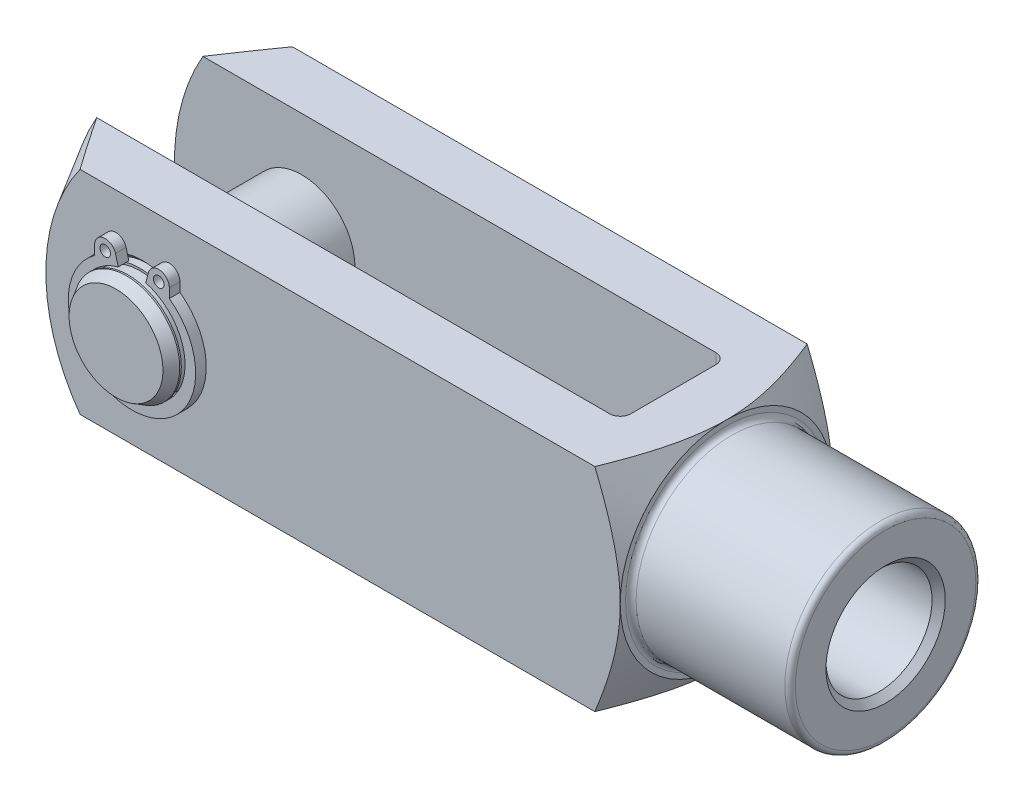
ISO-10303-21;
HEADER;
FILE_DESCRIPTION(('STEP AP214'),'2;1');
FILE_NAME('part.step','',(''),(''),'','','');
FILE_SCHEMA(('AUTOMOTIVE_DESIGN { 1 0 10303 214 1 1 1 1 }'));
ENDSEC;
DATA;
#1=APPLICATION_CONTEXT('core data for automotive mechanical design processes');
#2=APPLICATION_PROTOCOL_DEFINITION('international standard','automotive_design',2000,#1);
#3=PRODUCT_CONTEXT('',#1,'mechanical');
#4=PRODUCT('Part','Part','',(#3));
#5=PRODUCT_RELATED_PRODUCT_CATEGORY('part','',(#4));
#6=PRODUCT_DEFINITION_FORMATION('','',#4);
#7=PRODUCT_DEFINITION_CONTEXT('part definition',#1,'design');
#8=PRODUCT_DEFINITION('design','',#6,#7);
#9=PRODUCT_DEFINITION_SHAPE('','',#8);
#10=(LENGTH_UNIT() NAMED_UNIT(*) SI_UNIT(.MILLI.,.METRE.));
#11=(NAMED_UNIT(*) PLANE_ANGLE_UNIT() SI_UNIT($,.RADIAN.));
#12=(NAMED_UNIT(*) SI_UNIT($,.STERADIAN.) SOLID_ANGLE_UNIT());
#13=UNCERTAINTY_MEASURE_WITH_UNIT(LENGTH_MEASURE(1.E-05),#10,'distance_accuracy_value','');
#14=(GEOMETRIC_REPRESENTATION_CONTEXT(3) GLOBAL_UNCERTAINTY_ASSIGNED_CONTEXT((#13)) GLOBAL_UNIT_ASSIGNED_CONTEXT((#10,
#11,#12)) REPRESENTATION_CONTEXT('',''));
#15=CARTESIAN_POINT('',(0.,0.,0.));
#16=DIRECTION('',(0.,0.,1.));
#17=DIRECTION('',(1.,0.,0.));
#18=AXIS2_PLACEMENT_3D('',#15,#16,#17);
#19=CARTESIAN_POINT('',(-60.,0.,12.5));
#20=DIRECTION('',(0.,0.,-1.));
#21=DIRECTION('',(-1.,0.,0.));
#22=AXIS2_PLACEMENT_3D('',#19,#20,#21);
#23=CYLINDRICAL_SURFACE('',#22,5.);
#24=CARTESIAN_POINT('',(-60.,0.,10.25));
#25=DIRECTION('',(0.,0.,1.));
#26=DIRECTION('',(1.,0.,0.));
#27=AXIS2_PLACEMENT_3D('',#24,#25,#26);
#28=CIRCLE('',#27,5.);
#29=CARTESIAN_POINT('',(-55.,0.,10.25));
#30=VERTEX_POINT('',#29);
#31=EDGE_CURVE('P0_E55',#30,#30,#28,.T.);
#32=ORIENTED_EDGE('',*,*,#31,.F.);
#33=EDGE_LOOP('',(#32));
#34=FACE_BOUND('',#33,.T.);
#35=CARTESIAN_POINT('',(-60.,0.,-10.25));
#36=DIRECTION('',(0.,0.,1.));
#37=DIRECTION('',(1.,0.,0.));
#38=AXIS2_PLACEMENT_3D('',#35,#36,#37);
#39=CIRCLE('',#38,5.);
#40=CARTESIAN_POINT('',(-55.,0.,-10.25));
#41=VERTEX_POINT('',#40);
#42=EDGE_CURVE('P0_E40',#41,#41,#39,.T.);
#43=ORIENTED_EDGE('',*,*,#42,.T.);
#44=EDGE_LOOP('',(#43));
#45=FACE_BOUND('',#44,.T.);
#46=ADVANCED_FACE('P0_F14',(#34,#45),#23,.T.);
#47=CARTESIAN_POINT('',(-60.,0.,-11.35));
#48=DIRECTION('',(0.,0.,1.));
#49=DIRECTION('',(1.,0.,0.));
#50=AXIS2_PLACEMENT_3D('',#47,#48,#49);
#51=CIRCLE('',#50,5.);
#52=CARTESIAN_POINT('',(-55.,0.,-11.35));
#53=VERTEX_POINT('',#52);
#54=EDGE_CURVE('P0_E43',#53,#53,#51,.T.);
#55=ORIENTED_EDGE('',*,*,#54,.F.);
#56=EDGE_LOOP('',(#55));
#57=FACE_BOUND('',#56,.T.);
#58=CARTESIAN_POINT('',(-60.,0.,-11.5));
#59=DIRECTION('',(0.,0.,1.));
#60=DIRECTION('',(1.,0.,0.));
#61=AXIS2_PLACEMENT_3D('',#58,#59,#60);
#62=CIRCLE('',#61,5.);
#63=CARTESIAN_POINT('',(-55.,0.,-11.5));
#64=VERTEX_POINT('',#63);
#65=EDGE_CURVE('P0_E25',#64,#64,#62,.T.);
#66=ORIENTED_EDGE('',*,*,#65,.T.);
#67=EDGE_LOOP('',(#66));
#68=FACE_BOUND('',#67,.T.);
#69=ADVANCED_FACE('P0_F63',(#57,#68),#23,.T.);
#70=CARTESIAN_POINT('',(-60.,0.,-12.5));
#71=DIRECTION('',(0.,0.,1.));
#72=DIRECTION('',(1.,0.,0.));
#73=AXIS2_PLACEMENT_3D('',#70,#71,#72);
#74=PLANE('',#73);
#75=CARTESIAN_POINT('',(-60.,0.,-12.5));
#76=DIRECTION('',(0.,0.,1.));
#77=DIRECTION('',(1.,0.,0.));
#78=AXIS2_PLACEMENT_3D('',#75,#76,#77);
#79=CIRCLE('',#78,4.42264973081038);
#80=CARTESIAN_POINT('',(-55.5773502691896,0.,-12.5));
#81=VERTEX_POINT('',#80);
#82=EDGE_CURVE('P0_E21',#81,#81,#79,.F.);
#83=ORIENTED_EDGE('',*,*,#82,.T.);
#84=EDGE_LOOP('',(#83));
#85=FACE_BOUND('',#84,.T.);
#86=ADVANCED_FACE('P0_F89',(#85),#74,.F.);
#87=CARTESIAN_POINT('',(-60.,0.,-11.5));
#88=DIRECTION('',(0.,0.,1.));
#89=DIRECTION('',(1.,0.,0.));
#90=AXIS2_PLACEMENT_3D('',#87,#88,#89);
#91=CONICAL_SURFACE('',#90,5.,0.523598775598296);
#92=ORIENTED_EDGE('',*,*,#82,.F.);
#93=EDGE_LOOP('',(#92));
#94=FACE_BOUND('',#93,.T.);
#95=ORIENTED_EDGE('',*,*,#65,.F.);
#96=EDGE_LOOP('',(#95));
#97=FACE_BOUND('',#96,.T.);
#98=ADVANCED_FACE('P0_F83',(#94,#97),#91,.T.);
#99=CARTESIAN_POINT('',(-60.,5.,-11.35));
#100=DIRECTION('',(0.,0.,-1.));
#101=DIRECTION('',(-1.,0.,0.));
#102=AXIS2_PLACEMENT_3D('',#99,#100,#101);
#103=PLANE('',#102);
#104=CARTESIAN_POINT('',(-60.,0.,-11.35));
#105=DIRECTION('',(0.,0.,1.));
#106=DIRECTION('',(1.,0.,0.));
#107=AXIS2_PLACEMENT_3D('',#104,#105,#106);
#108=CIRCLE('',#107,4.8);
#109=CARTESIAN_POINT('',(-55.2,0.,-11.35));
#110=VERTEX_POINT('',#109);
#111=EDGE_CURVE('P0_E34',#110,#110,#108,.T.);
#112=ORIENTED_EDGE('',*,*,#111,.F.);
#113=EDGE_LOOP('',(#112));
#114=FACE_BOUND('',#113,.T.);
#115=ORIENTED_EDGE('',*,*,#54,.T.);
#116=EDGE_LOOP('',(#115));
#117=FACE_BOUND('',#116,.T.);
#118=ADVANCED_FACE('P0_F77',(#114,#117),#103,.F.);
#119=CARTESIAN_POINT('',(-60.,0.,11.5));
#120=DIRECTION('',(0.,0.,1.));
#121=DIRECTION('',(1.,0.,0.));
#122=AXIS2_PLACEMENT_3D('',#119,#120,#121);
#123=CYLINDRICAL_SURFACE('',#122,4.8);
#124=CARTESIAN_POINT('',(-60.,0.,-10.25));
#125=DIRECTION('',(0.,0.,1.));
#126=DIRECTION('',(1.,0.,0.));
#127=AXIS2_PLACEMENT_3D('',#124,#125,#126);
#128=CIRCLE('',#127,4.8);
#129=CARTESIAN_POINT('',(-55.2,0.,-10.25));
#130=VERTEX_POINT('',#129);
#131=EDGE_CURVE('P0_E37',#130,#130,#128,.T.);
#132=ORIENTED_EDGE('',*,*,#131,.F.);
#133=EDGE_LOOP('',(#132));
#134=FACE_BOUND('',#133,.T.);
#135=ORIENTED_EDGE('',*,*,#111,.T.);
#136=EDGE_LOOP('',(#135));
#137=FACE_BOUND('',#136,.T.);
#138=ADVANCED_FACE('P0_F71',(#134,#137),#123,.T.);
#139=CARTESIAN_POINT('',(-60.,5.,-10.25));
#140=DIRECTION('',(0.,0.,1.));
#141=DIRECTION('',(1.,0.,0.));
#142=AXIS2_PLACEMENT_3D('',#139,#140,#141);
#143=PLANE('',#142);
#144=ORIENTED_EDGE('',*,*,#42,.F.);
#145=EDGE_LOOP('',(#144));
#146=FACE_BOUND('',#145,.T.);
#147=ORIENTED_EDGE('',*,*,#131,.T.);
#148=EDGE_LOOP('',(#147));
#149=FACE_BOUND('',#148,.T.);
#150=ADVANCED_FACE('P0_F68',(#146,#149),#143,.F.);
#151=CARTESIAN_POINT('',(-60.,5.,10.25));
#152=DIRECTION('',(0.,0.,-1.));
#153=DIRECTION('',(-1.,0.,0.));
#154=AXIS2_PLACEMENT_3D('',#151,#152,#153);
#155=PLANE('',#154);
#156=CARTESIAN_POINT('',(-60.,0.,10.25));
#157=DIRECTION('',(0.,0.,1.));
#158=DIRECTION('',(1.,0.,0.));
#159=AXIS2_PLACEMENT_3D('',#156,#157,#158);
#160=CIRCLE('',#159,4.8);
#161=CARTESIAN_POINT('',(-55.2,0.,10.25));
#162=VERTEX_POINT('',#161);
#163=EDGE_CURVE('P0_E46',#162,#162,#160,.T.);
#164=ORIENTED_EDGE('',*,*,#163,.F.);
#165=EDGE_LOOP('',(#164));
#166=FACE_BOUND('',#165,.T.);
#167=ORIENTED_EDGE('',*,*,#31,.T.);
#168=EDGE_LOOP('',(#167));
#169=FACE_BOUND('',#168,.T.);
#170=ADVANCED_FACE('P0_F59',(#166,#169),#155,.F.);
#171=CARTESIAN_POINT('',(-60.,0.,11.5));
#172=DIRECTION('',(0.,0.,1.));
#173=DIRECTION('',(1.,0.,0.));
#174=AXIS2_PLACEMENT_3D('',#171,#172,#173);
#175=CYLINDRICAL_SURFACE('',#174,4.8);
#176=CARTESIAN_POINT('',(-60.,0.,11.35));
#177=DIRECTION('',(0.,0.,1.));
#178=DIRECTION('',(1.,0.,0.));
#179=AXIS2_PLACEMENT_3D('',#176,#177,#178);
#180=CIRCLE('',#179,4.8);
#181=CARTESIAN_POINT('',(-55.2,0.,11.35));
#182=VERTEX_POINT('',#181);
#183=EDGE_CURVE('P0_E49',#182,#182,#180,.T.);
#184=ORIENTED_EDGE('',*,*,#183,.F.);
#185=EDGE_LOOP('',(#184));
#186=FACE_BOUND('',#185,.T.);
#187=ORIENTED_EDGE('',*,*,#163,.T.);
#188=EDGE_LOOP('',(#187));
#189=FACE_BOUND('',#188,.T.);
#190=ADVANCED_FACE('P0_F108',(#186,#189),#175,.T.);
#191=CARTESIAN_POINT('',(-60.,5.,11.35));
#192=DIRECTION('',(0.,0.,1.));
#193=DIRECTION('',(1.,0.,0.));
#194=AXIS2_PLACEMENT_3D('',#191,#192,#193);
#195=PLANE('',#194);
#196=CARTESIAN_POINT('',(-60.,0.,11.35));
#197=DIRECTION('',(0.,0.,1.));
#198=DIRECTION('',(1.,0.,0.));
#199=AXIS2_PLACEMENT_3D('',#196,#197,#198);
#200=CIRCLE('',#199,5.);
#201=CARTESIAN_POINT('',(-55.,0.,11.35));
#202=VERTEX_POINT('',#201);
#203=EDGE_CURVE('P0_E52',#202,#202,#200,.T.);
#204=ORIENTED_EDGE('',*,*,#203,.F.);
#205=EDGE_LOOP('',(#204));
#206=FACE_BOUND('',#205,.T.);
#207=ORIENTED_EDGE('',*,*,#183,.T.);
#208=EDGE_LOOP('',(#207));
#209=FACE_BOUND('',#208,.T.);
#210=ADVANCED_FACE('P0_F104',(#206,#209),#195,.F.);
#211=CARTESIAN_POINT('',(-60.,0.,12.5));
#212=DIRECTION('',(0.,0.,1.));
#213=DIRECTION('',(1.,0.,0.));
#214=AXIS2_PLACEMENT_3D('',#211,#212,#213);
#215=PLANE('',#214);
#216=CARTESIAN_POINT('',(-60.,0.,12.5));
#217=DIRECTION('',(0.,0.,1.));
#218=DIRECTION('',(1.,0.,0.));
#219=AXIS2_PLACEMENT_3D('',#216,#217,#218);
#220=CIRCLE('',#219,4.42264973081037);
#221=CARTESIAN_POINT('',(-55.5773502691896,0.,12.5));
#222=VERTEX_POINT('',#221);
#223=EDGE_CURVE('P0_E10',#222,#222,#220,.T.);
#224=ORIENTED_EDGE('',*,*,#223,.T.);
#225=EDGE_LOOP('',(#224));
#226=FACE_BOUND('',#225,.T.);
#227=ADVANCED_FACE('P0_F102',(#226),#215,.T.);
#228=CARTESIAN_POINT('',(-60.,0.,12.5));
#229=DIRECTION('',(0.,0.,-1.));
#230=DIRECTION('',(-1.,0.,0.));
#231=AXIS2_PLACEMENT_3D('',#228,#229,#230);
#232=CONICAL_SURFACE('',#231,4.42264973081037,0.523598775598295);
#233=CARTESIAN_POINT('',(-60.,0.,11.5));
#234=DIRECTION('',(0.,0.,1.));
#235=DIRECTION('',(1.,0.,0.));
#236=AXIS2_PLACEMENT_3D('',#233,#234,#235);
#237=CIRCLE('',#236,5.);
#238=CARTESIAN_POINT('',(-55.,0.,11.5));
#239=VERTEX_POINT('',#238);
#240=EDGE_CURVE('P0_E29',#239,#239,#237,.F.);
#241=ORIENTED_EDGE('',*,*,#240,.F.);
#242=EDGE_LOOP('',(#241));
#243=FACE_BOUND('',#242,.T.);
#244=ORIENTED_EDGE('',*,*,#223,.F.);
#245=EDGE_LOOP('',(#244));
#246=FACE_BOUND('',#245,.T.);
#247=ADVANCED_FACE('P0_F16',(#243,#246),#232,.T.);
#248=ORIENTED_EDGE('',*,*,#203,.T.);
#249=EDGE_LOOP('',(#248));
#250=FACE_BOUND('',#249,.T.);
#251=ORIENTED_EDGE('',*,*,#240,.T.);
#252=EDGE_LOOP('',(#251));
#253=FACE_BOUND('',#252,.T.);
#254=ADVANCED_FACE('P0_F65',(#250,#253),#23,.T.);
#255=CLOSED_SHELL('',(#46,#69,#86,#98,#118,#138,#150,#170,#190,#210,#227,#247,#254));
#256=MANIFOLD_SOLID_BREP('P0_B1',#255);
#257=CARTESIAN_POINT('',(-60.,0.,10.9999999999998));
#258=DIRECTION('',(0.,0.,1.));
#259=DIRECTION('',(1.,0.,0.));
#260=AXIS2_PLACEMENT_3D('',#257,#258,#259);
#261=PLANE('',#260);
#262=CARTESIAN_POINT('',(-62.5188400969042,5.5367359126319,10.9999999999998));
#263=DIRECTION('',(0.,0.,1.));
#264=DIRECTION('',(1.,0.,0.));
#265=AXIS2_PLACEMENT_3D('',#262,#263,#264);
#266=CIRCLE('',#265,0.5);
#267=CARTESIAN_POINT('',(-62.0188400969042,5.5367359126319,10.9999999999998));
#268=VERTEX_POINT('',#267);
#269=EDGE_CURVE('P1_E117',#268,#268,#266,.T.);
#270=ORIENTED_EDGE('',*,*,#269,.F.);
#271=EDGE_LOOP('',(#270));
#272=FACE_BOUND('',#271,.T.);
#273=CARTESIAN_POINT('',(-60.,0.,10.9999999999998));
#274=DIRECTION('',(0.,0.,-1.));
#275=DIRECTION('',(1.,0.,0.));
#276=AXIS2_PLACEMENT_3D('',#273,#274,#275);
#277=CIRCLE('',#276,5.);
#278=CARTESIAN_POINT('',(-58.7059047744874,4.82962913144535,10.9999999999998));
#279=VERTEX_POINT('',#278);
#280=CARTESIAN_POINT('',(-61.2940952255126,4.82962913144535,10.9999999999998));
#281=VERTEX_POINT('',#280);
#282=EDGE_CURVE('P1_E128',#279,#281,#277,.T.);
#283=ORIENTED_EDGE('',*,*,#282,.T.);
#284=DIRECTION('',(-0.258819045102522,0.965925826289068,0.));
#285=VECTOR('',#284,1.);
#286=CARTESIAN_POINT('',(-61.2940952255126,4.82962913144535,10.9999999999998));
#287=LINE('',#286,#285);
#288=CARTESIAN_POINT('',(-61.5529142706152,5.79555495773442,10.9999999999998));
#289=VERTEX_POINT('',#288);
#290=EDGE_CURVE('P1_E76',#281,#289,#287,.T.);
#291=ORIENTED_EDGE('',*,*,#290,.T.);
#292=CARTESIAN_POINT('',(-62.5188400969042,5.5367359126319,10.9999999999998));
#293=DIRECTION('',(0.,0.,1.));
#294=DIRECTION('',(1.,0.,0.));
#295=AXIS2_PLACEMENT_3D('',#292,#293,#294);
#296=CIRCLE('',#295,0.999999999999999);
#297=CARTESIAN_POINT('',(-63.5188400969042,5.5367359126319,10.9999999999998));
#298=VERTEX_POINT('',#297);
#299=EDGE_CURVE('P1_E143',#289,#298,#296,.T.);
#300=ORIENTED_EDGE('',*,*,#299,.T.);
#301=DIRECTION('',(0.,-1.,0.));
#302=VECTOR('',#301,1.);
#303=CARTESIAN_POINT('',(-63.5188400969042,5.5367359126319,10.9999999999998));
#304=LINE('',#303,#302);
#305=CARTESIAN_POINT('',(-63.5188400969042,4.65981114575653,10.9999999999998));
#306=VERTEX_POINT('',#305);
#307=EDGE_CURVE('P1_E156',#298,#306,#304,.T.);
#308=ORIENTED_EDGE('',*,*,#307,.T.);
#309=CARTESIAN_POINT('',(-60.,-0.199999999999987,10.9999999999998));
#310=DIRECTION('',(0.,0.,1.));
#311=DIRECTION('',(1.,0.,0.));
#312=AXIS2_PLACEMENT_3D('',#309,#310,#311);
#313=CIRCLE('',#312,6.);
#314=CARTESIAN_POINT('',(-56.4811599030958,4.65981114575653,10.9999999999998));
#315=VERTEX_POINT('',#314);
#316=EDGE_CURVE('P1_E95',#306,#315,#313,.T.);
#317=ORIENTED_EDGE('',*,*,#316,.T.);
#318=DIRECTION('',(0.,1.,0.));
#319=VECTOR('',#318,1.);
#320=CARTESIAN_POINT('',(-56.4811599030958,5.5367359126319,10.9999999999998));
#321=LINE('',#320,#319);
#322=CARTESIAN_POINT('',(-56.4811599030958,5.5367359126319,10.9999999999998));
#323=VERTEX_POINT('',#322);
#324=EDGE_CURVE('P1_E89',#315,#323,#321,.T.);
#325=ORIENTED_EDGE('',*,*,#324,.T.);
#326=CARTESIAN_POINT('',(-57.4811599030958,5.5367359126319,10.9999999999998));
#327=DIRECTION('',(0.,0.,1.));
#328=DIRECTION('',(-1.,0.,0.));
#329=AXIS2_PLACEMENT_3D('',#326,#327,#328);
#330=CIRCLE('',#329,0.999999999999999);
#331=CARTESIAN_POINT('',(-58.4470857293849,5.79555495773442,10.9999999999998));
#332=VERTEX_POINT('',#331);
#333=EDGE_CURVE('P1_E93',#323,#332,#330,.T.);
#334=ORIENTED_EDGE('',*,*,#333,.T.);
#335=DIRECTION('',(-0.258819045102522,-0.965925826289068,0.));
#336=VECTOR('',#335,1.);
#337=CARTESIAN_POINT('',(-58.7059047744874,4.82962913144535,10.9999999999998));
#338=LINE('',#337,#336);
#339=EDGE_CURVE('P1_E33',#332,#279,#338,.T.);
#340=ORIENTED_EDGE('',*,*,#339,.T.);
#341=EDGE_LOOP('',(#283,#291,#300,#308,#317,#325,#334,#340));
#342=FACE_BOUND('',#341,.T.);
#343=CARTESIAN_POINT('',(-57.4811599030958,5.5367359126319,10.9999999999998));
#344=DIRECTION('',(0.,0.,1.));
#345=DIRECTION('',(-1.,0.,0.));
#346=AXIS2_PLACEMENT_3D('',#343,#344,#345);
#347=CIRCLE('',#346,0.5);
#348=CARTESIAN_POINT('',(-57.9811599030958,5.5367359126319,10.9999999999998));
#349=VERTEX_POINT('',#348);
#350=EDGE_CURVE('P1_E165',#349,#349,#347,.T.);
#351=ORIENTED_EDGE('',*,*,#350,.F.);
#352=EDGE_LOOP('',(#351));
#353=FACE_BOUND('',#352,.T.);
#354=ADVANCED_FACE('P1_F16',(#272,#342,#353),#261,.T.);
#355=CARTESIAN_POINT('',(-60.,0.,9.99999999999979));
#356=DIRECTION('',(0.,0.,1.));
#357=DIRECTION('',(1.,0.,0.));
#358=AXIS2_PLACEMENT_3D('',#355,#356,#357);
#359=PLANE('',#358);
#360=CARTESIAN_POINT('',(-62.5188400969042,5.5367359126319,9.99999999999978));
#361=DIRECTION('',(0.,0.,1.));
#362=DIRECTION('',(1.,0.,0.));
#363=AXIS2_PLACEMENT_3D('',#360,#361,#362);
#364=CIRCLE('',#363,0.5);
#365=CARTESIAN_POINT('',(-62.0188400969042,5.5367359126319,9.99999999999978));
#366=VERTEX_POINT('',#365);
#367=EDGE_CURVE('P1_E162',#366,#366,#364,.T.);
#368=ORIENTED_EDGE('',*,*,#367,.T.);
#369=EDGE_LOOP('',(#368));
#370=FACE_BOUND('',#369,.T.);
#371=CARTESIAN_POINT('',(-60.,0.,9.99999999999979));
#372=DIRECTION('',(0.,0.,-1.));
#373=DIRECTION('',(1.,0.,0.));
#374=AXIS2_PLACEMENT_3D('',#371,#372,#373);
#375=CIRCLE('',#374,5.);
#376=CARTESIAN_POINT('',(-58.7059047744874,4.82962913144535,9.99999999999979));
#377=VERTEX_POINT('',#376);
#378=CARTESIAN_POINT('',(-61.2940952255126,4.82962913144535,9.99999999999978));
#379=VERTEX_POINT('',#378);
#380=EDGE_CURVE('P1_E113',#377,#379,#375,.T.);
#381=ORIENTED_EDGE('',*,*,#380,.F.);
#382=DIRECTION('',(-0.258819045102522,-0.965925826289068,0.));
#383=VECTOR('',#382,1.);
#384=CARTESIAN_POINT('',(-58.7059047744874,4.82962913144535,9.99999999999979));
#385=LINE('',#384,#383);
#386=CARTESIAN_POINT('',(-58.4470857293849,5.79555495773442,9.99999999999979));
#387=VERTEX_POINT('',#386);
#388=EDGE_CURVE('P1_E68',#387,#377,#385,.T.);
#389=ORIENTED_EDGE('',*,*,#388,.F.);
#390=CARTESIAN_POINT('',(-57.4811599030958,5.5367359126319,9.9999999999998));
#391=DIRECTION('',(0.,0.,1.));
#392=DIRECTION('',(-1.,0.,0.));
#393=AXIS2_PLACEMENT_3D('',#390,#391,#392);
#394=CIRCLE('',#393,0.999999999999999);
#395=CARTESIAN_POINT('',(-56.4811599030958,5.5367359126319,9.9999999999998));
#396=VERTEX_POINT('',#395);
#397=EDGE_CURVE('P1_E62',#396,#387,#394,.T.);
#398=ORIENTED_EDGE('',*,*,#397,.F.);
#399=DIRECTION('',(0.,1.,0.));
#400=VECTOR('',#399,1.);
#401=CARTESIAN_POINT('',(-56.4811599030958,5.5367359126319,9.9999999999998));
#402=LINE('',#401,#400);
#403=CARTESIAN_POINT('',(-56.4811599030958,4.65981114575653,9.9999999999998));
#404=VERTEX_POINT('',#403);
#405=EDGE_CURVE('P1_E103',#404,#396,#402,.T.);
#406=ORIENTED_EDGE('',*,*,#405,.F.);
#407=CARTESIAN_POINT('',(-60.,-0.199999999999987,9.99999999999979));
#408=DIRECTION('',(0.,0.,1.));
#409=DIRECTION('',(1.,0.,0.));
#410=AXIS2_PLACEMENT_3D('',#407,#408,#409);
#411=CIRCLE('',#410,6.);
#412=CARTESIAN_POINT('',(-63.5188400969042,4.65981114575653,9.99999999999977));
#413=VERTEX_POINT('',#412);
#414=EDGE_CURVE('P1_E123',#413,#404,#411,.T.);
#415=ORIENTED_EDGE('',*,*,#414,.F.);
#416=DIRECTION('',(0.,-1.,0.));
#417=VECTOR('',#416,1.);
#418=CARTESIAN_POINT('',(-63.5188400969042,5.5367359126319,9.99999999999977));
#419=LINE('',#418,#417);
#420=CARTESIAN_POINT('',(-63.5188400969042,5.5367359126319,9.99999999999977));
#421=VERTEX_POINT('',#420);
#422=EDGE_CURVE('P1_E121',#421,#413,#419,.T.);
#423=ORIENTED_EDGE('',*,*,#422,.F.);
#424=CARTESIAN_POINT('',(-62.5188400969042,5.5367359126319,9.99999999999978));
#425=DIRECTION('',(0.,0.,1.));
#426=DIRECTION('',(1.,0.,0.));
#427=AXIS2_PLACEMENT_3D('',#424,#425,#426);
#428=CIRCLE('',#427,0.999999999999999);
#429=CARTESIAN_POINT('',(-61.5529142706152,5.79555495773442,9.99999999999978));
#430=VERTEX_POINT('',#429);
#431=EDGE_CURVE('P1_E119',#430,#421,#428,.T.);
#432=ORIENTED_EDGE('',*,*,#431,.F.);
#433=DIRECTION('',(-0.258819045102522,0.965925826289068,0.));
#434=VECTOR('',#433,1.);
#435=CARTESIAN_POINT('',(-61.2940952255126,4.82962913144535,9.99999999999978));
#436=LINE('',#435,#434);
#437=EDGE_CURVE('P1_E116',#379,#430,#436,.T.);
#438=ORIENTED_EDGE('',*,*,#437,.F.);
#439=EDGE_LOOP('',(#381,#389,#398,#406,#415,#423,#432,#438));
#440=FACE_BOUND('',#439,.T.);
#441=CARTESIAN_POINT('',(-57.4811599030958,5.5367359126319,9.9999999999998));
#442=DIRECTION('',(0.,0.,1.));
#443=DIRECTION('',(-1.,0.,0.));
#444=AXIS2_PLACEMENT_3D('',#441,#442,#443);
#445=CIRCLE('',#444,0.5);
#446=CARTESIAN_POINT('',(-57.9811599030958,5.5367359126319,9.99999999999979));
#447=VERTEX_POINT('',#446);
#448=EDGE_CURVE('P1_E168',#447,#447,#445,.T.);
#449=ORIENTED_EDGE('',*,*,#448,.T.);
#450=EDGE_LOOP('',(#449));
#451=FACE_BOUND('',#450,.T.);
#452=ADVANCED_FACE('P1_F147',(#370,#440,#451),#359,.F.);
#453=CARTESIAN_POINT('',(-60.,0.,10.9999999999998));
#454=DIRECTION('',(0.,0.,-1.));
#455=DIRECTION('',(-1.,0.,0.));
#456=AXIS2_PLACEMENT_3D('',#453,#454,#455);
#457=CYLINDRICAL_SURFACE('',#456,5.);
#458=ORIENTED_EDGE('',*,*,#380,.T.);
#459=DIRECTION('',(0.,0.,-1.));
#460=VECTOR('',#459,1.);
#461=CARTESIAN_POINT('',(-61.2940952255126,4.82962913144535,10.9999999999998));
#462=LINE('',#461,#460);
#463=EDGE_CURVE('P1_E11',#281,#379,#462,.T.);
#464=ORIENTED_EDGE('',*,*,#463,.F.);
#465=ORIENTED_EDGE('',*,*,#282,.F.);
#466=DIRECTION('',(0.,0.,-1.));
#467=VECTOR('',#466,1.);
#468=CARTESIAN_POINT('',(-58.7059047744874,4.82962913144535,10.9999999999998));
#469=LINE('',#468,#467);
#470=EDGE_CURVE('P1_E109',#279,#377,#469,.T.);
#471=ORIENTED_EDGE('',*,*,#470,.T.);
#472=EDGE_LOOP('',(#458,#464,#465,#471));
#473=FACE_BOUND('',#472,.T.);
#474=ADVANCED_FACE('P1_F18',(#473),#457,.F.);
#475=CARTESIAN_POINT('',(-61.2940952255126,4.82962913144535,10.9999999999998));
#476=DIRECTION('',(-0.965925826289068,-0.258819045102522,0.));
#477=DIRECTION('',(0.258819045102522,-0.965925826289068,0.));
#478=AXIS2_PLACEMENT_3D('',#475,#476,#477);
#479=PLANE('',#478);
#480=ORIENTED_EDGE('',*,*,#437,.T.);
#481=DIRECTION('',(0.,0.,-1.));
#482=VECTOR('',#481,1.);
#483=CARTESIAN_POINT('',(-61.5529142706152,5.79555495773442,10.9999999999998));
#484=LINE('',#483,#482);
#485=EDGE_CURVE('P1_E25',#289,#430,#484,.T.);
#486=ORIENTED_EDGE('',*,*,#485,.F.);
#487=ORIENTED_EDGE('',*,*,#290,.F.);
#488=ORIENTED_EDGE('',*,*,#463,.T.);
#489=EDGE_LOOP('',(#480,#486,#487,#488));
#490=FACE_BOUND('',#489,.T.);
#491=ADVANCED_FACE('P1_F202',(#490),#479,.F.);
#492=CARTESIAN_POINT('',(-62.5188400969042,5.5367359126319,10.9999999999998));
#493=DIRECTION('',(0.,0.,-1.));
#494=DIRECTION('',(-1.,0.,0.));
#495=AXIS2_PLACEMENT_3D('',#492,#493,#494);
#496=CYLINDRICAL_SURFACE('',#495,0.999999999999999);
#497=ORIENTED_EDGE('',*,*,#431,.T.);
#498=DIRECTION('',(0.,0.,-1.));
#499=VECTOR('',#498,1.);
#500=CARTESIAN_POINT('',(-63.5188400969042,5.5367359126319,10.9999999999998));
#501=LINE('',#500,#499);
#502=EDGE_CURVE('P1_E135',#298,#421,#501,.T.);
#503=ORIENTED_EDGE('',*,*,#502,.F.);
#504=ORIENTED_EDGE('',*,*,#299,.F.);
#505=ORIENTED_EDGE('',*,*,#485,.T.);
#506=EDGE_LOOP('',(#497,#503,#504,#505));
#507=FACE_BOUND('',#506,.T.);
#508=ADVANCED_FACE('P1_F141',(#507),#496,.T.);
#509=CARTESIAN_POINT('',(-63.5188400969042,5.5367359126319,10.9999999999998));
#510=DIRECTION('',(1.,0.,0.));
#511=DIRECTION('',(0.,1.,0.));
#512=AXIS2_PLACEMENT_3D('',#509,#510,#511);
#513=PLANE('',#512);
#514=ORIENTED_EDGE('',*,*,#422,.T.);
#515=DIRECTION('',(0.,0.,-1.));
#516=VECTOR('',#515,1.);
#517=CARTESIAN_POINT('',(-63.5188400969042,4.65981114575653,10.9999999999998));
#518=LINE('',#517,#516);
#519=EDGE_CURVE('P1_E132',#306,#413,#518,.T.);
#520=ORIENTED_EDGE('',*,*,#519,.F.);
#521=ORIENTED_EDGE('',*,*,#307,.F.);
#522=ORIENTED_EDGE('',*,*,#502,.T.);
#523=EDGE_LOOP('',(#514,#520,#521,#522));
#524=FACE_BOUND('',#523,.T.);
#525=ADVANCED_FACE('P1_F152',(#524),#513,.F.);
#526=CARTESIAN_POINT('',(-60.,-0.199999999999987,10.9999999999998));
#527=DIRECTION('',(0.,0.,-1.));
#528=DIRECTION('',(-1.,0.,0.));
#529=AXIS2_PLACEMENT_3D('',#526,#527,#528);
#530=CYLINDRICAL_SURFACE('',#529,6.);
#531=ORIENTED_EDGE('',*,*,#414,.T.);
#532=DIRECTION('',(0.,0.,-1.));
#533=VECTOR('',#532,1.);
#534=CARTESIAN_POINT('',(-56.4811599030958,4.65981114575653,10.9999999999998));
#535=LINE('',#534,#533);
#536=EDGE_CURVE('P1_E104',#315,#404,#535,.T.);
#537=ORIENTED_EDGE('',*,*,#536,.F.);
#538=ORIENTED_EDGE('',*,*,#316,.F.);
#539=ORIENTED_EDGE('',*,*,#519,.T.);
#540=EDGE_LOOP('',(#531,#537,#538,#539));
#541=FACE_BOUND('',#540,.T.);
#542=ADVANCED_FACE('P1_F155',(#541),#530,.T.);
#543=CARTESIAN_POINT('',(-56.4811599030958,5.5367359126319,10.9999999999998));
#544=DIRECTION('',(-1.,0.,0.));
#545=DIRECTION('',(0.,-1.,0.));
#546=AXIS2_PLACEMENT_3D('',#543,#544,#545);
#547=PLANE('',#546);
#548=ORIENTED_EDGE('',*,*,#405,.T.);
#549=DIRECTION('',(0.,0.,-1.));
#550=VECTOR('',#549,1.);
#551=CARTESIAN_POINT('',(-56.4811599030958,5.5367359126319,10.9999999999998));
#552=LINE('',#551,#550);
#553=EDGE_CURVE('P1_E100',#323,#396,#552,.T.);
#554=ORIENTED_EDGE('',*,*,#553,.F.);
#555=ORIENTED_EDGE('',*,*,#324,.F.);
#556=ORIENTED_EDGE('',*,*,#536,.T.);
#557=EDGE_LOOP('',(#548,#554,#555,#556));
#558=FACE_BOUND('',#557,.T.);
#559=ADVANCED_FACE('P1_F101',(#558),#547,.F.);
#560=CARTESIAN_POINT('',(-57.4811599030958,5.5367359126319,10.9999999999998));
#561=DIRECTION('',(0.,0.,-1.));
#562=DIRECTION('',(-1.,0.,0.));
#563=AXIS2_PLACEMENT_3D('',#560,#561,#562);
#564=CYLINDRICAL_SURFACE('',#563,0.999999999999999);
#565=ORIENTED_EDGE('',*,*,#397,.T.);
#566=DIRECTION('',(0.,0.,-1.));
#567=VECTOR('',#566,1.);
#568=CARTESIAN_POINT('',(-58.4470857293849,5.79555495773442,10.9999999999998));
#569=LINE('',#568,#567);
#570=EDGE_CURVE('P1_E105',#332,#387,#569,.T.);
#571=ORIENTED_EDGE('',*,*,#570,.F.);
#572=ORIENTED_EDGE('',*,*,#333,.F.);
#573=ORIENTED_EDGE('',*,*,#553,.T.);
#574=EDGE_LOOP('',(#565,#571,#572,#573));
#575=FACE_BOUND('',#574,.T.);
#576=ADVANCED_FACE('P1_F107',(#575),#564,.T.);
#577=CARTESIAN_POINT('',(-58.7059047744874,4.82962913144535,10.9999999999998));
#578=DIRECTION('',(0.965925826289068,-0.258819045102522,0.));
#579=DIRECTION('',(0.258819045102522,0.965925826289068,0.));
#580=AXIS2_PLACEMENT_3D('',#577,#578,#579);
#581=PLANE('',#580);
#582=ORIENTED_EDGE('',*,*,#388,.T.);
#583=ORIENTED_EDGE('',*,*,#470,.F.);
#584=ORIENTED_EDGE('',*,*,#339,.F.);
#585=ORIENTED_EDGE('',*,*,#570,.T.);
#586=EDGE_LOOP('',(#582,#583,#584,#585));
#587=FACE_BOUND('',#586,.T.);
#588=ADVANCED_FACE('P1_F190',(#587),#581,.F.);
#589=CARTESIAN_POINT('',(-62.5188400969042,5.5367359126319,10.9999999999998));
#590=DIRECTION('',(0.,0.,-1.));
#591=DIRECTION('',(-1.,0.,0.));
#592=AXIS2_PLACEMENT_3D('',#589,#590,#591);
#593=CYLINDRICAL_SURFACE('',#592,0.5);
#594=ORIENTED_EDGE('',*,*,#269,.T.);
#595=EDGE_LOOP('',(#594));
#596=FACE_BOUND('',#595,.T.);
#597=ORIENTED_EDGE('',*,*,#367,.F.);
#598=EDGE_LOOP('',(#597));
#599=FACE_BOUND('',#598,.T.);
#600=ADVANCED_FACE('P1_F187',(#596,#599),#593,.F.);
#601=CARTESIAN_POINT('',(-57.4811599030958,5.5367359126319,10.9999999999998));
#602=DIRECTION('',(0.,0.,-1.));
#603=DIRECTION('',(-1.,0.,0.));
#604=AXIS2_PLACEMENT_3D('',#601,#602,#603);
#605=CYLINDRICAL_SURFACE('',#604,0.5);
#606=ORIENTED_EDGE('',*,*,#350,.T.);
#607=EDGE_LOOP('',(#606));
#608=FACE_BOUND('',#607,.T.);
#609=ORIENTED_EDGE('',*,*,#448,.F.);
#610=EDGE_LOOP('',(#609));
#611=FACE_BOUND('',#610,.T.);
#612=ADVANCED_FACE('P1_F174',(#608,#611),#605,.F.);
#613=CLOSED_SHELL('',(#354,#452,#474,#491,#508,#525,#542,#559,#576,#588,#600,#612));
#614=MANIFOLD_SOLID_BREP('P1_B1',#613);
#615=CARTESIAN_POINT('',(-60.,0.,-10.9999999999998));
#616=DIRECTION('',(0.,0.,-1.));
#617=DIRECTION('',(-1.,0.,0.));
#618=AXIS2_PLACEMENT_3D('',#615,#616,#617);
#619=PLANE('',#618);
#620=CARTESIAN_POINT('',(-57.4811599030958,5.53673591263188,-10.9999999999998));
#621=DIRECTION('',(0.,0.,-1.));
#622=DIRECTION('',(-1.,0.,0.));
#623=AXIS2_PLACEMENT_3D('',#620,#621,#622);
#624=CIRCLE('',#623,0.5);
#625=CARTESIAN_POINT('',(-57.9811599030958,5.53673591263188,-10.9999999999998));
#626=VERTEX_POINT('',#625);
#627=EDGE_CURVE('P2_E117',#626,#626,#624,.T.);
#628=ORIENTED_EDGE('',*,*,#627,.F.);
#629=EDGE_LOOP('',(#628));
#630=FACE_BOUND('',#629,.T.);
#631=CARTESIAN_POINT('',(-60.,0.,-10.9999999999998));
#632=DIRECTION('',(0.,0.,1.));
#633=DIRECTION('',(-1.,0.,0.));
#634=AXIS2_PLACEMENT_3D('',#631,#632,#633);
#635=CIRCLE('',#634,5.);
#636=CARTESIAN_POINT('',(-61.2940952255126,4.82962913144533,-10.9999999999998));
#637=VERTEX_POINT('',#636);
#638=CARTESIAN_POINT('',(-58.7059047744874,4.82962913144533,-10.9999999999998));
#639=VERTEX_POINT('',#638);
#640=EDGE_CURVE('P2_E128',#637,#639,#635,.T.);
#641=ORIENTED_EDGE('',*,*,#640,.T.);
#642=DIRECTION('',(0.258819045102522,0.965925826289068,0.));
#643=VECTOR('',#642,1.);
#644=CARTESIAN_POINT('',(-58.7059047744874,4.82962913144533,-10.9999999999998));
#645=LINE('',#644,#643);
#646=CARTESIAN_POINT('',(-58.4470857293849,5.7955549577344,-10.9999999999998));
#647=VERTEX_POINT('',#646);
#648=EDGE_CURVE('P2_E76',#639,#647,#645,.T.);
#649=ORIENTED_EDGE('',*,*,#648,.T.);
#650=CARTESIAN_POINT('',(-57.4811599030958,5.53673591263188,-10.9999999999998));
#651=DIRECTION('',(0.,0.,-1.));
#652=DIRECTION('',(-1.,0.,0.));
#653=AXIS2_PLACEMENT_3D('',#650,#651,#652);
#654=CIRCLE('',#653,0.999999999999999);
#655=CARTESIAN_POINT('',(-56.4811599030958,5.53673591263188,-10.9999999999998));
#656=VERTEX_POINT('',#655);
#657=EDGE_CURVE('P2_E143',#647,#656,#654,.T.);
#658=ORIENTED_EDGE('',*,*,#657,.T.);
#659=DIRECTION('',(0.,-1.,0.));
#660=VECTOR('',#659,1.);
#661=CARTESIAN_POINT('',(-56.4811599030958,5.53673591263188,-10.9999999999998));
#662=LINE('',#661,#660);
#663=CARTESIAN_POINT('',(-56.4811599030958,4.65981114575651,-10.9999999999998));
#664=VERTEX_POINT('',#663);
#665=EDGE_CURVE('P2_E156',#656,#664,#662,.T.);
#666=ORIENTED_EDGE('',*,*,#665,.T.);
#667=CARTESIAN_POINT('',(-60.,-0.200000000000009,-10.9999999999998));
#668=DIRECTION('',(0.,0.,-1.));
#669=DIRECTION('',(-1.,0.,0.));
#670=AXIS2_PLACEMENT_3D('',#667,#668,#669);
#671=CIRCLE('',#670,6.);
#672=CARTESIAN_POINT('',(-63.5188400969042,4.65981114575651,-10.9999999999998));
#673=VERTEX_POINT('',#672);
#674=EDGE_CURVE('P2_E95',#664,#673,#671,.T.);
#675=ORIENTED_EDGE('',*,*,#674,.T.);
#676=DIRECTION('',(0.,1.,0.));
#677=VECTOR('',#676,1.);
#678=CARTESIAN_POINT('',(-63.5188400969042,5.53673591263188,-10.9999999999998));
#679=LINE('',#678,#677);
#680=CARTESIAN_POINT('',(-63.5188400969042,5.53673591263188,-10.9999999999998));
#681=VERTEX_POINT('',#680);
#682=EDGE_CURVE('P2_E89',#673,#681,#679,.T.);
#683=ORIENTED_EDGE('',*,*,#682,.T.);
#684=CARTESIAN_POINT('',(-62.5188400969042,5.53673591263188,-10.9999999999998));
#685=DIRECTION('',(0.,0.,-1.));
#686=DIRECTION('',(1.,0.,0.));
#687=AXIS2_PLACEMENT_3D('',#684,#685,#686);
#688=CIRCLE('',#687,0.999999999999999);
#689=CARTESIAN_POINT('',(-61.5529142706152,5.7955549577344,-10.9999999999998));
#690=VERTEX_POINT('',#689);
#691=EDGE_CURVE('P2_E93',#681,#690,#688,.T.);
#692=ORIENTED_EDGE('',*,*,#691,.T.);
#693=DIRECTION('',(0.258819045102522,-0.965925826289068,0.));
#694=VECTOR('',#693,1.);
#695=CARTESIAN_POINT('',(-61.2940952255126,4.82962913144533,-10.9999999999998));
#696=LINE('',#695,#694);
#697=EDGE_CURVE('P2_E33',#690,#637,#696,.T.);
#698=ORIENTED_EDGE('',*,*,#697,.T.);
#699=EDGE_LOOP('',(#641,#649,#658,#666,#675,#683,#692,#698));
#700=FACE_BOUND('',#699,.T.);
#701=CARTESIAN_POINT('',(-62.5188400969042,5.53673591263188,-10.9999999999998));
#702=DIRECTION('',(0.,0.,-1.));
#703=DIRECTION('',(1.,0.,0.));
#704=AXIS2_PLACEMENT_3D('',#701,#702,#703);
#705=CIRCLE('',#704,0.5);
#706=CARTESIAN_POINT('',(-62.0188400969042,5.53673591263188,-10.9999999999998));
#707=VERTEX_POINT('',#706);
#708=EDGE_CURVE('P2_E165',#707,#707,#705,.T.);
#709=ORIENTED_EDGE('',*,*,#708,.F.);
#710=EDGE_LOOP('',(#709));
#711=FACE_BOUND('',#710,.T.);
#712=ADVANCED_FACE('P2_F16',(#630,#700,#711),#619,.T.);
#713=CARTESIAN_POINT('',(-60.,0.,-9.99999999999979));
#714=DIRECTION('',(0.,0.,-1.));
#715=DIRECTION('',(-1.,0.,0.));
#716=AXIS2_PLACEMENT_3D('',#713,#714,#715);
#717=PLANE('',#716);
#718=CARTESIAN_POINT('',(-57.4811599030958,5.53673591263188,-9.9999999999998));
#719=DIRECTION('',(0.,0.,-1.));
#720=DIRECTION('',(-1.,0.,0.));
#721=AXIS2_PLACEMENT_3D('',#718,#719,#720);
#722=CIRCLE('',#721,0.5);
#723=CARTESIAN_POINT('',(-57.9811599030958,5.53673591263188,-9.99999999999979));
#724=VERTEX_POINT('',#723);
#725=EDGE_CURVE('P2_E162',#724,#724,#722,.T.);
#726=ORIENTED_EDGE('',*,*,#725,.T.);
#727=EDGE_LOOP('',(#726));
#728=FACE_BOUND('',#727,.T.);
#729=CARTESIAN_POINT('',(-60.,0.,-9.99999999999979));
#730=DIRECTION('',(0.,0.,1.));
#731=DIRECTION('',(-1.,0.,0.));
#732=AXIS2_PLACEMENT_3D('',#729,#730,#731);
#733=CIRCLE('',#732,5.);
#734=CARTESIAN_POINT('',(-61.2940952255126,4.82962913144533,-9.99999999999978));
#735=VERTEX_POINT('',#734);
#736=CARTESIAN_POINT('',(-58.7059047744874,4.82962913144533,-9.99999999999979));
#737=VERTEX_POINT('',#736);
#738=EDGE_CURVE('P2_E113',#735,#737,#733,.T.);
#739=ORIENTED_EDGE('',*,*,#738,.F.);
#740=DIRECTION('',(0.258819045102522,-0.965925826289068,0.));
#741=VECTOR('',#740,1.);
#742=CARTESIAN_POINT('',(-61.2940952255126,4.82962913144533,-9.99999999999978));
#743=LINE('',#742,#741);
#744=CARTESIAN_POINT('',(-61.5529142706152,5.7955549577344,-9.99999999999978));
#745=VERTEX_POINT('',#744);
#746=EDGE_CURVE('P2_E68',#745,#735,#743,.T.);
#747=ORIENTED_EDGE('',*,*,#746,.F.);
#748=CARTESIAN_POINT('',(-62.5188400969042,5.53673591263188,-9.99999999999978));
#749=DIRECTION('',(0.,0.,-1.));
#750=DIRECTION('',(1.,0.,0.));
#751=AXIS2_PLACEMENT_3D('',#748,#749,#750);
#752=CIRCLE('',#751,0.999999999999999);
#753=CARTESIAN_POINT('',(-63.5188400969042,5.53673591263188,-9.99999999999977));
#754=VERTEX_POINT('',#753);
#755=EDGE_CURVE('P2_E62',#754,#745,#752,.T.);
#756=ORIENTED_EDGE('',*,*,#755,.F.);
#757=DIRECTION('',(0.,1.,0.));
#758=VECTOR('',#757,1.);
#759=CARTESIAN_POINT('',(-63.5188400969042,5.53673591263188,-9.99999999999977));
#760=LINE('',#759,#758);
#761=CARTESIAN_POINT('',(-63.5188400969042,4.65981114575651,-9.99999999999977));
#762=VERTEX_POINT('',#761);
#763=EDGE_CURVE('P2_E103',#762,#754,#760,.T.);
#764=ORIENTED_EDGE('',*,*,#763,.F.);
#765=CARTESIAN_POINT('',(-60.,-0.200000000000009,-9.99999999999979));
#766=DIRECTION('',(0.,0.,-1.));
#767=DIRECTION('',(-1.,0.,0.));
#768=AXIS2_PLACEMENT_3D('',#765,#766,#767);
#769=CIRCLE('',#768,6.);
#770=CARTESIAN_POINT('',(-56.4811599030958,4.65981114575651,-9.9999999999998));
#771=VERTEX_POINT('',#770);
#772=EDGE_CURVE('P2_E123',#771,#762,#769,.T.);
#773=ORIENTED_EDGE('',*,*,#772,.F.);
#774=DIRECTION('',(0.,-1.,0.));
#775=VECTOR('',#774,1.);
#776=CARTESIAN_POINT('',(-56.4811599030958,5.53673591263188,-9.9999999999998));
#777=LINE('',#776,#775);
#778=CARTESIAN_POINT('',(-56.4811599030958,5.53673591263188,-9.9999999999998));
#779=VERTEX_POINT('',#778);
#780=EDGE_CURVE('P2_E121',#779,#771,#777,.T.);
#781=ORIENTED_EDGE('',*,*,#780,.F.);
#782=CARTESIAN_POINT('',(-57.4811599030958,5.53673591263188,-9.9999999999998));
#783=DIRECTION('',(0.,0.,-1.));
#784=DIRECTION('',(-1.,0.,0.));
#785=AXIS2_PLACEMENT_3D('',#782,#783,#784);
#786=CIRCLE('',#785,0.999999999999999);
#787=CARTESIAN_POINT('',(-58.4470857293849,5.7955549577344,-9.99999999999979));
#788=VERTEX_POINT('',#787);
#789=EDGE_CURVE('P2_E119',#788,#779,#786,.T.);
#790=ORIENTED_EDGE('',*,*,#789,.F.);
#791=DIRECTION('',(0.258819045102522,0.965925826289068,0.));
#792=VECTOR('',#791,1.);
#793=CARTESIAN_POINT('',(-58.7059047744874,4.82962913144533,-9.99999999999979));
#794=LINE('',#793,#792);
#795=EDGE_CURVE('P2_E116',#737,#788,#794,.T.);
#796=ORIENTED_EDGE('',*,*,#795,.F.);
#797=EDGE_LOOP('',(#739,#747,#756,#764,#773,#781,#790,#796));
#798=FACE_BOUND('',#797,.T.);
#799=CARTESIAN_POINT('',(-62.5188400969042,5.53673591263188,-9.99999999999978));
#800=DIRECTION('',(0.,0.,-1.));
#801=DIRECTION('',(1.,0.,0.));
#802=AXIS2_PLACEMENT_3D('',#799,#800,#801);
#803=CIRCLE('',#802,0.5);
#804=CARTESIAN_POINT('',(-62.0188400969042,5.53673591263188,-9.99999999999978));
#805=VERTEX_POINT('',#804);
#806=EDGE_CURVE('P2_E168',#805,#805,#803,.T.);
#807=ORIENTED_EDGE('',*,*,#806,.T.);
#808=EDGE_LOOP('',(#807));
#809=FACE_BOUND('',#808,.T.);
#810=ADVANCED_FACE('P2_F147',(#728,#798,#809),#717,.F.);
#811=CARTESIAN_POINT('',(-60.,0.,-10.9999999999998));
#812=DIRECTION('',(0.,0.,1.));
#813=DIRECTION('',(1.,0.,0.));
#814=AXIS2_PLACEMENT_3D('',#811,#812,#813);
#815=CYLINDRICAL_SURFACE('',#814,5.);
#816=ORIENTED_EDGE('',*,*,#738,.T.);
#817=DIRECTION('',(0.,0.,1.));
#818=VECTOR('',#817,1.);
#819=CARTESIAN_POINT('',(-58.7059047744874,4.82962913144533,-10.9999999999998));
#820=LINE('',#819,#818);
#821=EDGE_CURVE('P2_E11',#639,#737,#820,.T.);
#822=ORIENTED_EDGE('',*,*,#821,.F.);
#823=ORIENTED_EDGE('',*,*,#640,.F.);
#824=DIRECTION('',(0.,0.,1.));
#825=VECTOR('',#824,1.);
#826=CARTESIAN_POINT('',(-61.2940952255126,4.82962913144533,-10.9999999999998));
#827=LINE('',#826,#825);
#828=EDGE_CURVE('P2_E109',#637,#735,#827,.T.);
#829=ORIENTED_EDGE('',*,*,#828,.T.);
#830=EDGE_LOOP('',(#816,#822,#823,#829));
#831=FACE_BOUND('',#830,.T.);
#832=ADVANCED_FACE('P2_F18',(#831),#815,.F.);
#833=CARTESIAN_POINT('',(-58.7059047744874,4.82962913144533,-10.9999999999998));
#834=DIRECTION('',(0.965925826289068,-0.258819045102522,0.));
#835=DIRECTION('',(-0.258819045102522,-0.965925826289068,0.));
#836=AXIS2_PLACEMENT_3D('',#833,#834,#835);
#837=PLANE('',#836);
#838=ORIENTED_EDGE('',*,*,#795,.T.);
#839=DIRECTION('',(0.,0.,1.));
#840=VECTOR('',#839,1.);
#841=CARTESIAN_POINT('',(-58.4470857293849,5.7955549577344,-10.9999999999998));
#842=LINE('',#841,#840);
#843=EDGE_CURVE('P2_E25',#647,#788,#842,.T.);
#844=ORIENTED_EDGE('',*,*,#843,.F.);
#845=ORIENTED_EDGE('',*,*,#648,.F.);
#846=ORIENTED_EDGE('',*,*,#821,.T.);
#847=EDGE_LOOP('',(#838,#844,#845,#846));
#848=FACE_BOUND('',#847,.T.);
#849=ADVANCED_FACE('P2_F202',(#848),#837,.F.);
#850=CARTESIAN_POINT('',(-57.4811599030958,5.53673591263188,-10.9999999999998));
#851=DIRECTION('',(0.,0.,1.));
#852=DIRECTION('',(1.,0.,0.));
#853=AXIS2_PLACEMENT_3D('',#850,#851,#852);
#854=CYLINDRICAL_SURFACE('',#853,0.999999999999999);
#855=ORIENTED_EDGE('',*,*,#789,.T.);
#856=DIRECTION('',(0.,0.,1.));
#857=VECTOR('',#856,1.);
#858=CARTESIAN_POINT('',(-56.4811599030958,5.53673591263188,-10.9999999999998));
#859=LINE('',#858,#857);
#860=EDGE_CURVE('P2_E135',#656,#779,#859,.T.);
#861=ORIENTED_EDGE('',*,*,#860,.F.);
#862=ORIENTED_EDGE('',*,*,#657,.F.);
#863=ORIENTED_EDGE('',*,*,#843,.T.);
#864=EDGE_LOOP('',(#855,#861,#862,#863));
#865=FACE_BOUND('',#864,.T.);
#866=ADVANCED_FACE('P2_F141',(#865),#854,.T.);
#867=CARTESIAN_POINT('',(-56.4811599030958,5.53673591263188,-10.9999999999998));
#868=DIRECTION('',(-1.,0.,0.));
#869=DIRECTION('',(0.,1.,0.));
#870=AXIS2_PLACEMENT_3D('',#867,#868,#869);
#871=PLANE('',#870);
#872=ORIENTED_EDGE('',*,*,#780,.T.);
#873=DIRECTION('',(0.,0.,1.));
#874=VECTOR('',#873,1.);
#875=CARTESIAN_POINT('',(-56.4811599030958,4.65981114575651,-10.9999999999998));
#876=LINE('',#875,#874);
#877=EDGE_CURVE('P2_E132',#664,#771,#876,.T.);
#878=ORIENTED_EDGE('',*,*,#877,.F.);
#879=ORIENTED_EDGE('',*,*,#665,.F.);
#880=ORIENTED_EDGE('',*,*,#860,.T.);
#881=EDGE_LOOP('',(#872,#878,#879,#880));
#882=FACE_BOUND('',#881,.T.);
#883=ADVANCED_FACE('P2_F152',(#882),#871,.F.);
#884=CARTESIAN_POINT('',(-60.,-0.200000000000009,-10.9999999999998));
#885=DIRECTION('',(0.,0.,1.));
#886=DIRECTION('',(1.,0.,0.));
#887=AXIS2_PLACEMENT_3D('',#884,#885,#886);
#888=CYLINDRICAL_SURFACE('',#887,6.);
#889=ORIENTED_EDGE('',*,*,#772,.T.);
#890=DIRECTION('',(0.,0.,1.));
#891=VECTOR('',#890,1.);
#892=CARTESIAN_POINT('',(-63.5188400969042,4.65981114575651,-10.9999999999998));
#893=LINE('',#892,#891);
#894=EDGE_CURVE('P2_E104',#673,#762,#893,.T.);
#895=ORIENTED_EDGE('',*,*,#894,.F.);
#896=ORIENTED_EDGE('',*,*,#674,.F.);
#897=ORIENTED_EDGE('',*,*,#877,.T.);
#898=EDGE_LOOP('',(#889,#895,#896,#897));
#899=FACE_BOUND('',#898,.T.);
#900=ADVANCED_FACE('P2_F155',(#899),#888,.T.);
#901=CARTESIAN_POINT('',(-63.5188400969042,5.53673591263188,-10.9999999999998));
#902=DIRECTION('',(1.,0.,0.));
#903=DIRECTION('',(0.,-1.,0.));
#904=AXIS2_PLACEMENT_3D('',#901,#902,#903);
#905=PLANE('',#904);
#906=ORIENTED_EDGE('',*,*,#763,.T.);
#907=DIRECTION('',(0.,0.,1.));
#908=VECTOR('',#907,1.);
#909=CARTESIAN_POINT('',(-63.5188400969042,5.53673591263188,-10.9999999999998));
#910=LINE('',#909,#908);
#911=EDGE_CURVE('P2_E100',#681,#754,#910,.T.);
#912=ORIENTED_EDGE('',*,*,#911,.F.);
#913=ORIENTED_EDGE('',*,*,#682,.F.);
#914=ORIENTED_EDGE('',*,*,#894,.T.);
#915=EDGE_LOOP('',(#906,#912,#913,#914));
#916=FACE_BOUND('',#915,.T.);
#917=ADVANCED_FACE('P2_F101',(#916),#905,.F.);
#918=CARTESIAN_POINT('',(-62.5188400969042,5.53673591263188,-10.9999999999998));
#919=DIRECTION('',(0.,0.,1.));
#920=DIRECTION('',(1.,0.,0.));
#921=AXIS2_PLACEMENT_3D('',#918,#919,#920);
#922=CYLINDRICAL_SURFACE('',#921,0.999999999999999);
#923=ORIENTED_EDGE('',*,*,#755,.T.);
#924=DIRECTION('',(0.,0.,1.));
#925=VECTOR('',#924,1.);
#926=CARTESIAN_POINT('',(-61.5529142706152,5.7955549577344,-10.9999999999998));
#927=LINE('',#926,#925);
#928=EDGE_CURVE('P2_E105',#690,#745,#927,.T.);
#929=ORIENTED_EDGE('',*,*,#928,.F.);
#930=ORIENTED_EDGE('',*,*,#691,.F.);
#931=ORIENTED_EDGE('',*,*,#911,.T.);
#932=EDGE_LOOP('',(#923,#929,#930,#931));
#933=FACE_BOUND('',#932,.T.);
#934=ADVANCED_FACE('P2_F107',(#933),#922,.T.);
#935=CARTESIAN_POINT('',(-61.2940952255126,4.82962913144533,-10.9999999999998));
#936=DIRECTION('',(-0.965925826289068,-0.258819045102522,0.));
#937=DIRECTION('',(-0.258819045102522,0.965925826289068,0.));
#938=AXIS2_PLACEMENT_3D('',#935,#936,#937);
#939=PLANE('',#938);
#940=ORIENTED_EDGE('',*,*,#746,.T.);
#941=ORIENTED_EDGE('',*,*,#828,.F.);
#942=ORIENTED_EDGE('',*,*,#697,.F.);
#943=ORIENTED_EDGE('',*,*,#928,.T.);
#944=EDGE_LOOP('',(#940,#941,#942,#943));
#945=FACE_BOUND('',#944,.T.);
#946=ADVANCED_FACE('P2_F190',(#945),#939,.F.);
#947=CARTESIAN_POINT('',(-57.4811599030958,5.53673591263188,-10.9999999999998));
#948=DIRECTION('',(0.,0.,1.));
#949=DIRECTION('',(1.,0.,0.));
#950=AXIS2_PLACEMENT_3D('',#947,#948,#949);
#951=CYLINDRICAL_SURFACE('',#950,0.5);
#952=ORIENTED_EDGE('',*,*,#627,.T.);
#953=EDGE_LOOP('',(#952));
#954=FACE_BOUND('',#953,.T.);
#955=ORIENTED_EDGE('',*,*,#725,.F.);
#956=EDGE_LOOP('',(#955));
#957=FACE_BOUND('',#956,.T.);
#958=ADVANCED_FACE('P2_F187',(#954,#957),#951,.F.);
#959=CARTESIAN_POINT('',(-62.5188400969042,5.53673591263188,-10.9999999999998));
#960=DIRECTION('',(0.,0.,1.));
#961=DIRECTION('',(1.,0.,0.));
#962=AXIS2_PLACEMENT_3D('',#959,#960,#961);
#963=CYLINDRICAL_SURFACE('',#962,0.5);
#964=ORIENTED_EDGE('',*,*,#708,.T.);
#965=EDGE_LOOP('',(#964));
#966=FACE_BOUND('',#965,.T.);
#967=ORIENTED_EDGE('',*,*,#806,.F.);
#968=EDGE_LOOP('',(#967));
#969=FACE_BOUND('',#968,.T.);
#970=ADVANCED_FACE('P2_F174',(#966,#969),#963,.F.);
#971=CLOSED_SHELL('',(#712,#810,#832,#849,#866,#883,#900,#917,#934,#946,#958,#970));
#972=MANIFOLD_SOLID_BREP('P2_B1',#971);
#973=CARTESIAN_POINT('',(-21.,-10.,-3.99999999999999));
#974=DIRECTION('',(0.,-1.,0.));
#975=DIRECTION('',(0.,0.,-1.));
#976=AXIS2_PLACEMENT_3D('',#973,#974,#975);
#977=CYLINDRICAL_SURFACE('',#976,1.);
#978=DIRECTION('',(0.,1.,0.));
#979=VECTOR('',#978,1.);
#980=CARTESIAN_POINT('',(-20.,-10.,-3.99999999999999));
#981=LINE('',#980,#979);
#982=CARTESIAN_POINT('',(-20.,-3.00000000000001,-3.99999999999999));
#983=VERTEX_POINT('',#982);
#984=CARTESIAN_POINT('',(-20.,-10.,-3.99999999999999));
#985=VERTEX_POINT('',#984);
#986=EDGE_CURVE('P3_E304',#983,#985,#981,.F.);
#987=ORIENTED_EDGE('',*,*,#986,.F.);
#988=CARTESIAN_POINT('',(-20.,-3.00000000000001,-3.99999999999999));
#989=CARTESIAN_POINT('',(-20.0000371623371,-2.93694469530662,-4.04730456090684));
#990=CARTESIAN_POINT('',(-20.0033524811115,-2.87282528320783,-4.09305159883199));
#991=CARTESIAN_POINT('',(-20.0155357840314,-2.74298227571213,-4.18116773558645));
#992=CARTESIAN_POINT('',(-20.0243931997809,-2.67726196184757,-4.22354309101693));
#993=CARTESIAN_POINT('',(-20.0465893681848,-2.54494770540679,-4.30455906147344));
#994=CARTESIAN_POINT('',(-20.0598973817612,-2.47836268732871,-4.34322301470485));
#995=CARTESIAN_POINT('',(-20.0902730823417,-2.34411430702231,-4.41712604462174));
#996=CARTESIAN_POINT('',(-20.1073432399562,-2.27645026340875,-4.45236284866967));
#997=CARTESIAN_POINT('',(-20.1564689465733,-2.09692992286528,-4.54073885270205));
#998=CARTESIAN_POINT('',(-20.1911463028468,-1.98436263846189,-4.59099447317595));
#999=CARTESIAN_POINT('',(-20.2666906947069,-1.75765553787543,-4.68247844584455));
#1000=CARTESIAN_POINT('',(-20.3075603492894,-1.64351507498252,-4.72370296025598));
#1001=CARTESIAN_POINT('',(-20.3940114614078,-1.4136948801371,-4.79750849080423));
#1002=CARTESIAN_POINT('',(-20.4396106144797,-1.29801088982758,-4.8300552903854));
#1003=CARTESIAN_POINT('',(-20.5340479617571,-1.06592793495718,-4.88651783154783));
#1004=CARTESIAN_POINT('',(-20.5828851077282,-0.949529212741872,-4.91043635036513));
#1005=CARTESIAN_POINT('',(-20.6911535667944,-0.696523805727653,-4.95317913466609));
#1006=CARTESIAN_POINT('',(-20.7509805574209,-0.559826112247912,-4.9704595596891));
#1007=CARTESIAN_POINT('',(-20.8719499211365,-0.286372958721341,-4.99367348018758));
#1008=CARTESIAN_POINT('',(-20.9330893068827,-0.149618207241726,-4.9996304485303));
#1009=CARTESIAN_POINT('',(-20.9961510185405,-0.00860658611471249,-4.99999444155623));
#1010=CARTESIAN_POINT('',(-20.9980755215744,-0.00430326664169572,-4.99999999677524));
#1011=CARTESIAN_POINT('',(-21.,0.,-5.));
#1012=B_SPLINE_CURVE_WITH_KNOTS('',3,(#988,#989,#990,#991,#992,#993,#994,#995,#996,#997,#998,
#999,#1000,#1001,#1002,#1003,#1004,#1005,#1006,#1007,#1008,#1009,#1010,#1011),.UNSPECIFIED.,.F.,
.F.,(4,2,2,2,2,2,2,2,2,2,2,4),(0.,0.236272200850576,0.472095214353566,0.706321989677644,
0.940703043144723,1.3242927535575,1.70804515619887,2.09328905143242,2.47840883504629,
2.92860728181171,3.37787147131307,3.39201361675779),.UNSPECIFIED.);
#1013=CARTESIAN_POINT('',(-21.,0.,-5.));
#1014=VERTEX_POINT('',#1013);
#1015=EDGE_CURVE('P3_E327',#983,#1014,#1012,.T.);
#1016=ORIENTED_EDGE('',*,*,#1015,.T.);
#1017=DIRECTION('',(0.,1.,0.));
#1018=VECTOR('',#1017,1.);
#1019=CARTESIAN_POINT('',(-21.,10.,-4.99999999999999));
#1020=LINE('',#1019,#1018);
#1021=CARTESIAN_POINT('',(-21.,-10.,-4.99999999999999));
#1022=VERTEX_POINT('',#1021);
#1023=EDGE_CURVE('P3_E153',#1022,#1014,#1020,.T.);
#1024=ORIENTED_EDGE('',*,*,#1023,.F.);
#1025=CARTESIAN_POINT('',(-21.,-10.,-3.99999999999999));
#1026=DIRECTION('',(0.,-1.,0.));
#1027=DIRECTION('',(0.,0.,-1.));
#1028=AXIS2_PLACEMENT_3D('',#1025,#1026,#1027);
#1029=CIRCLE('',#1028,1.);
#1030=EDGE_CURVE('P3_E164',#985,#1022,#1029,.F.);
#1031=ORIENTED_EDGE('',*,*,#1030,.F.);
#1032=EDGE_LOOP('',(#987,#1016,#1024,#1031));
#1033=FACE_BOUND('',#1032,.T.);
#1034=ADVANCED_FACE('P3_F15',(#1033),#977,.F.);
#1035=CARTESIAN_POINT('',(-20.,-10.,-4.99999999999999));
#1036=DIRECTION('',(1.,0.,0.));
#1037=DIRECTION('',(0.,0.,-1.));
#1038=AXIS2_PLACEMENT_3D('',#1035,#1036,#1037);
#1039=PLANE('',#1038);
#1040=CARTESIAN_POINT('',(-20.,10.,-3.99999999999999));
#1041=VERTEX_POINT('',#1040);
#1042=CARTESIAN_POINT('',(-20.,3.00000000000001,-3.99999999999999));
#1043=VERTEX_POINT('',#1042);
#1044=EDGE_CURVE('P3_E315',#1041,#1043,#981,.F.);
#1045=ORIENTED_EDGE('',*,*,#1044,.T.);
#1046=CARTESIAN_POINT('',(-20.,0.,0.));
#1047=DIRECTION('',(1.,0.,0.));
#1048=DIRECTION('',(0.,0.,-1.));
#1049=AXIS2_PLACEMENT_3D('',#1046,#1047,#1048);
#1050=CIRCLE('',#1049,5.);
#1051=CARTESIAN_POINT('',(-20.,3.,4.));
#1052=VERTEX_POINT('',#1051);
#1053=EDGE_CURVE('P3_E380',#1043,#1052,#1050,.T.);
#1054=ORIENTED_EDGE('',*,*,#1053,.T.);
#1055=DIRECTION('',(0.,1.,0.));
#1056=VECTOR('',#1055,1.);
#1057=CARTESIAN_POINT('',(-20.,10.,4.));
#1058=LINE('',#1057,#1056);
#1059=CARTESIAN_POINT('',(-20.,10.,4.));
#1060=VERTEX_POINT('',#1059);
#1061=EDGE_CURVE('P3_E136',#1052,#1060,#1058,.T.);
#1062=ORIENTED_EDGE('',*,*,#1061,.T.);
#1063=DIRECTION('',(0.,0.,-1.));
#1064=VECTOR('',#1063,1.);
#1065=CARTESIAN_POINT('',(-20.,10.,-4.99999999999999));
#1066=LINE('',#1065,#1064);
#1067=EDGE_CURVE('P3_E290',#1060,#1041,#1066,.T.);
#1068=ORIENTED_EDGE('',*,*,#1067,.T.);
#1069=EDGE_LOOP('',(#1045,#1054,#1062,#1068));
#1070=FACE_BOUND('',#1069,.T.);
#1071=ADVANCED_FACE('P3_F375',(#1070),#1039,.F.);
#1072=CARTESIAN_POINT('',(-21.,-10.,4.));
#1073=DIRECTION('',(0.,-1.,0.));
#1074=DIRECTION('',(0.,0.,-1.));
#1075=AXIS2_PLACEMENT_3D('',#1072,#1073,#1074);
#1076=CYLINDRICAL_SURFACE('',#1075,1.);
#1077=ORIENTED_EDGE('',*,*,#1061,.F.);
#1078=CARTESIAN_POINT('',(-20.,3.,4.));
#1079=CARTESIAN_POINT('',(-20.0000371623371,2.93694469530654,4.04730456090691));
#1080=CARTESIAN_POINT('',(-20.0033524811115,2.87282528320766,4.09305159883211));
#1081=CARTESIAN_POINT('',(-20.0155357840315,2.74298227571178,4.18116773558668));
#1082=CARTESIAN_POINT('',(-20.0243931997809,2.67726196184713,4.22354309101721));
#1083=CARTESIAN_POINT('',(-20.0465893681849,2.54494770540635,4.30455906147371));
#1084=CARTESIAN_POINT('',(-20.0598973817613,2.47836268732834,4.34322301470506));
#1085=CARTESIAN_POINT('',(-20.0902730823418,2.34411430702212,4.41712604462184));
#1086=CARTESIAN_POINT('',(-20.1073432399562,2.27645026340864,4.45236284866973));
#1087=CARTESIAN_POINT('',(-20.1564689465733,2.09692992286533,4.54073885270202));
#1088=CARTESIAN_POINT('',(-20.1911463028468,1.984362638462,4.5909944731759));
#1089=CARTESIAN_POINT('',(-20.2666906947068,1.75765553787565,4.68247844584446));
#1090=CARTESIAN_POINT('',(-20.3075603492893,1.64351507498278,4.72370296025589));
#1091=CARTESIAN_POINT('',(-20.3940114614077,1.41369488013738,4.79750849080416));
#1092=CARTESIAN_POINT('',(-20.4396106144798,1.29801088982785,4.83005529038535));
#1093=CARTESIAN_POINT('',(-20.5340479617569,1.06592793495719,4.88651783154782));
#1094=CARTESIAN_POINT('',(-20.5828851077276,0.949529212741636,4.91043635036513));
#1095=CARTESIAN_POINT('',(-20.6911535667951,0.696523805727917,4.95317913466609));
#1096=CARTESIAN_POINT('',(-20.7509805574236,0.559826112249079,4.97045955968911));
#1097=CARTESIAN_POINT('',(-20.8719499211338,0.286372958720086,4.99367348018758));
#1098=CARTESIAN_POINT('',(-20.9330893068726,0.149618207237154,4.99963044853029));
#1099=CARTESIAN_POINT('',(-20.9961510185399,0.00860658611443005,4.99999444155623));
#1100=CARTESIAN_POINT('',(-20.9980755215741,0.00430326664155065,4.99999999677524));
#1101=CARTESIAN_POINT('',(-21.,0.,5.));
#1102=B_SPLINE_CURVE_WITH_KNOTS('',3,(#1078,#1079,#1080,#1081,#1082,#1083,#1084,#1085,#1086,
#1087,#1088,#1089,#1090,#1091,#1092,#1093,#1094,#1095,#1096,#1097,#1098,#1099,#1100,#1101),
.UNSPECIFIED.,.F.,.F.,(4,2,2,2,2,2,2,2,2,2,2,4),(0.,0.236272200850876,0.472095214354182,
0.70632198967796,0.940703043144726,1.3242927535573,1.70804515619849,2.09328905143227,
2.47840883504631,2.92860728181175,3.37787147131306,3.39201361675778),.UNSPECIFIED.);
#1103=CARTESIAN_POINT('',(-21.,0.,5.));
#1104=VERTEX_POINT('',#1103);
#1105=EDGE_CURVE('P3_E122',#1052,#1104,#1102,.T.);
#1106=ORIENTED_EDGE('',*,*,#1105,.T.);
#1107=DIRECTION('',(0.,1.,0.));
#1108=VECTOR('',#1107,1.);
#1109=CARTESIAN_POINT('',(-21.,-10.,5.));
#1110=LINE('',#1109,#1108);
#1111=CARTESIAN_POINT('',(-21.,10.,5.));
#1112=VERTEX_POINT('',#1111);
#1113=EDGE_CURVE('P3_E135',#1112,#1104,#1110,.F.);
#1114=ORIENTED_EDGE('',*,*,#1113,.F.);
#1115=CARTESIAN_POINT('',(-21.,10.,4.));
#1116=DIRECTION('',(0.,1.,0.));
#1117=DIRECTION('',(0.,0.,1.));
#1118=AXIS2_PLACEMENT_3D('',#1115,#1116,#1117);
#1119=CIRCLE('',#1118,1.);
#1120=EDGE_CURVE('P3_E159',#1060,#1112,#1119,.F.);
#1121=ORIENTED_EDGE('',*,*,#1120,.F.);
#1122=EDGE_LOOP('',(#1077,#1106,#1114,#1121));
#1123=FACE_BOUND('',#1122,.T.);
#1124=ADVANCED_FACE('P3_F132',(#1123),#1076,.F.);
#1125=CARTESIAN_POINT('',(-72.,-10.,-4.99999999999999));
#1126=DIRECTION('',(0.,0.,-1.));
#1127=DIRECTION('',(-1.,0.,0.));
#1128=AXIS2_PLACEMENT_3D('',#1125,#1126,#1127);
#1129=PLANE('',#1128);
#1130=CARTESIAN_POINT('',(-60.,0.,-4.99999999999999));
#1131=DIRECTION('',(0.,0.,-1.));
#1132=DIRECTION('',(-1.,0.,0.));
#1133=AXIS2_PLACEMENT_3D('',#1130,#1131,#1132);
#1134=CIRCLE('',#1133,5.);
#1135=CARTESIAN_POINT('',(-65.,0.,-4.99999999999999));
#1136=VERTEX_POINT('',#1135);
#1137=EDGE_CURVE('P3_E311',#1136,#1136,#1134,.F.);
#1138=ORIENTED_EDGE('',*,*,#1137,.F.);
#1139=EDGE_LOOP('',(#1138));
#1140=FACE_BOUND('',#1139,.T.);
#1141=CARTESIAN_POINT('',(-52.,0.,-4.99999999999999));
#1142=DIRECTION('',(0.,0.,1.));
#1143=DIRECTION('',(1.,0.,0.));
#1144=AXIS2_PLACEMENT_3D('',#1141,#1142,#1143);
#1145=CIRCLE('',#1144,20.);
#1146=CARTESIAN_POINT('',(-69.3205080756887,10.,-4.99999999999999));
#1147=VERTEX_POINT('',#1146);
#1148=CARTESIAN_POINT('',(-69.3205080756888,-10.,-4.99999999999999));
#1149=VERTEX_POINT('',#1148);
#1150=EDGE_CURVE('P3_E231',#1147,#1149,#1145,.T.);
#1151=ORIENTED_EDGE('',*,*,#1150,.T.);
#1152=DIRECTION('',(-1.,0.,0.));
#1153=VECTOR('',#1152,1.);
#1154=CARTESIAN_POINT('',(-72.,-10.,-4.99999999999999));
#1155=LINE('',#1154,#1153);
#1156=EDGE_CURVE('P3_E286',#1022,#1149,#1155,.T.);
#1157=ORIENTED_EDGE('',*,*,#1156,.F.);
#1158=ORIENTED_EDGE('',*,*,#1023,.T.);
#1159=CARTESIAN_POINT('',(-21.,10.,-4.99999999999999));
#1160=VERTEX_POINT('',#1159);
#1161=EDGE_CURVE('P3_E152',#1014,#1160,#1020,.T.);
#1162=ORIENTED_EDGE('',*,*,#1161,.T.);
#1163=DIRECTION('',(-1.,0.,0.));
#1164=VECTOR('',#1163,1.);
#1165=CARTESIAN_POINT('',(-72.,10.,-4.99999999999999));
#1166=LINE('',#1165,#1164);
#1167=EDGE_CURVE('P3_E296',#1160,#1147,#1166,.T.);
#1168=ORIENTED_EDGE('',*,*,#1167,.T.);
#1169=EDGE_LOOP('',(#1151,#1157,#1158,#1162,#1168));
#1170=FACE_BOUND('',#1169,.T.);
#1171=ADVANCED_FACE('P3_F330',(#1140,#1170),#1129,.F.);
#1172=CARTESIAN_POINT('',(-72.,-10.,5.00000000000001));
#1173=DIRECTION('',(0.,0.,1.));
#1174=DIRECTION('',(1.,0.,0.));
#1175=AXIS2_PLACEMENT_3D('',#1172,#1173,#1174);
#1176=PLANE('',#1175);
#1177=CARTESIAN_POINT('',(-60.,0.,5.));
#1178=DIRECTION('',(0.,0.,1.));
#1179=DIRECTION('',(1.,0.,0.));
#1180=AXIS2_PLACEMENT_3D('',#1177,#1178,#1179);
#1181=CIRCLE('',#1180,5.);
#1182=CARTESIAN_POINT('',(-55.,0.,5.));
#1183=VERTEX_POINT('',#1182);
#1184=EDGE_CURVE('P3_E295',#1183,#1183,#1181,.F.);
#1185=ORIENTED_EDGE('',*,*,#1184,.F.);
#1186=EDGE_LOOP('',(#1185));
#1187=FACE_BOUND('',#1186,.T.);
#1188=DIRECTION('',(1.,0.,0.));
#1189=VECTOR('',#1188,1.);
#1190=CARTESIAN_POINT('',(-72.,-10.,5.00000000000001));
#1191=LINE('',#1190,#1189);
#1192=CARTESIAN_POINT('',(-69.3205080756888,-10.,5.00000000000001));
#1193=VERTEX_POINT('',#1192);
#1194=CARTESIAN_POINT('',(-21.,-10.,5.));
#1195=VERTEX_POINT('',#1194);
#1196=EDGE_CURVE('P3_E289',#1193,#1195,#1191,.T.);
#1197=ORIENTED_EDGE('',*,*,#1196,.F.);
#1198=CARTESIAN_POINT('',(-52.,0.,5.00000000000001));
#1199=DIRECTION('',(0.,0.,1.));
#1200=DIRECTION('',(1.,0.,0.));
#1201=AXIS2_PLACEMENT_3D('',#1198,#1199,#1200);
#1202=CIRCLE('',#1201,20.);
#1203=CARTESIAN_POINT('',(-69.3205080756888,10.,5.00000000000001));
#1204=VERTEX_POINT('',#1203);
#1205=EDGE_CURVE('P3_E370',#1204,#1193,#1202,.T.);
#1206=ORIENTED_EDGE('',*,*,#1205,.F.);
#1207=DIRECTION('',(1.,0.,0.));
#1208=VECTOR('',#1207,1.);
#1209=CARTESIAN_POINT('',(-72.,10.,5.00000000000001));
#1210=LINE('',#1209,#1208);
#1211=EDGE_CURVE('P3_E150',#1204,#1112,#1210,.T.);
#1212=ORIENTED_EDGE('',*,*,#1211,.T.);
#1213=ORIENTED_EDGE('',*,*,#1113,.T.);
#1214=EDGE_CURVE('P3_E139',#1104,#1195,#1110,.F.);
#1215=ORIENTED_EDGE('',*,*,#1214,.T.);
#1216=EDGE_LOOP('',(#1197,#1206,#1212,#1213,#1215));
#1217=FACE_BOUND('',#1216,.T.);
#1218=ADVANCED_FACE('P3_F147',(#1187,#1217),#1176,.F.);
#1219=CARTESIAN_POINT('',(-72.,-10.,10.));
#1220=DIRECTION('',(0.,0.,1.));
#1221=DIRECTION('',(1.,0.,0.));
#1222=AXIS2_PLACEMENT_3D('',#1219,#1220,#1221);
#1223=PLANE('',#1222);
#1224=CARTESIAN_POINT('',(-60.,0.,10.));
#1225=DIRECTION('',(0.,0.,1.));
#1226=DIRECTION('',(1.,0.,0.));
#1227=AXIS2_PLACEMENT_3D('',#1224,#1225,#1226);
#1228=CIRCLE('',#1227,5.50000000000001);
#1229=CARTESIAN_POINT('',(-54.5,0.,10.));
#1230=VERTEX_POINT('',#1229);
#1231=EDGE_CURVE('P3_E187',#1230,#1230,#1228,.F.);
#1232=ORIENTED_EDGE('',*,*,#1231,.T.);
#1233=EDGE_LOOP('',(#1232));
#1234=FACE_BOUND('',#1233,.T.);
#1235=DIRECTION('',(1.,0.,0.));
#1236=VECTOR('',#1235,1.);
#1237=CARTESIAN_POINT('',(-72.,10.,10.));
#1238=LINE('',#1237,#1236);
#1239=CARTESIAN_POINT('',(-65.8875224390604,10.,10.));
#1240=VERTEX_POINT('',#1239);
#1241=CARTESIAN_POINT('',(-17.391463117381,10.,10.));
#1242=VERTEX_POINT('',#1241);
#1243=EDGE_CURVE('P3_E309',#1240,#1242,#1238,.T.);
#1244=ORIENTED_EDGE('',*,*,#1243,.F.);
#1245=CARTESIAN_POINT('',(-52.,0.,10.));
#1246=DIRECTION('',(0.,0.,1.));
#1247=DIRECTION('',(1.,0.,0.));
#1248=AXIS2_PLACEMENT_3D('',#1245,#1246,#1247);
#1249=CIRCLE('',#1248,17.1132486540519);
#1250=CARTESIAN_POINT('',(-65.8875224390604,-10.,10.));
#1251=VERTEX_POINT('',#1250);
#1252=EDGE_CURVE('P3_E38',#1240,#1251,#1249,.T.);
#1253=ORIENTED_EDGE('',*,*,#1252,.T.);
#1254=DIRECTION('',(1.,0.,0.));
#1255=VECTOR('',#1254,1.);
#1256=CARTESIAN_POINT('',(-72.,-10.,10.));
#1257=LINE('',#1256,#1255);
#1258=CARTESIAN_POINT('',(-17.391463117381,-10.,10.));
#1259=VERTEX_POINT('',#1258);
#1260=EDGE_CURVE('P3_E307',#1251,#1259,#1257,.T.);
#1261=ORIENTED_EDGE('',*,*,#1260,.T.);
#1262=CARTESIAN_POINT('',(-22.3558734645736,-20.4240435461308,10.));
#1263=CARTESIAN_POINT('',(-22.1003465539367,-19.9311836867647,10.));
#1264=CARTESIAN_POINT('',(-21.8461705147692,-19.4376169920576,10.));
#1265=CARTESIAN_POINT('',(-21.3412365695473,-18.4487061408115,10.));
#1266=CARTESIAN_POINT('',(-21.0904788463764,-17.9533618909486,10.));
#1267=CARTESIAN_POINT('',(-20.5926922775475,-16.9597202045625,10.));
#1268=CARTESIAN_POINT('',(-20.3456706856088,-16.4614191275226,10.));
#1269=CARTESIAN_POINT('',(-19.8568264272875,-15.4622801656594,10.));
#1270=CARTESIAN_POINT('',(-19.6150036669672,-14.9614423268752,10.));
#1271=CARTESIAN_POINT('',(-19.1232043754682,-13.9257515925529,10.));
#1272=CARTESIAN_POINT('',(-18.8736415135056,-13.3907016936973,10.));
#1273=CARTESIAN_POINT('',(-18.3840144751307,-12.3162208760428,10.));
#1274=CARTESIAN_POINT('',(-18.1439507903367,-11.7767897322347,10.));
#1275=CARTESIAN_POINT('',(-17.6764473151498,-10.6927476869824,10.));
#1276=CARTESIAN_POINT('',(-17.4490019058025,-10.1481392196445,10.));
#1277=CARTESIAN_POINT('',(-17.0108100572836,-9.05224110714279,10.));
#1278=CARTESIAN_POINT('',(-16.8000616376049,-8.50095226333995,10.));
#1279=CARTESIAN_POINT('',(-16.4792530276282,-7.60769970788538,10.));
#1280=CARTESIAN_POINT('',(-16.3620787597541,-7.26829451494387,10.));
#1281=CARTESIAN_POINT('',(-16.1378183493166,-6.58617800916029,10.));
#1282=CARTESIAN_POINT('',(-16.0307313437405,-6.24346698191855,10.));
#1283=CARTESIAN_POINT('',(-15.828626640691,-5.55448777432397,10.));
#1284=CARTESIAN_POINT('',(-15.733608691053,-5.2082196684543,10.));
#1285=CARTESIAN_POINT('',(-15.5579131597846,-4.51203468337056,10.));
#1286=CARTESIAN_POINT('',(-15.4772354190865,-4.16211784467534,10.));
#1287=CARTESIAN_POINT('',(-15.3343492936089,-3.46705706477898,10.));
#1288=CARTESIAN_POINT('',(-15.2717518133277,-3.12199390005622,10.));
#1289=CARTESIAN_POINT('',(-15.1647579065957,-2.42903327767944,10.));
#1290=CARTESIAN_POINT('',(-15.1203608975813,-2.08113591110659,10.));
#1291=CARTESIAN_POINT('',(-15.0516237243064,-1.38356903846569,10.));
#1292=CARTESIAN_POINT('',(-15.0272704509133,-1.03390084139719,10.));
#1293=CARTESIAN_POINT('',(-14.9996951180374,-0.333728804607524,10.));
#1294=CARTESIAN_POINT('',(-14.9964723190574,0.0167750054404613,10.));
#1295=CARTESIAN_POINT('',(-15.010762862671,0.691790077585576,10.));
#1296=CARTESIAN_POINT('',(-15.0267823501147,1.01633432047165,10.));
#1297=CARTESIAN_POINT('',(-15.0764553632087,1.66405607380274,10.));
#1298=CARTESIAN_POINT('',(-15.1101088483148,1.98723358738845,10.));
#1299=CARTESIAN_POINT('',(-15.1938161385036,2.63160306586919,10.));
#1300=CARTESIAN_POINT('',(-15.2438784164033,2.95279391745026,10.));
#1301=CARTESIAN_POINT('',(-15.3587527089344,3.59250988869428,10.));
#1302=CARTESIAN_POINT('',(-15.4235651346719,3.91103493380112,10.));
#1303=CARTESIAN_POINT('',(-15.5682001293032,4.55432870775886,10.));
#1304=CARTESIAN_POINT('',(-15.6484028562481,4.87901130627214,10.));
#1305=CARTESIAN_POINT('',(-15.8205817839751,5.52521807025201,10.));
#1306=CARTESIAN_POINT('',(-15.9125580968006,5.84674220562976,10.));
#1307=CARTESIAN_POINT('',(-16.1065044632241,6.48673250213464,10.));
#1308=CARTESIAN_POINT('',(-16.2084740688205,6.80519879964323,10.));
#1309=CARTESIAN_POINT('',(-16.3677555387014,7.28075232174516,10.));
#1310=CARTESIAN_POINT('',(-16.4219029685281,7.43891003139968,10.));
#1311=CARTESIAN_POINT('',(-16.5321392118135,7.75454715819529,10.));
#1312=CARTESIAN_POINT('',(-16.5882280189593,7.91202657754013,10.));
#1313=CARTESIAN_POINT('',(-16.7684482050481,8.40910944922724,10.));
#1314=CARTESIAN_POINT('',(-16.8958517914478,8.74752927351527,10.));
#1315=CARTESIAN_POINT('',(-17.1575763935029,9.42169147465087,10.));
#1316=CARTESIAN_POINT('',(-17.2918978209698,9.75743369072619,10.));
#1317=CARTESIAN_POINT('',(-17.5663381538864,10.4266152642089,10.));
#1318=CARTESIAN_POINT('',(-17.7064582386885,10.7600541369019,10.));
#1319=CARTESIAN_POINT('',(-17.9915396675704,11.4248600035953,10.));
#1320=CARTESIAN_POINT('',(-18.1365011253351,11.7562269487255,10.));
#1321=CARTESIAN_POINT('',(-18.4306248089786,12.4174211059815,10.));
#1322=CARTESIAN_POINT('',(-18.579790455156,12.7472467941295,10.));
#1323=CARTESIAN_POINT('',(-18.8815899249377,13.4053092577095,10.));
#1324=CARTESIAN_POINT('',(-19.0342237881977,13.7335460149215,10.));
#1325=CARTESIAN_POINT('',(-19.496500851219,14.7160981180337,10.));
#1326=CARTESIAN_POINT('',(-19.8105565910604,15.3683378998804,10.));
#1327=CARTESIAN_POINT('',(-20.4483163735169,16.6705289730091,10.));
#1328=CARTESIAN_POINT('',(-20.7720469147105,17.3204672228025,10.));
#1329=CARTESIAN_POINT('',(-21.4261391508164,18.6170111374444,10.));
#1330=CARTESIAN_POINT('',(-21.7565009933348,19.2636167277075,10.));
#1331=CARTESIAN_POINT('',(-22.4221745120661,20.5538665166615,10.));
#1332=CARTESIAN_POINT('',(-22.7574836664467,21.197512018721,10.));
#1333=CARTESIAN_POINT('',(-23.4321254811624,22.4826820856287,10.));
#1334=CARTESIAN_POINT('',(-23.7714581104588,23.1242066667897,10.));
#1335=CARTESIAN_POINT('',(-24.6929935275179,24.8559334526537,10.));
#1336=CARTESIAN_POINT('',(-25.2782369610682,25.9445168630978,10.));
#1337=CARTESIAN_POINT('',(-26.4553238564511,28.1183008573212,10.));
#1338=CARTESIAN_POINT('',(-27.0471682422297,29.2035009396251,10.));
#1339=CARTESIAN_POINT('',(-28.232230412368,31.3650726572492,10.));
#1340=CARTESIAN_POINT('',(-28.8254209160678,32.4414592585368,10.));
#1341=CARTESIAN_POINT('',(-29.7178280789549,34.0544764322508,10.));
#1342=CARTESIAN_POINT('',(-30.0157104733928,34.5918461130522,10.));
#1343=CARTESIAN_POINT('',(-30.6122603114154,35.666148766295,10.));
#1344=CARTESIAN_POINT('',(-30.9109277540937,36.2030817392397,10.));
#1345=CARTESIAN_POINT('',(-31.2099360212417,36.7398248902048,10.));
#1346=B_SPLINE_CURVE_WITH_KNOTS('',3,(#1262,#1263,#1264,#1265,#1266,#1267,#1268,#1269,#1270,
#1271,#1272,#1273,#1274,#1275,#1276,#1277,#1278,#1279,#1280,#1281,#1282,#1283,#1284,#1285,#1286,
#1287,#1288,#1289,#1290,#1291,#1292,#1293,#1294,#1295,#1296,#1297,#1298,#1299,#1300,#1301,#1302,
#1303,#1304,#1305,#1306,#1307,#1308,#1309,#1310,#1311,#1312,#1313,#1314,#1315,#1316,#1317,#1318,
#1319,#1320,#1321,#1322,#1323,#1324,#1325,#1326,#1327,#1328,#1329,#1330,#1331,#1332,#1333,#1334,
#1335,#1336,#1337,#1338,#1339,#1340,#1341,#1342,#1343,#1344,#1345),.UNSPECIFIED.,.F.,.F.,(4,2,2,
2,2,2,2,2,2,2,2,2,2,2,2,2,2,2,2,2,2,2,2,2,2,2,2,2,2,2,2,2,2,2,2,2,2,2,2,2,2,4),(0.,
1.66549246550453,3.33107368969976,4.99955529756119,6.66800673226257,8.43910594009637,
10.2102966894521,11.980692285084,13.7508775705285,14.8279395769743,15.9049093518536,
16.9818566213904,18.0587919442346,19.1104471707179,20.162068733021,21.2130019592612,
22.2638984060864,23.2382198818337,24.2125391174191,25.1873622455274,26.1622125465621,
27.1652790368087,28.1683550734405,29.1713861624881,29.6728858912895,30.1743839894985,
31.2591028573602,32.3438863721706,33.4288916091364,34.5139223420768,35.59986283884,
36.685815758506,38.857450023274,41.0357057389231,43.2140099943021,45.3912398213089,
47.5684528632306,51.2762079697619,54.9844887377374,58.6715305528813,60.5147611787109,
62.3579896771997),.UNSPECIFIED.);
#1347=CARTESIAN_POINT('',(-15.,0.,10.));
#1348=VERTEX_POINT('',#1347);
#1349=EDGE_CURVE('P3_E259',#1348,#1259,#1346,.F.);
#1350=ORIENTED_EDGE('',*,*,#1349,.F.);
#1351=EDGE_CURVE('P3_E257',#1242,#1348,#1346,.F.);
#1352=ORIENTED_EDGE('',*,*,#1351,.F.);
#1353=EDGE_LOOP('',(#1244,#1253,#1261,#1350,#1352));
#1354=FACE_BOUND('',#1353,.T.);
#1355=ADVANCED_FACE('P3_F242',(#1234,#1354),#1223,.T.);
#1356=CARTESIAN_POINT('',(-72.,-10.,10.));
#1357=DIRECTION('',(0.,-1.,0.));
#1358=DIRECTION('',(0.,0.,-1.));
#1359=AXIS2_PLACEMENT_3D('',#1356,#1357,#1358);
#1360=PLANE('',#1359);
#1361=ORIENTED_EDGE('',*,*,#1156,.T.);
#1362=CARTESIAN_POINT('',(-77.2321898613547,-10.,7.36951687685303));
#1363=CARTESIAN_POINT('',(-76.745633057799,-10.,6.58611648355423));
#1364=CARTESIAN_POINT('',(-76.2577437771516,-10.,5.80353993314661));
#1365=CARTESIAN_POINT('',(-75.2786767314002,-10.,4.24042523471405));
#1366=CARTESIAN_POINT('',(-74.7874989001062,-10.,3.45988712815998));
#1367=CARTESIAN_POINT('',(-73.8006621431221,-10.,1.90034138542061));
#1368=CARTESIAN_POINT('',(-73.3049985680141,-10.,1.12133668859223));
#1369=CARTESIAN_POINT('',(-72.3089364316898,-10.,-0.433632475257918));
#1370=CARTESIAN_POINT('',(-71.8085379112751,-10.,-1.20959696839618));
#1371=CARTESIAN_POINT('',(-70.780963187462,-10.,-2.78997730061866));
#1372=CARTESIAN_POINT('',(-70.2535395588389,-10.,-3.59423250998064));
#1373=CARTESIAN_POINT('',(-69.1907284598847,-10.,-5.19745714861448));
#1374=CARTESIAN_POINT('',(-68.6553410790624,-10.,-5.99642663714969));
#1375=CARTESIAN_POINT('',(-67.5747096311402,-10.,-7.58683469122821));
#1376=CARTESIAN_POINT('',(-67.0294731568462,-10.,-8.37827839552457));
#1377=CARTESIAN_POINT('',(-66.2014533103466,-10.,-9.55828753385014));
#1378=CARTESIAN_POINT('',(-65.9237578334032,-10.,-9.9504238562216));
#1379=CARTESIAN_POINT('',(-65.3644017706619,-10.,-10.7318561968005));
#1380=CARTESIAN_POINT('',(-65.0827412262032,-10.,-11.1211522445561));
#1381=CARTESIAN_POINT('',(-64.5174190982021,-10.,-11.8927308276));
#1382=CARTESIAN_POINT('',(-64.2338006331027,-10.,-12.2750449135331));
#1383=CARTESIAN_POINT('',(-63.6611630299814,-10.,-13.0356258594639));
#1384=CARTESIAN_POINT('',(-63.3721437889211,-10.,-13.4138926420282));
#1385=CARTESIAN_POINT('',(-62.787258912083,-10.,-14.1659406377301));
#1386=CARTESIAN_POINT('',(-62.4913844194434,-10.,-14.5397149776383));
#1387=CARTESIAN_POINT('',(-61.8918382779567,-10.,-15.2809455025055));
#1388=CARTESIAN_POINT('',(-61.5881670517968,-10.,-15.6484020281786));
#1389=CARTESIAN_POINT('',(-60.9744614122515,-10.,-16.3714518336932));
#1390=CARTESIAN_POINT('',(-60.6645256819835,-10.,-16.7271286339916));
#1391=CARTESIAN_POINT('',(-60.0329680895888,-10.,-17.4282054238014));
#1392=CARTESIAN_POINT('',(-59.7113432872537,-10.,-17.7736027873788));
#1393=CARTESIAN_POINT('',(-59.2183551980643,-10.,-18.2807263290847));
#1394=CARTESIAN_POINT('',(-59.0524514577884,-10.,-18.4477649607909));
#1395=CARTESIAN_POINT('',(-58.7165586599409,-10.,-18.7776754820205));
#1396=CARTESIAN_POINT('',(-58.5465698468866,-10.,-18.9405476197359));
#1397=CARTESIAN_POINT('',(-58.2020749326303,-10.,-19.2612725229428));
#1398=CARTESIAN_POINT('',(-58.0275712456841,-10.,-19.4191278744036));
#1399=CARTESIAN_POINT('',(-57.6733935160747,-10.,-19.7289072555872));
#1400=CARTESIAN_POINT('',(-57.4937200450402,-10.,-19.8808319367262));
#1401=CARTESIAN_POINT('',(-57.1220498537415,-10.,-20.1827912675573));
#1402=CARTESIAN_POINT('',(-56.9298420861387,-10.,-20.3325675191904));
#1403=CARTESIAN_POINT('',(-56.538357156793,-10.,-20.6227066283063));
#1404=CARTESIAN_POINT('',(-56.3390786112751,-10.,-20.7630676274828));
#1405=CARTESIAN_POINT('',(-55.9328460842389,-10.,-21.0319774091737));
#1406=CARTESIAN_POINT('',(-55.7258982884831,-10.,-21.160535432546));
#1407=CARTESIAN_POINT('',(-55.3037021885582,-10.,-21.4030294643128));
#1408=CARTESIAN_POINT('',(-55.0884560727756,-10.,-21.5169692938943));
#1409=CARTESIAN_POINT('',(-54.5296464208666,-10.,-21.7838098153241));
#1410=CARTESIAN_POINT('',(-54.179825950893,-10.,-21.9243079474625));
#1411=CARTESIAN_POINT('',(-53.6418795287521,-10.,-22.0912640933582));
#1412=CARTESIAN_POINT('',(-53.4604354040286,-10.,-22.1396072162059));
#1413=CARTESIAN_POINT('',(-53.0939159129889,-10.,-22.2200235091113));
#1414=CARTESIAN_POINT('',(-52.908840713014,-10.,-22.2520974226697));
#1415=CARTESIAN_POINT('',(-52.5346022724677,-10.,-22.2988166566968));
#1416=CARTESIAN_POINT('',(-52.3454166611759,-10.,-22.313284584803));
#1417=CARTESIAN_POINT('',(-51.9665401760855,-10.,-22.3235178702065));
#1418=CARTESIAN_POINT('',(-51.7768493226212,-10.,-22.3192839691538));
#1419=CARTESIAN_POINT('',(-51.3987646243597,-10.,-22.292316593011));
#1420=CARTESIAN_POINT('',(-51.2103710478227,-10.,-22.2695794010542));
#1421=CARTESIAN_POINT('',(-50.8365348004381,-10.,-22.2066526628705));
#1422=CARTESIAN_POINT('',(-50.6510925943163,-10.,-22.1664603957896));
#1423=CARTESIAN_POINT('',(-50.2504201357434,-10.,-22.0613497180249));
#1424=CARTESIAN_POINT('',(-50.0360329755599,-10.,-21.9932307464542));
#1425=CARTESIAN_POINT('',(-49.6142317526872,-10.,-21.8379822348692));
#1426=CARTESIAN_POINT('',(-49.4068216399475,-10.,-21.750842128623));
#1427=CARTESIAN_POINT('',(-48.9988371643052,-10.,-21.5605082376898));
#1428=CARTESIAN_POINT('',(-48.7982845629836,-10.,-21.4572682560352));
#1429=CARTESIAN_POINT('',(-48.4045157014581,-10.,-21.2378022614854));
#1430=CARTESIAN_POINT('',(-48.2112986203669,-10.,-21.121577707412));
#1431=CARTESIAN_POINT('',(-47.7694245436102,-10.,-20.83866105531));
#1432=CARTESIAN_POINT('',(-47.5233696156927,-10.,-20.6679192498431));
#1433=CARTESIAN_POINT('',(-47.0418236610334,-10.,-20.3120669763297));
#1434=CARTESIAN_POINT('',(-46.8063377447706,-10.,-20.1269496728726));
#1435=CARTESIAN_POINT('',(-46.3441491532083,-10.,-19.7452386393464));
#1436=CARTESIAN_POINT('',(-46.1174642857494,-10.,-19.5486234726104));
#1437=CARTESIAN_POINT('',(-45.6720928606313,-10.,-19.1466530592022));
#1438=CARTESIAN_POINT('',(-45.4534049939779,-10.,-18.9412992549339));
#1439=CARTESIAN_POINT('',(-45.0214181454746,-10.,-18.5221818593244));
#1440=CARTESIAN_POINT('',(-44.8081650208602,-10.,-18.3083711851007));
#1441=CARTESIAN_POINT('',(-44.3876033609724,-10.,-17.8749857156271));
#1442=CARTESIAN_POINT('',(-44.1802950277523,-10.,-17.6554107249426));
#1443=CARTESIAN_POINT('',(-43.7710307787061,-10.,-17.2117611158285));
#1444=CARTESIAN_POINT('',(-43.5690695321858,-10.,-16.9876914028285));
#1445=CARTESIAN_POINT('',(-43.1696072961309,-10.,-16.5356277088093));
#1446=CARTESIAN_POINT('',(-42.972106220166,-10.,-16.3076338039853));
#1447=CARTESIAN_POINT('',(-42.4999897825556,-10.,-15.7532280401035));
#1448=CARTESIAN_POINT('',(-42.2273152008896,-10.,-15.4251642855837));
#1449=CARTESIAN_POINT('',(-41.6883836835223,-10.,-14.7637172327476));
#1450=CARTESIAN_POINT('',(-41.4221280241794,-10.,-14.43033289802));
#1451=CARTESIAN_POINT('',(-40.899094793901,-10.,-13.7644395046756));
#1452=CARTESIAN_POINT('',(-40.6422345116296,-10.,-13.4319952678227));
#1453=CARTESIAN_POINT('',(-40.1331161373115,-10.,-12.7637580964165));
#1454=CARTESIAN_POINT('',(-39.8808566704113,-10.,-12.4279662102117));
#1455=CARTESIAN_POINT('',(-39.6304831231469,-10.,-12.0907921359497));
#1456=B_SPLINE_CURVE_WITH_KNOTS('',3,(#1362,#1363,#1364,#1365,#1366,#1367,#1368,#1369,#1370,
#1371,#1372,#1373,#1374,#1375,#1376,#1377,#1378,#1379,#1380,#1381,#1382,#1383,#1384,#1385,#1386,
#1387,#1388,#1389,#1390,#1391,#1392,#1393,#1394,#1395,#1396,#1397,#1398,#1399,#1400,#1401,#1402,
#1403,#1404,#1405,#1406,#1407,#1408,#1409,#1410,#1411,#1412,#1413,#1414,#1415,#1416,#1417,#1418,
#1419,#1420,#1421,#1422,#1423,#1424,#1425,#1426,#1427,#1428,#1429,#1430,#1431,#1432,#1433,#1434,
#1435,#1436,#1437,#1438,#1439,#1440,#1441,#1442,#1443,#1444,#1445,#1446,#1447,#1448,#1449,#1450,
#1451,#1452,#1453,#1454,#1455),.UNSPECIFIED.,.F.,.F.,(4,2,2,2,2,2,2,2,2,2,2,2,2,2,2,2,2,2,2,2,2,
2,2,2,2,2,2,2,2,2,2,2,2,2,2,2,2,2,2,2,2,2,2,2,2,2,4),(0.,2.7666047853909,5.53326542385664,
8.30322881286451,11.0731683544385,13.9584410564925,16.8436813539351,19.7267850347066,
21.1682825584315,22.6097650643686,24.0378123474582,25.465886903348,26.8959225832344,
28.3258808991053,29.7410059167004,31.1564893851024,31.862713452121,32.5688953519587,
33.2747071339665,33.9804411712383,34.7112197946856,35.4421422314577,36.1724874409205,
36.9026413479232,38.0289522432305,38.5916651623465,39.1543523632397,39.7226632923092,
40.2909516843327,40.8593542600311,41.427845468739,42.1016117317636,42.7757532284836,
43.4518659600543,44.1279028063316,45.0256730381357,45.9238727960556,46.8238041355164,
47.7235875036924,48.6293923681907,49.5352279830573,50.4401236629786,51.3450017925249,
52.6246585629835,53.9045677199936,55.1648707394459,56.4247907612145),.UNSPECIFIED.);
#1457=CARTESIAN_POINT('',(-65.8875224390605,-10.,-10.));
#1458=VERTEX_POINT('',#1457);
#1459=EDGE_CURVE('P3_E230',#1149,#1458,#1456,.T.);
#1460=ORIENTED_EDGE('',*,*,#1459,.T.);
#1461=DIRECTION('',(1.,0.,0.));
#1462=VECTOR('',#1461,1.);
#1463=CARTESIAN_POINT('',(-72.,-10.,-10.));
#1464=LINE('',#1463,#1462);
#1465=CARTESIAN_POINT('',(-17.391463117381,-10.,-10.));
#1466=VERTEX_POINT('',#1465);
#1467=EDGE_CURVE('P3_E305',#1458,#1466,#1464,.T.);
#1468=ORIENTED_EDGE('',*,*,#1467,.T.);
#1469=CARTESIAN_POINT('',(-22.3558734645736,-10.,-20.4240435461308));
#1470=CARTESIAN_POINT('',(-22.1003465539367,-10.,-19.9311836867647));
#1471=CARTESIAN_POINT('',(-21.8461705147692,-10.,-19.4376169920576));
#1472=CARTESIAN_POINT('',(-21.3412365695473,-10.,-18.4487061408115));
#1473=CARTESIAN_POINT('',(-21.0904788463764,-10.,-17.9533618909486));
#1474=CARTESIAN_POINT('',(-20.5926922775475,-10.,-16.9597202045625));
#1475=CARTESIAN_POINT('',(-20.3456706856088,-10.,-16.4614191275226));
#1476=CARTESIAN_POINT('',(-19.8568264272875,-10.,-15.4622801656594));
#1477=CARTESIAN_POINT('',(-19.6150036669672,-10.,-14.9614423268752));
#1478=CARTESIAN_POINT('',(-19.1232043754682,-10.,-13.9257515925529));
#1479=CARTESIAN_POINT('',(-18.8736415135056,-10.,-13.3907016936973));
#1480=CARTESIAN_POINT('',(-18.3840144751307,-10.,-12.3162208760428));
#1481=CARTESIAN_POINT('',(-18.1439507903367,-10.,-11.7767897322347));
#1482=CARTESIAN_POINT('',(-17.6764473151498,-10.,-10.6927476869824));
#1483=CARTESIAN_POINT('',(-17.4490019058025,-10.,-10.1481392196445));
#1484=CARTESIAN_POINT('',(-17.0108100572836,-10.,-9.05224110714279));
#1485=CARTESIAN_POINT('',(-16.8000616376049,-10.,-8.50095226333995));
#1486=CARTESIAN_POINT('',(-16.4792530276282,-10.,-7.60769970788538));
#1487=CARTESIAN_POINT('',(-16.3620787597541,-10.,-7.26829451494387));
#1488=CARTESIAN_POINT('',(-16.1378183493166,-10.,-6.58617800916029));
#1489=CARTESIAN_POINT('',(-16.0307313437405,-10.,-6.24346698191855));
#1490=CARTESIAN_POINT('',(-15.828626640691,-10.,-5.55448777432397));
#1491=CARTESIAN_POINT('',(-15.733608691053,-10.,-5.2082196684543));
#1492=CARTESIAN_POINT('',(-15.5579131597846,-10.,-4.51203468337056));
#1493=CARTESIAN_POINT('',(-15.4772354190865,-10.,-4.16211784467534));
#1494=CARTESIAN_POINT('',(-15.3343492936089,-10.,-3.46705706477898));
#1495=CARTESIAN_POINT('',(-15.2717518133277,-10.,-3.12199390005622));
#1496=CARTESIAN_POINT('',(-15.1647579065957,-10.,-2.42903327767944));
#1497=CARTESIAN_POINT('',(-15.1203608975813,-10.,-2.08113591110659));
#1498=CARTESIAN_POINT('',(-15.0516237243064,-10.,-1.38356903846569));
#1499=CARTESIAN_POINT('',(-15.0272704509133,-10.,-1.03390084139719));
#1500=CARTESIAN_POINT('',(-14.9996951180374,-10.,-0.333728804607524));
#1501=CARTESIAN_POINT('',(-14.9964723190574,-10.,0.0167750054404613));
#1502=CARTESIAN_POINT('',(-15.010762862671,-10.,0.691790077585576));
#1503=CARTESIAN_POINT('',(-15.0267823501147,-10.,1.01633432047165));
#1504=CARTESIAN_POINT('',(-15.0764553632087,-10.,1.66405607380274));
#1505=CARTESIAN_POINT('',(-15.1101088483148,-10.,1.98723358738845));
#1506=CARTESIAN_POINT('',(-15.1938161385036,-10.,2.63160306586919));
#1507=CARTESIAN_POINT('',(-15.2438784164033,-10.,2.95279391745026));
#1508=CARTESIAN_POINT('',(-15.3587527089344,-10.,3.59250988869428));
#1509=CARTESIAN_POINT('',(-15.4235651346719,-10.,3.91103493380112));
#1510=CARTESIAN_POINT('',(-15.5682001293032,-10.,4.55432870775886));
#1511=CARTESIAN_POINT('',(-15.6484028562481,-10.,4.87901130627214));
#1512=CARTESIAN_POINT('',(-15.8205817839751,-10.,5.52521807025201));
#1513=CARTESIAN_POINT('',(-15.9125580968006,-10.,5.84674220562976));
#1514=CARTESIAN_POINT('',(-16.1065044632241,-10.,6.48673250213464));
#1515=CARTESIAN_POINT('',(-16.2084740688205,-10.,6.80519879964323));
#1516=CARTESIAN_POINT('',(-16.3677555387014,-10.,7.28075232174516));
#1517=CARTESIAN_POINT('',(-16.4219029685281,-10.,7.43891003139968));
#1518=CARTESIAN_POINT('',(-16.5321392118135,-10.,7.75454715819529));
#1519=CARTESIAN_POINT('',(-16.5882280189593,-10.,7.91202657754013));
#1520=CARTESIAN_POINT('',(-16.7684482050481,-10.,8.40910944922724));
#1521=CARTESIAN_POINT('',(-16.8958517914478,-10.,8.74752927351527));
#1522=CARTESIAN_POINT('',(-17.1575763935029,-10.,9.42169147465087));
#1523=CARTESIAN_POINT('',(-17.2918978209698,-10.,9.75743369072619));
#1524=CARTESIAN_POINT('',(-17.5663381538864,-10.,10.4266152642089));
#1525=CARTESIAN_POINT('',(-17.7064582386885,-10.,10.7600541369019));
#1526=CARTESIAN_POINT('',(-17.9915396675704,-10.,11.4248600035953));
#1527=CARTESIAN_POINT('',(-18.1365011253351,-10.,11.7562269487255));
#1528=CARTESIAN_POINT('',(-18.4306248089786,-10.,12.4174211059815));
#1529=CARTESIAN_POINT('',(-18.579790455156,-10.,12.7472467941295));
#1530=CARTESIAN_POINT('',(-18.8815899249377,-10.,13.4053092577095));
#1531=CARTESIAN_POINT('',(-19.0342237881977,-10.,13.7335460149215));
#1532=CARTESIAN_POINT('',(-19.496500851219,-10.,14.7160981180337));
#1533=CARTESIAN_POINT('',(-19.8105565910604,-10.,15.3683378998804));
#1534=CARTESIAN_POINT('',(-20.4483163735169,-10.,16.6705289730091));
#1535=CARTESIAN_POINT('',(-20.7720469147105,-10.,17.3204672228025));
#1536=CARTESIAN_POINT('',(-21.4261391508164,-10.,18.6170111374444));
#1537=CARTESIAN_POINT('',(-21.7565009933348,-10.,19.2636167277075));
#1538=CARTESIAN_POINT('',(-22.4221745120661,-10.,20.5538665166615));
#1539=CARTESIAN_POINT('',(-22.7574836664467,-10.,21.197512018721));
#1540=CARTESIAN_POINT('',(-23.4321254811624,-10.,22.4826820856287));
#1541=CARTESIAN_POINT('',(-23.7714581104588,-10.,23.1242066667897));
#1542=CARTESIAN_POINT('',(-24.6929935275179,-10.,24.8559334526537));
#1543=CARTESIAN_POINT('',(-25.2782369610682,-10.,25.9445168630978));
#1544=CARTESIAN_POINT('',(-26.4553238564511,-10.,28.1183008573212));
#1545=CARTESIAN_POINT('',(-27.0471682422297,-10.,29.2035009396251));
#1546=CARTESIAN_POINT('',(-28.232230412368,-10.,31.3650726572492));
#1547=CARTESIAN_POINT('',(-28.8254209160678,-10.,32.4414592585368));
#1548=CARTESIAN_POINT('',(-29.7178280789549,-10.,34.0544764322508));
#1549=CARTESIAN_POINT('',(-30.0157104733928,-10.,34.5918461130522));
#1550=CARTESIAN_POINT('',(-30.6122603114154,-10.,35.666148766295));
#1551=CARTESIAN_POINT('',(-30.9109277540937,-10.,36.2030817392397));
#1552=CARTESIAN_POINT('',(-31.2099360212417,-10.,36.7398248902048));
#1553=B_SPLINE_CURVE_WITH_KNOTS('',3,(#1469,#1470,#1471,#1472,#1473,#1474,#1475,#1476,#1477,
#1478,#1479,#1480,#1481,#1482,#1483,#1484,#1485,#1486,#1487,#1488,#1489,#1490,#1491,#1492,#1493,
#1494,#1495,#1496,#1497,#1498,#1499,#1500,#1501,#1502,#1503,#1504,#1505,#1506,#1507,#1508,#1509,
#1510,#1511,#1512,#1513,#1514,#1515,#1516,#1517,#1518,#1519,#1520,#1521,#1522,#1523,#1524,#1525,
#1526,#1527,#1528,#1529,#1530,#1531,#1532,#1533,#1534,#1535,#1536,#1537,#1538,#1539,#1540,#1541,
#1542,#1543,#1544,#1545,#1546,#1547,#1548,#1549,#1550,#1551,#1552),.UNSPECIFIED.,.F.,.F.,(4,2,2,
2,2,2,2,2,2,2,2,2,2,2,2,2,2,2,2,2,2,2,2,2,2,2,2,2,2,2,2,2,2,2,2,2,2,2,2,2,2,4),(0.,
1.66549246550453,3.33107368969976,4.99955529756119,6.66800673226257,8.43910594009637,
10.2102966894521,11.980692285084,13.7508775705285,14.8279395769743,15.9049093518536,
16.9818566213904,18.0587919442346,19.1104471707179,20.162068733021,21.2130019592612,
22.2638984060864,23.2382198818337,24.2125391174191,25.1873622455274,26.1622125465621,
27.1652790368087,28.1683550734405,29.1713861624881,29.6728858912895,30.1743839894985,
31.2591028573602,32.3438863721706,33.4288916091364,34.5139223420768,35.59986283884,
36.685815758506,38.857450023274,41.0357057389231,43.2140099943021,45.3912398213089,
47.5684528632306,51.2762079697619,54.9844887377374,58.6715305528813,60.5147611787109,
62.3579896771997),.UNSPECIFIED.);
#1554=CARTESIAN_POINT('',(-15.,-10.,0.));
#1555=VERTEX_POINT('',#1554);
#1556=EDGE_CURVE('P3_E258',#1555,#1466,#1553,.F.);
#1557=ORIENTED_EDGE('',*,*,#1556,.F.);
#1558=EDGE_CURVE('P3_E250',#1259,#1555,#1553,.F.);
#1559=ORIENTED_EDGE('',*,*,#1558,.F.);
#1560=ORIENTED_EDGE('',*,*,#1260,.F.);
#1561=CARTESIAN_POINT('',(-39.6304831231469,-10.,12.0907921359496));
#1562=CARTESIAN_POINT('',(-39.8338762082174,-10.,12.3647242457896));
#1563=CARTESIAN_POINT('',(-40.0385262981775,-10.,12.6377302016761));
#1564=CARTESIAN_POINT('',(-40.4507369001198,-10.,13.181565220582));
#1565=CARTESIAN_POINT('',(-40.6582976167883,-10.,13.4523941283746));
#1566=CARTESIAN_POINT('',(-41.0770682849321,-10.,13.9919897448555));
#1567=CARTESIAN_POINT('',(-41.2882840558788,-10.,14.2607519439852));
#1568=CARTESIAN_POINT('',(-41.7144777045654,-10.,14.7952707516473));
#1569=CARTESIAN_POINT('',(-41.9294554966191,-10.,15.0610274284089));
#1570=CARTESIAN_POINT('',(-42.3658843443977,-10.,15.5915807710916));
#1571=CARTESIAN_POINT('',(-42.5873782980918,-10.,15.8563422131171));
#1572=CARTESIAN_POINT('',(-43.0354910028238,-10.,16.3814896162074));
#1573=CARTESIAN_POINT('',(-43.2621096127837,-10.,16.6418756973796));
#1574=CARTESIAN_POINT('',(-43.7211922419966,-10.,17.1571482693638));
#1575=CARTESIAN_POINT('',(-43.9536523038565,-10.,17.4120382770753));
#1576=CARTESIAN_POINT('',(-44.4255997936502,-10.,17.9152070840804));
#1577=CARTESIAN_POINT('',(-44.665086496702,-10.,18.163486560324));
#1578=CARTESIAN_POINT('',(-45.1139682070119,-10.,18.6132180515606));
#1579=CARTESIAN_POINT('',(-45.3221499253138,-10.,18.8158782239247));
#1580=CARTESIAN_POINT('',(-45.7454021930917,-10.,19.2139465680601));
#1581=CARTESIAN_POINT('',(-45.9604733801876,-10.,19.4093540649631));
#1582=CARTESIAN_POINT('',(-46.3987029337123,-10.,19.7911821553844));
#1583=CARTESIAN_POINT('',(-46.6218657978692,-10.,19.9775976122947));
#1584=CARTESIAN_POINT('',(-47.0773953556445,-10.,20.3388644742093));
#1585=CARTESIAN_POINT('',(-47.3097609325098,-10.,20.5137172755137));
#1586=CARTESIAN_POINT('',(-47.7515604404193,-10.,20.8249743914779));
#1587=CARTESIAN_POINT('',(-47.9596155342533,-10.,20.9633255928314));
#1588=CARTESIAN_POINT('',(-48.3843394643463,-10.,21.2263210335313));
#1589=CARTESIAN_POINT('',(-48.6010095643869,-10.,21.3509632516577));
#1590=CARTESIAN_POINT('',(-49.0427392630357,-10.,21.5826745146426));
#1591=CARTESIAN_POINT('',(-49.2677692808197,-10.,21.6897994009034));
#1592=CARTESIAN_POINT('',(-49.7267727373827,-10.,21.8827967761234));
#1593=CARTESIAN_POINT('',(-49.9607405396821,-10.,21.9686824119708));
#1594=CARTESIAN_POINT('',(-50.3615778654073,-10.,22.0917690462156));
#1595=CARTESIAN_POINT('',(-50.5263625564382,-10.,22.1357833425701));
#1596=CARTESIAN_POINT('',(-50.8589152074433,-10.,22.2104461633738));
#1597=CARTESIAN_POINT('',(-51.0266821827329,-10.,22.2410990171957));
#1598=CARTESIAN_POINT('',(-51.3641457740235,-10.,22.2879722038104));
#1599=CARTESIAN_POINT('',(-51.5338413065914,-10.,22.3042002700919));
#1600=CARTESIAN_POINT('',(-51.8740129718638,-10.,22.3216361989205));
#1601=CARTESIAN_POINT('',(-52.0444891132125,-10.,22.3228438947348));
#1602=CARTESIAN_POINT('',(-52.3849548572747,-10.,22.3101874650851));
#1603=CARTESIAN_POINT('',(-52.5549441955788,-10.,22.2963163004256));
#1604=CARTESIAN_POINT('',(-52.8930850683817,-10.,22.254024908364));
#1605=CARTESIAN_POINT('',(-53.0612365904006,-10.,22.2256045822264));
#1606=CARTESIAN_POINT('',(-53.3947372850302,-10.,22.1552039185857));
#1607=CARTESIAN_POINT('',(-53.5600850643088,-10.,22.1132170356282));
#1608=CARTESIAN_POINT('',(-53.8871598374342,-10.,22.0169946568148));
#1609=CARTESIAN_POINT('',(-54.0488863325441,-10.,21.9627574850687));
#1610=CARTESIAN_POINT('',(-54.4585882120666,-10.,21.8097172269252));
#1611=CARTESIAN_POINT('',(-54.7036369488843,-10.,21.7030534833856));
#1612=CARTESIAN_POINT('',(-55.1833287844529,-10.,21.4684665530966));
#1613=CARTESIAN_POINT('',(-55.4179646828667,-10.,21.340528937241));
#1614=CARTESIAN_POINT('',(-55.8781923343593,-10.,21.0673698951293));
#1615=CARTESIAN_POINT('',(-56.1037425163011,-10.,20.9220789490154));
#1616=CARTESIAN_POINT('',(-56.4351087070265,-10.,20.694253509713));
#1617=CARTESIAN_POINT('',(-56.5443890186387,-10.,20.6166754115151));
#1618=CARTESIAN_POINT('',(-56.760789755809,-10.,20.4585635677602));
#1619=CARTESIAN_POINT('',(-56.867910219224,-10.,20.3780298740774));
#1620=CARTESIAN_POINT('',(-57.1887234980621,-10.,20.1305689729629));
#1621=CARTESIAN_POINT('',(-57.39928659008,-10.,19.9595758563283));
#1622=CARTESIAN_POINT('',(-57.81317555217,-10.,19.6090088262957));
#1623=CARTESIAN_POINT('',(-58.0164996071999,-10.,19.4294327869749));
#1624=CARTESIAN_POINT('',(-58.4169939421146,-10.,19.0631978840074));
#1625=CARTESIAN_POINT('',(-58.6141583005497,-10.,18.8765325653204));
#1626=CARTESIAN_POINT('',(-59.0029346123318,-10.,18.4975570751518));
#1627=CARTESIAN_POINT('',(-59.1945470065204,-10.,18.3052473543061));
#1628=CARTESIAN_POINT('',(-59.57361034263,-10.,17.9152543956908));
#1629=CARTESIAN_POINT('',(-59.7610441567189,-10.,17.7175545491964));
#1630=CARTESIAN_POINT('',(-60.1316526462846,-10.,17.3181961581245));
#1631=CARTESIAN_POINT('',(-60.3148271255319,-10.,17.116537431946));
#1632=CARTESIAN_POINT('',(-60.8585638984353,-10.,16.5067806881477));
#1633=CARTESIAN_POINT('',(-61.2135375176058,-10.,16.0936958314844));
#1634=CARTESIAN_POINT('',(-61.9161186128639,-10.,15.252637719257));
#1635=CARTESIAN_POINT('',(-62.263579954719,-10.,14.8245433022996));
#1636=CARTESIAN_POINT('',(-62.9489926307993,-10.,13.9607593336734));
#1637=CARTESIAN_POINT('',(-63.2869430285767,-10.,13.5250690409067));
#1638=CARTESIAN_POINT('',(-63.9543933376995,-10.,12.6487798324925));
#1639=CARTESIAN_POINT('',(-64.283910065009,-10.,12.208193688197));
#1640=CARTESIAN_POINT('',(-64.9366302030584,-10.,11.3223637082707));
#1641=CARTESIAN_POINT('',(-65.2598334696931,-10.,10.8771197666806));
#1642=CARTESIAN_POINT('',(-66.1076555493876,-10.,9.69467023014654));
#1643=CARTESIAN_POINT('',(-66.6278136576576,-10.,8.95426810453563));
#1644=CARTESIAN_POINT('',(-67.6574557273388,-10.,7.46606978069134));
#1645=CARTESIAN_POINT('',(-68.1669393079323,-10.,6.71827332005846));
#1646=CARTESIAN_POINT('',(-69.1780504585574,-10.,5.21641287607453));
#1647=CARTESIAN_POINT('',(-69.6796705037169,-10.,4.46234383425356));
#1648=CARTESIAN_POINT('',(-70.6763124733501,-10.,2.94985825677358));
#1649=CARTESIAN_POINT('',(-71.1713343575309,-10.,2.19144169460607));
#1650=CARTESIAN_POINT('',(-72.1357984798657,-10.,0.702425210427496));
#1651=CARTESIAN_POINT('',(-72.605455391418,-10.,-0.0280358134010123));
#1652=CARTESIAN_POINT('',(-73.5407231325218,-10.,-1.49154753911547));
#1653=CARTESIAN_POINT('',(-74.0063339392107,-10.,-2.22459825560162));
#1654=CARTESIAN_POINT('',(-74.9336174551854,-10.,-3.69194744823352));
#1655=CARTESIAN_POINT('',(-75.3952942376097,-10.,-4.42624335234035));
#1656=CARTESIAN_POINT('',(-76.3157719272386,-10.,-5.89662099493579));
#1657=CARTESIAN_POINT('',(-76.7745728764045,-10.,-6.6327027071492));
#1658=CARTESIAN_POINT('',(-77.2321898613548,-10.,-7.369516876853));
#1659=B_SPLINE_CURVE_WITH_KNOTS('',3,(#1561,#1562,#1563,#1564,#1565,#1566,#1567,#1568,#1569,
#1570,#1571,#1572,#1573,#1574,#1575,#1576,#1577,#1578,#1579,#1580,#1581,#1582,#1583,#1584,#1585,
#1586,#1587,#1588,#1589,#1590,#1591,#1592,#1593,#1594,#1595,#1596,#1597,#1598,#1599,#1600,#1601,
#1602,#1603,#1604,#1605,#1606,#1607,#1608,#1609,#1610,#1611,#1612,#1613,#1614,#1615,#1616,#1617,
#1618,#1619,#1620,#1621,#1622,#1623,#1624,#1625,#1626,#1627,#1628,#1629,#1630,#1631,#1632,#1633,
#1634,#1635,#1636,#1637,#1638,#1639,#1640,#1641,#1642,#1643,#1644,#1645,#1646,#1647,#1648,#1649,
#1650,#1651,#1652,#1653,#1654,#1655,#1656,#1657,#1658),.UNSPECIFIED.,.F.,.F.,(4,2,2,2,2,2,2,2,2,
2,2,2,2,2,2,2,2,2,2,2,2,2,2,2,2,2,2,2,2,2,2,2,2,2,2,2,2,2,2,2,2,2,2,2,2,2,2,2,4),(0.,
1.02356148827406,2.04719532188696,3.07264470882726,4.0980707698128,5.13359453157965,
6.16908982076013,7.20390156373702,8.23860692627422,9.11007358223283,9.98162112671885,
10.8536607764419,11.7255949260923,12.474739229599,13.2239938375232,13.9708113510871,
14.7171654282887,15.228368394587,15.7394055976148,16.2501686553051,16.7609373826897,
17.2719446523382,17.7829553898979,18.2942130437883,18.8055406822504,19.6059279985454,
20.4068604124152,21.2111164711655,21.6131287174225,22.0151339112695,22.8285637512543,
23.6421961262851,24.4565879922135,25.2709150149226,26.0881240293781,26.9053706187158,
28.5390066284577,30.1929212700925,31.8469981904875,33.4974692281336,35.1479778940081,
37.8623986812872,40.5769161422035,43.2938895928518,46.010879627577,48.6161197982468,
51.2213746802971,53.823486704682,56.4255606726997),.UNSPECIFIED.);
#1660=EDGE_CURVE('P3_E222',#1251,#1193,#1659,.T.);
#1661=ORIENTED_EDGE('',*,*,#1660,.T.);
#1662=ORIENTED_EDGE('',*,*,#1196,.T.);
#1663=CARTESIAN_POINT('',(-21.,-10.,4.));
#1664=DIRECTION('',(0.,-1.,0.));
#1665=DIRECTION('',(0.,0.,-1.));
#1666=AXIS2_PLACEMENT_3D('',#1663,#1664,#1665);
#1667=CIRCLE('',#1666,1.);
#1668=CARTESIAN_POINT('',(-20.,-10.,4.));
#1669=VERTEX_POINT('',#1668);
#1670=EDGE_CURVE('P3_E141',#1195,#1669,#1667,.F.);
#1671=ORIENTED_EDGE('',*,*,#1670,.T.);
#1672=DIRECTION('',(0.,0.,-1.));
#1673=VECTOR('',#1672,1.);
#1674=CARTESIAN_POINT('',(-20.,-10.,-4.99999999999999));
#1675=LINE('',#1674,#1673);
#1676=EDGE_CURVE('P3_E292',#1669,#985,#1675,.T.);
#1677=ORIENTED_EDGE('',*,*,#1676,.T.);
#1678=ORIENTED_EDGE('',*,*,#1030,.T.);
#1679=EDGE_LOOP('',(#1361,#1460,#1468,#1557,#1559,#1560,#1661,#1662,#1671,#1677,#1678));
#1680=FACE_BOUND('',#1679,.T.);
#1681=ADVANCED_FACE('P3_F237',(#1680),#1360,.T.);
#1682=CARTESIAN_POINT('',(-72.,-10.,-10.));
#1683=DIRECTION('',(0.,0.,-1.));
#1684=DIRECTION('',(-1.,0.,0.));
#1685=AXIS2_PLACEMENT_3D('',#1682,#1683,#1684);
#1686=PLANE('',#1685);
#1687=CARTESIAN_POINT('',(-60.,0.,-10.));
#1688=DIRECTION('',(0.,0.,-1.));
#1689=DIRECTION('',(-1.,0.,0.));
#1690=AXIS2_PLACEMENT_3D('',#1687,#1688,#1689);
#1691=CIRCLE('',#1690,5.50000000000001);
#1692=CARTESIAN_POINT('',(-65.5,0.,-10.));
#1693=VERTEX_POINT('',#1692);
#1694=EDGE_CURVE('P3_E178',#1693,#1693,#1691,.F.);
#1695=ORIENTED_EDGE('',*,*,#1694,.T.);
#1696=EDGE_LOOP('',(#1695));
#1697=FACE_BOUND('',#1696,.T.);
#1698=ORIENTED_EDGE('',*,*,#1467,.F.);
#1699=CARTESIAN_POINT('',(-52.,0.,-10.));
#1700=DIRECTION('',(0.,0.,1.));
#1701=DIRECTION('',(1.,0.,0.));
#1702=AXIS2_PLACEMENT_3D('',#1699,#1700,#1701);
#1703=CIRCLE('',#1702,17.1132486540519);
#1704=CARTESIAN_POINT('',(-65.8875224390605,10.,-10.));
#1705=VERTEX_POINT('',#1704);
#1706=EDGE_CURVE('P3_E342',#1705,#1458,#1703,.T.);
#1707=ORIENTED_EDGE('',*,*,#1706,.F.);
#1708=DIRECTION('',(1.,0.,0.));
#1709=VECTOR('',#1708,1.);
#1710=CARTESIAN_POINT('',(-72.,10.,-10.));
#1711=LINE('',#1710,#1709);
#1712=CARTESIAN_POINT('',(-17.391463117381,10.,-10.));
#1713=VERTEX_POINT('',#1712);
#1714=EDGE_CURVE('P3_E302',#1705,#1713,#1711,.T.);
#1715=ORIENTED_EDGE('',*,*,#1714,.T.);
#1716=CARTESIAN_POINT('',(-22.3558734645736,-20.4240435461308,-10.));
#1717=CARTESIAN_POINT('',(-22.1003465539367,-19.9311836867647,-10.));
#1718=CARTESIAN_POINT('',(-21.8461705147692,-19.4376169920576,-10.));
#1719=CARTESIAN_POINT('',(-21.3412365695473,-18.4487061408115,-10.));
#1720=CARTESIAN_POINT('',(-21.0904788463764,-17.9533618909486,-10.));
#1721=CARTESIAN_POINT('',(-20.5926922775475,-16.9597202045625,-10.));
#1722=CARTESIAN_POINT('',(-20.3456706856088,-16.4614191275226,-10.));
#1723=CARTESIAN_POINT('',(-19.8568264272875,-15.4622801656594,-10.));
#1724=CARTESIAN_POINT('',(-19.6150036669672,-14.9614423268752,-10.));
#1725=CARTESIAN_POINT('',(-19.1232043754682,-13.9257515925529,-10.));
#1726=CARTESIAN_POINT('',(-18.8736415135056,-13.3907016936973,-10.));
#1727=CARTESIAN_POINT('',(-18.3840144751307,-12.3162208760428,-10.));
#1728=CARTESIAN_POINT('',(-18.1439507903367,-11.7767897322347,-10.));
#1729=CARTESIAN_POINT('',(-17.6764473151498,-10.6927476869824,-10.));
#1730=CARTESIAN_POINT('',(-17.4490019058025,-10.1481392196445,-10.));
#1731=CARTESIAN_POINT('',(-17.0108100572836,-9.05224110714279,-10.));
#1732=CARTESIAN_POINT('',(-16.8000616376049,-8.50095226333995,-10.));
#1733=CARTESIAN_POINT('',(-16.4792530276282,-7.60769970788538,-10.));
#1734=CARTESIAN_POINT('',(-16.3620787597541,-7.26829451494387,-10.));
#1735=CARTESIAN_POINT('',(-16.1378183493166,-6.58617800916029,-10.));
#1736=CARTESIAN_POINT('',(-16.0307313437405,-6.24346698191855,-10.));
#1737=CARTESIAN_POINT('',(-15.828626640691,-5.55448777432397,-10.));
#1738=CARTESIAN_POINT('',(-15.733608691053,-5.2082196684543,-10.));
#1739=CARTESIAN_POINT('',(-15.5579131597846,-4.51203468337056,-10.));
#1740=CARTESIAN_POINT('',(-15.4772354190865,-4.16211784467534,-10.));
#1741=CARTESIAN_POINT('',(-15.3343492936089,-3.46705706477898,-10.));
#1742=CARTESIAN_POINT('',(-15.2717518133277,-3.12199390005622,-10.));
#1743=CARTESIAN_POINT('',(-15.1647579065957,-2.42903327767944,-10.));
#1744=CARTESIAN_POINT('',(-15.1203608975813,-2.08113591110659,-10.));
#1745=CARTESIAN_POINT('',(-15.0516237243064,-1.38356903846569,-10.));
#1746=CARTESIAN_POINT('',(-15.0272704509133,-1.03390084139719,-10.));
#1747=CARTESIAN_POINT('',(-14.9996951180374,-0.333728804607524,-10.));
#1748=CARTESIAN_POINT('',(-14.9964723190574,0.0167750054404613,-10.));
#1749=CARTESIAN_POINT('',(-15.010762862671,0.691790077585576,-10.));
#1750=CARTESIAN_POINT('',(-15.0267823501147,1.01633432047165,-10.));
#1751=CARTESIAN_POINT('',(-15.0764553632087,1.66405607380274,-10.));
#1752=CARTESIAN_POINT('',(-15.1101088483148,1.98723358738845,-10.));
#1753=CARTESIAN_POINT('',(-15.1938161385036,2.63160306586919,-10.));
#1754=CARTESIAN_POINT('',(-15.2438784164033,2.95279391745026,-10.));
#1755=CARTESIAN_POINT('',(-15.3587527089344,3.59250988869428,-10.));
#1756=CARTESIAN_POINT('',(-15.4235651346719,3.91103493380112,-10.));
#1757=CARTESIAN_POINT('',(-15.5682001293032,4.55432870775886,-10.));
#1758=CARTESIAN_POINT('',(-15.6484028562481,4.87901130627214,-10.));
#1759=CARTESIAN_POINT('',(-15.8205817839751,5.52521807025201,-10.));
#1760=CARTESIAN_POINT('',(-15.9125580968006,5.84674220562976,-10.));
#1761=CARTESIAN_POINT('',(-16.1065044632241,6.48673250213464,-10.));
#1762=CARTESIAN_POINT('',(-16.2084740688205,6.80519879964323,-10.));
#1763=CARTESIAN_POINT('',(-16.3677555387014,7.28075232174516,-10.));
#1764=CARTESIAN_POINT('',(-16.4219029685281,7.43891003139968,-10.));
#1765=CARTESIAN_POINT('',(-16.5321392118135,7.75454715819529,-10.));
#1766=CARTESIAN_POINT('',(-16.5882280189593,7.91202657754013,-10.));
#1767=CARTESIAN_POINT('',(-16.7684482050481,8.40910944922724,-10.));
#1768=CARTESIAN_POINT('',(-16.8958517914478,8.74752927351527,-10.));
#1769=CARTESIAN_POINT('',(-17.1575763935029,9.42169147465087,-10.));
#1770=CARTESIAN_POINT('',(-17.2918978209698,9.75743369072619,-10.));
#1771=CARTESIAN_POINT('',(-17.5663381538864,10.4266152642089,-10.));
#1772=CARTESIAN_POINT('',(-17.7064582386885,10.7600541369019,-10.));
#1773=CARTESIAN_POINT('',(-17.9915396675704,11.4248600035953,-10.));
#1774=CARTESIAN_POINT('',(-18.1365011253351,11.7562269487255,-10.));
#1775=CARTESIAN_POINT('',(-18.4306248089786,12.4174211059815,-10.));
#1776=CARTESIAN_POINT('',(-18.579790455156,12.7472467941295,-10.));
#1777=CARTESIAN_POINT('',(-18.8815899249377,13.4053092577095,-10.));
#1778=CARTESIAN_POINT('',(-19.0342237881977,13.7335460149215,-10.));
#1779=CARTESIAN_POINT('',(-19.496500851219,14.7160981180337,-10.));
#1780=CARTESIAN_POINT('',(-19.8105565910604,15.3683378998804,-10.));
#1781=CARTESIAN_POINT('',(-20.4483163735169,16.6705289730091,-10.));
#1782=CARTESIAN_POINT('',(-20.7720469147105,17.3204672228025,-10.));
#1783=CARTESIAN_POINT('',(-21.4261391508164,18.6170111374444,-10.));
#1784=CARTESIAN_POINT('',(-21.7565009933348,19.2636167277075,-10.));
#1785=CARTESIAN_POINT('',(-22.4221745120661,20.5538665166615,-10.));
#1786=CARTESIAN_POINT('',(-22.7574836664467,21.197512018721,-10.));
#1787=CARTESIAN_POINT('',(-23.4321254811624,22.4826820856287,-10.));
#1788=CARTESIAN_POINT('',(-23.7714581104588,23.1242066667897,-10.));
#1789=CARTESIAN_POINT('',(-24.6929935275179,24.8559334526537,-10.));
#1790=CARTESIAN_POINT('',(-25.2782369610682,25.9445168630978,-10.));
#1791=CARTESIAN_POINT('',(-26.4553238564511,28.1183008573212,-10.));
#1792=CARTESIAN_POINT('',(-27.0471682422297,29.2035009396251,-10.));
#1793=CARTESIAN_POINT('',(-28.232230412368,31.3650726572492,-10.));
#1794=CARTESIAN_POINT('',(-28.8254209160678,32.4414592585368,-10.));
#1795=CARTESIAN_POINT('',(-29.7178280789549,34.0544764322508,-10.));
#1796=CARTESIAN_POINT('',(-30.0157104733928,34.5918461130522,-10.));
#1797=CARTESIAN_POINT('',(-30.6122603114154,35.666148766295,-10.));
#1798=CARTESIAN_POINT('',(-30.9109277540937,36.2030817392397,-10.));
#1799=CARTESIAN_POINT('',(-31.2099360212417,36.7398248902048,-10.));
#1800=B_SPLINE_CURVE_WITH_KNOTS('',3,(#1716,#1717,#1718,#1719,#1720,#1721,#1722,#1723,#1724,
#1725,#1726,#1727,#1728,#1729,#1730,#1731,#1732,#1733,#1734,#1735,#1736,#1737,#1738,#1739,#1740,
#1741,#1742,#1743,#1744,#1745,#1746,#1747,#1748,#1749,#1750,#1751,#1752,#1753,#1754,#1755,#1756,
#1757,#1758,#1759,#1760,#1761,#1762,#1763,#1764,#1765,#1766,#1767,#1768,#1769,#1770,#1771,#1772,
#1773,#1774,#1775,#1776,#1777,#1778,#1779,#1780,#1781,#1782,#1783,#1784,#1785,#1786,#1787,#1788,
#1789,#1790,#1791,#1792,#1793,#1794,#1795,#1796,#1797,#1798,#1799),.UNSPECIFIED.,.F.,.F.,(4,2,2,
2,2,2,2,2,2,2,2,2,2,2,2,2,2,2,2,2,2,2,2,2,2,2,2,2,2,2,2,2,2,2,2,2,2,2,2,2,2,4),(0.,
1.66549246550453,3.33107368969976,4.99955529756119,6.66800673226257,8.43910594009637,
10.2102966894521,11.980692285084,13.7508775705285,14.8279395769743,15.9049093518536,
16.9818566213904,18.0587919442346,19.1104471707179,20.162068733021,21.2130019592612,
22.2638984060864,23.2382198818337,24.2125391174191,25.1873622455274,26.1622125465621,
27.1652790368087,28.1683550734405,29.1713861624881,29.6728858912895,30.1743839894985,
31.2591028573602,32.3438863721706,33.4288916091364,34.5139223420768,35.59986283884,
36.685815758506,38.857450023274,41.0357057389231,43.2140099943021,45.3912398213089,
47.5684528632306,51.2762079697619,54.9844887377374,58.6715305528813,60.5147611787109,
62.3579896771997),.UNSPECIFIED.);
#1801=CARTESIAN_POINT('',(-15.,0.,-10.));
#1802=VERTEX_POINT('',#1801);
#1803=EDGE_CURVE('P3_E279',#1802,#1713,#1800,.T.);
#1804=ORIENTED_EDGE('',*,*,#1803,.F.);
#1805=EDGE_CURVE('P3_E285',#1466,#1802,#1800,.T.);
#1806=ORIENTED_EDGE('',*,*,#1805,.F.);
#1807=EDGE_LOOP('',(#1698,#1707,#1715,#1804,#1806));
#1808=FACE_BOUND('',#1807,.T.);
#1809=ADVANCED_FACE('P3_F241',(#1697,#1808),#1686,.T.);
#1810=CARTESIAN_POINT('',(-72.,10.,10.));
#1811=DIRECTION('',(0.,1.,0.));
#1812=DIRECTION('',(0.,0.,1.));
#1813=AXIS2_PLACEMENT_3D('',#1810,#1811,#1812);
#1814=PLANE('',#1813);
#1815=ORIENTED_EDGE('',*,*,#1714,.F.);
#1816=CARTESIAN_POINT('',(-39.6304831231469,10.,-12.0907921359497));
#1817=CARTESIAN_POINT('',(-39.8338762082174,10.,-12.3647242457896));
#1818=CARTESIAN_POINT('',(-40.0385262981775,10.,-12.6377302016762));
#1819=CARTESIAN_POINT('',(-40.4507369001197,10.,-13.181565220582));
#1820=CARTESIAN_POINT('',(-40.6582976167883,10.,-13.4523941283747));
#1821=CARTESIAN_POINT('',(-41.077068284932,10.,-13.9919897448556));
#1822=CARTESIAN_POINT('',(-41.2882840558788,10.,-14.2607519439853));
#1823=CARTESIAN_POINT('',(-41.7144777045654,10.,-14.7952707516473));
#1824=CARTESIAN_POINT('',(-41.9294554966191,10.,-15.0610274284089));
#1825=CARTESIAN_POINT('',(-42.3658843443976,10.,-15.5915807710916));
#1826=CARTESIAN_POINT('',(-42.5873782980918,10.,-15.8563422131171));
#1827=CARTESIAN_POINT('',(-43.0354910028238,10.,-16.3814896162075));
#1828=CARTESIAN_POINT('',(-43.2621096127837,10.,-16.6418756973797));
#1829=CARTESIAN_POINT('',(-43.7211922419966,10.,-17.1571482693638));
#1830=CARTESIAN_POINT('',(-43.9536523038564,10.,-17.4120382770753));
#1831=CARTESIAN_POINT('',(-44.4255997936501,10.,-17.9152070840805));
#1832=CARTESIAN_POINT('',(-44.6650864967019,10.,-18.1634865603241));
#1833=CARTESIAN_POINT('',(-45.1139682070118,10.,-18.6132180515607));
#1834=CARTESIAN_POINT('',(-45.3221499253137,10.,-18.8158782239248));
#1835=CARTESIAN_POINT('',(-45.7454021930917,10.,-19.2139465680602));
#1836=CARTESIAN_POINT('',(-45.9604733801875,10.,-19.4093540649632));
#1837=CARTESIAN_POINT('',(-46.3987029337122,10.,-19.7911821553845));
#1838=CARTESIAN_POINT('',(-46.6218657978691,10.,-19.9775976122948));
#1839=CARTESIAN_POINT('',(-47.0773953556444,10.,-20.3388644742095));
#1840=CARTESIAN_POINT('',(-47.3097609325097,10.,-20.5137172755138));
#1841=CARTESIAN_POINT('',(-47.7515604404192,10.,-20.8249743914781));
#1842=CARTESIAN_POINT('',(-47.9596155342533,10.,-20.9633255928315));
#1843=CARTESIAN_POINT('',(-48.3843394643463,10.,-21.2263210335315));
#1844=CARTESIAN_POINT('',(-48.6010095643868,10.,-21.3509632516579));
#1845=CARTESIAN_POINT('',(-49.0427392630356,10.,-21.5826745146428));
#1846=CARTESIAN_POINT('',(-49.2677692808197,10.,-21.6897994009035));
#1847=CARTESIAN_POINT('',(-49.7267727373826,10.,-21.8827967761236));
#1848=CARTESIAN_POINT('',(-49.960740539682,10.,-21.9686824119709));
#1849=CARTESIAN_POINT('',(-50.3615778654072,10.,-22.0917690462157));
#1850=CARTESIAN_POINT('',(-50.5263625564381,10.,-22.1357833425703));
#1851=CARTESIAN_POINT('',(-50.8589152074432,10.,-22.2104461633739));
#1852=CARTESIAN_POINT('',(-51.0266821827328,10.,-22.2410990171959));
#1853=CARTESIAN_POINT('',(-51.3641457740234,10.,-22.2879722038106));
#1854=CARTESIAN_POINT('',(-51.5338413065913,10.,-22.3042002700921));
#1855=CARTESIAN_POINT('',(-51.8740129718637,10.,-22.3216361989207));
#1856=CARTESIAN_POINT('',(-52.0444891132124,10.,-22.322843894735));
#1857=CARTESIAN_POINT('',(-52.3849548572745,10.,-22.3101874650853));
#1858=CARTESIAN_POINT('',(-52.5549441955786,10.,-22.2963163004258));
#1859=CARTESIAN_POINT('',(-52.8930850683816,10.,-22.2540249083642));
#1860=CARTESIAN_POINT('',(-53.0612365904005,10.,-22.2256045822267));
#1861=CARTESIAN_POINT('',(-53.3947372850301,10.,-22.155203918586));
#1862=CARTESIAN_POINT('',(-53.5600850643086,10.,-22.1132170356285));
#1863=CARTESIAN_POINT('',(-53.8871598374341,10.,-22.0169946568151));
#1864=CARTESIAN_POINT('',(-54.0488863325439,10.,-21.962757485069));
#1865=CARTESIAN_POINT('',(-54.4585882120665,10.,-21.8097172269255));
#1866=CARTESIAN_POINT('',(-54.7036369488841,10.,-21.7030534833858));
#1867=CARTESIAN_POINT('',(-55.1833287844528,10.,-21.4684665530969));
#1868=CARTESIAN_POINT('',(-55.4179646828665,10.,-21.3405289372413));
#1869=CARTESIAN_POINT('',(-55.8781923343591,10.,-21.0673698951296));
#1870=CARTESIAN_POINT('',(-56.1037425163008,10.,-20.9220789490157));
#1871=CARTESIAN_POINT('',(-56.4351087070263,10.,-20.6942535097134));
#1872=CARTESIAN_POINT('',(-56.5443890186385,10.,-20.6166754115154));
#1873=CARTESIAN_POINT('',(-56.7607897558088,10.,-20.4585635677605));
#1874=CARTESIAN_POINT('',(-56.8679102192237,10.,-20.3780298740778));
#1875=CARTESIAN_POINT('',(-57.1887234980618,10.,-20.1305689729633));
#1876=CARTESIAN_POINT('',(-57.3992865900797,10.,-19.9595758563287));
#1877=CARTESIAN_POINT('',(-57.8131755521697,10.,-19.6090088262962));
#1878=CARTESIAN_POINT('',(-58.0164996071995,10.,-19.4294327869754));
#1879=CARTESIAN_POINT('',(-58.4169939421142,10.,-19.063197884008));
#1880=CARTESIAN_POINT('',(-58.6141583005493,10.,-18.8765325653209));
#1881=CARTESIAN_POINT('',(-59.0029346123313,10.,-18.4975570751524));
#1882=CARTESIAN_POINT('',(-59.1945470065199,10.,-18.3052473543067));
#1883=CARTESIAN_POINT('',(-59.5736103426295,10.,-17.9152543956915));
#1884=CARTESIAN_POINT('',(-59.7610441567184,10.,-17.7175545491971));
#1885=CARTESIAN_POINT('',(-60.131652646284,10.,-17.3181961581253));
#1886=CARTESIAN_POINT('',(-60.3148271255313,10.,-17.1165374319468));
#1887=CARTESIAN_POINT('',(-60.8585638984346,10.,-16.5067806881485));
#1888=CARTESIAN_POINT('',(-61.2135375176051,10.,-16.0936958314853));
#1889=CARTESIAN_POINT('',(-61.9161186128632,10.,-15.252637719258));
#1890=CARTESIAN_POINT('',(-62.2635799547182,10.,-14.8245433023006));
#1891=CARTESIAN_POINT('',(-62.9489926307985,10.,-13.9607593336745));
#1892=CARTESIAN_POINT('',(-63.2869430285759,10.,-13.5250690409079));
#1893=CARTESIAN_POINT('',(-63.9543933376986,10.,-12.6487798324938));
#1894=CARTESIAN_POINT('',(-64.283910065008,10.,-12.2081936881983));
#1895=CARTESIAN_POINT('',(-64.9366302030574,10.,-11.3223637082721));
#1896=CARTESIAN_POINT('',(-65.2598334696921,10.,-10.8771197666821));
#1897=CARTESIAN_POINT('',(-66.1076555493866,10.,-9.69467023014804));
#1898=CARTESIAN_POINT('',(-66.6278136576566,10.,-8.95426810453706));
#1899=CARTESIAN_POINT('',(-67.6574557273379,10.,-7.46606978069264));
#1900=CARTESIAN_POINT('',(-68.1669393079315,10.,-6.71827332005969));
#1901=CARTESIAN_POINT('',(-69.1780504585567,10.,-5.21641287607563));
#1902=CARTESIAN_POINT('',(-69.6796705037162,10.,-4.46234383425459));
#1903=CARTESIAN_POINT('',(-70.6763124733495,10.,-2.94985825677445));
#1904=CARTESIAN_POINT('',(-71.1713343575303,10.,-2.19144169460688));
#1905=CARTESIAN_POINT('',(-72.1357984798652,10.,-0.702425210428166));
#1906=CARTESIAN_POINT('',(-72.6054553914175,10.,0.0280358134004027));
#1907=CARTESIAN_POINT('',(-73.5407231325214,10.,1.49154753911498));
#1908=CARTESIAN_POINT('',(-74.0063339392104,10.,2.22459825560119));
#1909=CARTESIAN_POINT('',(-74.9336174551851,10.,3.69194744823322));
#1910=CARTESIAN_POINT('',(-75.3952942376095,10.,4.42624335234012));
#1911=CARTESIAN_POINT('',(-76.3157719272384,10.,5.8966209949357));
#1912=CARTESIAN_POINT('',(-76.7745728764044,10.,6.63270270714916));
#1913=CARTESIAN_POINT('',(-77.2321898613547,10.,7.36951687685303));
#1914=B_SPLINE_CURVE_WITH_KNOTS('',3,(#1816,#1817,#1818,#1819,#1820,#1821,#1822,#1823,#1824,
#1825,#1826,#1827,#1828,#1829,#1830,#1831,#1832,#1833,#1834,#1835,#1836,#1837,#1838,#1839,#1840,
#1841,#1842,#1843,#1844,#1845,#1846,#1847,#1848,#1849,#1850,#1851,#1852,#1853,#1854,#1855,#1856,
#1857,#1858,#1859,#1860,#1861,#1862,#1863,#1864,#1865,#1866,#1867,#1868,#1869,#1870,#1871,#1872,
#1873,#1874,#1875,#1876,#1877,#1878,#1879,#1880,#1881,#1882,#1883,#1884,#1885,#1886,#1887,#1888,
#1889,#1890,#1891,#1892,#1893,#1894,#1895,#1896,#1897,#1898,#1899,#1900,#1901,#1902,#1903,#1904,
#1905,#1906,#1907,#1908,#1909,#1910,#1911,#1912,#1913),.UNSPECIFIED.,.F.,.F.,(4,2,2,2,2,2,2,2,2,
2,2,2,2,2,2,2,2,2,2,2,2,2,2,2,2,2,2,2,2,2,2,2,2,2,2,2,2,2,2,2,2,2,2,2,2,2,2,2,4),(0.,
1.02356148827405,2.04719532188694,3.07264470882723,4.09807076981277,5.13359453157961,
6.16908982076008,7.20390156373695,8.23860692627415,9.11007358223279,9.98162112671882,
10.8536607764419,11.7255949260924,12.474739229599,13.2239938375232,13.9708113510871,
14.7171654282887,15.228368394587,15.7394055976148,16.250168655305,16.7609373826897,
17.2719446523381,17.7829553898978,18.2942130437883,18.8055406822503,19.6059279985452,
20.4068604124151,21.2111164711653,21.6131287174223,22.0151339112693,22.828563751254,
23.6421961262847,24.4565879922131,25.270915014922,26.0881240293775,26.9053706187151,
28.5390066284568,30.1929212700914,31.8469981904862,33.4974692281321,35.1479778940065,
37.8623986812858,40.5769161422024,43.2938895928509,46.0108796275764,48.6161197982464,
51.2213746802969,53.823486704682,56.4255606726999),.UNSPECIFIED.);
#1915=EDGE_CURVE('P3_E202',#1705,#1147,#1914,.T.);
#1916=ORIENTED_EDGE('',*,*,#1915,.T.);
#1917=ORIENTED_EDGE('',*,*,#1167,.F.);
#1918=CARTESIAN_POINT('',(-21.,10.,-3.99999999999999));
#1919=DIRECTION('',(0.,1.,0.));
#1920=DIRECTION('',(0.,0.,1.));
#1921=AXIS2_PLACEMENT_3D('',#1918,#1919,#1920);
#1922=CIRCLE('',#1921,1.);
#1923=EDGE_CURVE('P3_E162',#1160,#1041,#1922,.F.);
#1924=ORIENTED_EDGE('',*,*,#1923,.T.);
#1925=ORIENTED_EDGE('',*,*,#1067,.F.);
#1926=ORIENTED_EDGE('',*,*,#1120,.T.);
#1927=ORIENTED_EDGE('',*,*,#1211,.F.);
#1928=CARTESIAN_POINT('',(-77.2321898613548,10.,-7.36951687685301));
#1929=CARTESIAN_POINT('',(-76.7456330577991,10.,-6.58611648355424));
#1930=CARTESIAN_POINT('',(-76.2577437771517,10.,-5.80353993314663));
#1931=CARTESIAN_POINT('',(-75.2786767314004,10.,-4.24042523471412));
#1932=CARTESIAN_POINT('',(-74.7874989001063,10.,-3.45988712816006));
#1933=CARTESIAN_POINT('',(-73.8006621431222,10.,-1.90034138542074));
#1934=CARTESIAN_POINT('',(-73.3049985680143,10.,-1.12133668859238));
#1935=CARTESIAN_POINT('',(-72.30893643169,10.,0.433632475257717));
#1936=CARTESIAN_POINT('',(-71.8085379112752,10.,1.20959696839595));
#1937=CARTESIAN_POINT('',(-70.7809631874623,10.,2.78997730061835));
#1938=CARTESIAN_POINT('',(-70.2535395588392,10.,3.59423250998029));
#1939=CARTESIAN_POINT('',(-69.190728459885,10.,5.19745714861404));
#1940=CARTESIAN_POINT('',(-68.6553410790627,10.,5.99642663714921));
#1941=CARTESIAN_POINT('',(-67.5747096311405,10.,7.58683469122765));
#1942=CARTESIAN_POINT('',(-67.0294731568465,10.,8.37827839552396));
#1943=CARTESIAN_POINT('',(-66.201453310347,10.,9.55828753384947));
#1944=CARTESIAN_POINT('',(-65.9237578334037,10.,9.95042385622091));
#1945=CARTESIAN_POINT('',(-65.3644017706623,10.,10.7318561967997));
#1946=CARTESIAN_POINT('',(-65.0827412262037,10.,11.1211522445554));
#1947=CARTESIAN_POINT('',(-64.5174190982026,10.,11.8927308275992));
#1948=CARTESIAN_POINT('',(-64.2338006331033,10.,12.2750449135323));
#1949=CARTESIAN_POINT('',(-63.661163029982,10.,13.0356258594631));
#1950=CARTESIAN_POINT('',(-63.3721437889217,10.,13.4138926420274));
#1951=CARTESIAN_POINT('',(-62.7872589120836,10.,14.1659406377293));
#1952=CARTESIAN_POINT('',(-62.491384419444,10.,14.5397149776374));
#1953=CARTESIAN_POINT('',(-61.8918382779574,10.,15.2809455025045));
#1954=CARTESIAN_POINT('',(-61.5881670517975,10.,15.6484020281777));
#1955=CARTESIAN_POINT('',(-60.9744614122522,10.,16.3714518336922));
#1956=CARTESIAN_POINT('',(-60.6645256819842,10.,16.7271286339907));
#1957=CARTESIAN_POINT('',(-60.0329680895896,10.,17.4282054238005));
#1958=CARTESIAN_POINT('',(-59.7113432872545,10.,17.7736027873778));
#1959=CARTESIAN_POINT('',(-59.2183551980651,10.,18.2807263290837));
#1960=CARTESIAN_POINT('',(-59.0524514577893,10.,18.4477649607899));
#1961=CARTESIAN_POINT('',(-58.7165586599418,10.,18.7776754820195));
#1962=CARTESIAN_POINT('',(-58.5465698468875,10.,18.9405476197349));
#1963=CARTESIAN_POINT('',(-58.2020749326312,10.,19.2612725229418));
#1964=CARTESIAN_POINT('',(-58.0275712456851,10.,19.4191278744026));
#1965=CARTESIAN_POINT('',(-57.6733935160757,10.,19.7289072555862));
#1966=CARTESIAN_POINT('',(-57.4937200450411,10.,19.8808319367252));
#1967=CARTESIAN_POINT('',(-57.1220498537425,10.,20.1827912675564));
#1968=CARTESIAN_POINT('',(-56.9298420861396,10.,20.3325675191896));
#1969=CARTESIAN_POINT('',(-56.5383571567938,10.,20.6227066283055));
#1970=CARTESIAN_POINT('',(-56.3390786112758,10.,20.7630676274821));
#1971=CARTESIAN_POINT('',(-55.9328460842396,10.,21.0319774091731));
#1972=CARTESIAN_POINT('',(-55.7258982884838,10.,21.1605354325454));
#1973=CARTESIAN_POINT('',(-55.3037021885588,10.,21.4030294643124));
#1974=CARTESIAN_POINT('',(-55.0884560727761,10.,21.5169692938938));
#1975=CARTESIAN_POINT('',(-54.529646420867,10.,21.7838098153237));
#1976=CARTESIAN_POINT('',(-54.1798259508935,10.,21.9243079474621));
#1977=CARTESIAN_POINT('',(-53.6418795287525,10.,22.0912640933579));
#1978=CARTESIAN_POINT('',(-53.460435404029,10.,22.1396072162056));
#1979=CARTESIAN_POINT('',(-53.0939159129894,10.,22.220023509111));
#1980=CARTESIAN_POINT('',(-52.9088407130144,10.,22.2520974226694));
#1981=CARTESIAN_POINT('',(-52.5346022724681,10.,22.2988166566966));
#1982=CARTESIAN_POINT('',(-52.3454166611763,10.,22.3132845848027));
#1983=CARTESIAN_POINT('',(-51.9665401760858,10.,22.3235178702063));
#1984=CARTESIAN_POINT('',(-51.7768493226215,10.,22.3192839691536));
#1985=CARTESIAN_POINT('',(-51.39876462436,10.,22.2923165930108));
#1986=CARTESIAN_POINT('',(-51.2103710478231,10.,22.269579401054));
#1987=CARTESIAN_POINT('',(-50.8365348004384,10.,22.2066526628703));
#1988=CARTESIAN_POINT('',(-50.6510925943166,10.,22.1664603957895));
#1989=CARTESIAN_POINT('',(-50.2504201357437,10.,22.0613497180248));
#1990=CARTESIAN_POINT('',(-50.0360329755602,10.,21.9932307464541));
#1991=CARTESIAN_POINT('',(-49.6142317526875,10.,21.8379822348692));
#1992=CARTESIAN_POINT('',(-49.4068216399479,10.,21.7508421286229));
#1993=CARTESIAN_POINT('',(-48.9988371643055,10.,21.5605082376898));
#1994=CARTESIAN_POINT('',(-48.798284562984,10.,21.4572682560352));
#1995=CARTESIAN_POINT('',(-48.4045157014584,10.,21.2378022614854));
#1996=CARTESIAN_POINT('',(-48.2112986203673,10.,21.1215777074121));
#1997=CARTESIAN_POINT('',(-47.7694245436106,10.,20.8386610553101));
#1998=CARTESIAN_POINT('',(-47.5233696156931,10.,20.6679192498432));
#1999=CARTESIAN_POINT('',(-47.0418236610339,10.,20.3120669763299));
#2000=CARTESIAN_POINT('',(-46.8063377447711,10.,20.1269496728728));
#2001=CARTESIAN_POINT('',(-46.3441491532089,10.,19.7452386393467));
#2002=CARTESIAN_POINT('',(-46.11746428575,10.,19.5486234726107));
#2003=CARTESIAN_POINT('',(-45.672092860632,10.,19.1466530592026));
#2004=CARTESIAN_POINT('',(-45.4534049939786,10.,18.9412992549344));
#2005=CARTESIAN_POINT('',(-45.0214181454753,10.,18.522181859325));
#2006=CARTESIAN_POINT('',(-44.808165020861,10.,18.3083711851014));
#2007=CARTESIAN_POINT('',(-44.3876033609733,10.,17.8749857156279));
#2008=CARTESIAN_POINT('',(-44.1802950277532,10.,17.6554107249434));
#2009=CARTESIAN_POINT('',(-43.771030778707,10.,17.2117611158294));
#2010=CARTESIAN_POINT('',(-43.5690695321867,10.,16.9876914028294));
#2011=CARTESIAN_POINT('',(-43.1696072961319,10.,16.5356277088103));
#2012=CARTESIAN_POINT('',(-42.972106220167,10.,16.3076338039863));
#2013=CARTESIAN_POINT('',(-42.4999897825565,10.,15.7532280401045));
#2014=CARTESIAN_POINT('',(-42.2273152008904,10.,15.4251642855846));
#2015=CARTESIAN_POINT('',(-41.6883836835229,10.,14.7637172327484));
#2016=CARTESIAN_POINT('',(-41.42212802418,10.,14.4303328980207));
#2017=CARTESIAN_POINT('',(-40.8990947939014,10.,13.764439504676));
#2018=CARTESIAN_POINT('',(-40.6422345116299,10.,13.431995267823));
#2019=CARTESIAN_POINT('',(-40.1331161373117,10.,12.7637580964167));
#2020=CARTESIAN_POINT('',(-39.8808566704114,10.,12.4279662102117));
#2021=CARTESIAN_POINT('',(-39.6304831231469,10.,12.0907921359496));
#2022=B_SPLINE_CURVE_WITH_KNOTS('',3,(#1928,#1929,#1930,#1931,#1932,#1933,#1934,#1935,#1936,
#1937,#1938,#1939,#1940,#1941,#1942,#1943,#1944,#1945,#1946,#1947,#1948,#1949,#1950,#1951,#1952,
#1953,#1954,#1955,#1956,#1957,#1958,#1959,#1960,#1961,#1962,#1963,#1964,#1965,#1966,#1967,#1968,
#1969,#1970,#1971,#1972,#1973,#1974,#1975,#1976,#1977,#1978,#1979,#1980,#1981,#1982,#1983,#1984,
#1985,#1986,#1987,#1988,#1989,#1990,#1991,#1992,#1993,#1994,#1995,#1996,#1997,#1998,#1999,#2000,
#2001,#2002,#2003,#2004,#2005,#2006,#2007,#2008,#2009,#2010,#2011,#2012,#2013,#2014,#2015,#2016,
#2017,#2018,#2019,#2020,#2021),.UNSPECIFIED.,.F.,.F.,(4,2,2,2,2,2,2,2,2,2,2,2,2,2,2,2,2,2,2,2,2,
2,2,2,2,2,2,2,2,2,2,2,2,2,2,2,2,2,2,2,2,2,2,2,2,2,4),(0.,2.76660478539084,5.53326542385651,
8.30322881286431,11.0731683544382,13.9584410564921,16.8436813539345,19.7267850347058,
21.1682825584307,22.6097650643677,24.0378123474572,25.465886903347,26.8959225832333,
28.3258808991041,29.7410059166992,31.1564893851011,31.8627134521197,32.5688953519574,
33.2747071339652,33.9804411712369,34.7112197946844,35.4421422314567,36.1724874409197,
36.9026413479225,38.0289522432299,38.5916651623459,39.1543523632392,39.7226632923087,
40.2909516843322,40.8593542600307,41.4278454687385,42.1016117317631,42.7757532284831,
43.4518659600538,44.127902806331,45.025673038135,45.9238727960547,46.8238041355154,
47.7235875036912,48.6293923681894,49.5352279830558,50.440123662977,51.3450017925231,
52.6246585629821,53.9045677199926,55.1648707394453,56.4247907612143),.UNSPECIFIED.);
#2023=EDGE_CURVE('P3_E195',#1204,#1240,#2022,.T.);
#2024=ORIENTED_EDGE('',*,*,#2023,.T.);
#2025=ORIENTED_EDGE('',*,*,#1243,.T.);
#2026=CARTESIAN_POINT('',(-22.3558734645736,10.,-20.4240435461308));
#2027=CARTESIAN_POINT('',(-22.1003465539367,10.,-19.9311836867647));
#2028=CARTESIAN_POINT('',(-21.8461705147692,10.,-19.4376169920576));
#2029=CARTESIAN_POINT('',(-21.3412365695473,10.,-18.4487061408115));
#2030=CARTESIAN_POINT('',(-21.0904788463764,10.,-17.9533618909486));
#2031=CARTESIAN_POINT('',(-20.5926922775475,10.,-16.9597202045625));
#2032=CARTESIAN_POINT('',(-20.3456706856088,10.,-16.4614191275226));
#2033=CARTESIAN_POINT('',(-19.8568264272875,10.,-15.4622801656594));
#2034=CARTESIAN_POINT('',(-19.6150036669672,10.,-14.9614423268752));
#2035=CARTESIAN_POINT('',(-19.1232043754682,10.,-13.9257515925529));
#2036=CARTESIAN_POINT('',(-18.8736415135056,10.,-13.3907016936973));
#2037=CARTESIAN_POINT('',(-18.3840144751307,10.,-12.3162208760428));
#2038=CARTESIAN_POINT('',(-18.1439507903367,10.,-11.7767897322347));
#2039=CARTESIAN_POINT('',(-17.6764473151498,10.,-10.6927476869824));
#2040=CARTESIAN_POINT('',(-17.4490019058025,10.,-10.1481392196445));
#2041=CARTESIAN_POINT('',(-17.0108100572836,10.,-9.05224110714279));
#2042=CARTESIAN_POINT('',(-16.8000616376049,10.,-8.50095226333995));
#2043=CARTESIAN_POINT('',(-16.4792530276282,10.,-7.60769970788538));
#2044=CARTESIAN_POINT('',(-16.3620787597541,10.,-7.26829451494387));
#2045=CARTESIAN_POINT('',(-16.1378183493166,10.,-6.58617800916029));
#2046=CARTESIAN_POINT('',(-16.0307313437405,10.,-6.24346698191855));
#2047=CARTESIAN_POINT('',(-15.828626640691,10.,-5.55448777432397));
#2048=CARTESIAN_POINT('',(-15.733608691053,10.,-5.2082196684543));
#2049=CARTESIAN_POINT('',(-15.5579131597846,10.,-4.51203468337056));
#2050=CARTESIAN_POINT('',(-15.4772354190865,10.,-4.16211784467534));
#2051=CARTESIAN_POINT('',(-15.3343492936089,10.,-3.46705706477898));
#2052=CARTESIAN_POINT('',(-15.2717518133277,10.,-3.12199390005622));
#2053=CARTESIAN_POINT('',(-15.1647579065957,10.,-2.42903327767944));
#2054=CARTESIAN_POINT('',(-15.1203608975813,10.,-2.08113591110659));
#2055=CARTESIAN_POINT('',(-15.0516237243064,10.,-1.38356903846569));
#2056=CARTESIAN_POINT('',(-15.0272704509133,10.,-1.03390084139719));
#2057=CARTESIAN_POINT('',(-14.9996951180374,10.,-0.333728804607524));
#2058=CARTESIAN_POINT('',(-14.9964723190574,10.,0.0167750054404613));
#2059=CARTESIAN_POINT('',(-15.010762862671,10.,0.691790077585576));
#2060=CARTESIAN_POINT('',(-15.0267823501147,10.,1.01633432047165));
#2061=CARTESIAN_POINT('',(-15.0764553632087,10.,1.66405607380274));
#2062=CARTESIAN_POINT('',(-15.1101088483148,10.,1.98723358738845));
#2063=CARTESIAN_POINT('',(-15.1938161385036,10.,2.63160306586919));
#2064=CARTESIAN_POINT('',(-15.2438784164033,10.,2.95279391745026));
#2065=CARTESIAN_POINT('',(-15.3587527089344,10.,3.59250988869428));
#2066=CARTESIAN_POINT('',(-15.4235651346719,10.,3.91103493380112));
#2067=CARTESIAN_POINT('',(-15.5682001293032,10.,4.55432870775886));
#2068=CARTESIAN_POINT('',(-15.6484028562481,10.,4.87901130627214));
#2069=CARTESIAN_POINT('',(-15.8205817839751,10.,5.52521807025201));
#2070=CARTESIAN_POINT('',(-15.9125580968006,10.,5.84674220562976));
#2071=CARTESIAN_POINT('',(-16.1065044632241,10.,6.48673250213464));
#2072=CARTESIAN_POINT('',(-16.2084740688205,10.,6.80519879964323));
#2073=CARTESIAN_POINT('',(-16.3677555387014,10.,7.28075232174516));
#2074=CARTESIAN_POINT('',(-16.4219029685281,10.,7.43891003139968));
#2075=CARTESIAN_POINT('',(-16.5321392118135,10.,7.75454715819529));
#2076=CARTESIAN_POINT('',(-16.5882280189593,10.,7.91202657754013));
#2077=CARTESIAN_POINT('',(-16.7684482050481,10.,8.40910944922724));
#2078=CARTESIAN_POINT('',(-16.8958517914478,10.,8.74752927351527));
#2079=CARTESIAN_POINT('',(-17.1575763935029,10.,9.42169147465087));
#2080=CARTESIAN_POINT('',(-17.2918978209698,10.,9.75743369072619));
#2081=CARTESIAN_POINT('',(-17.5663381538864,10.,10.4266152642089));
#2082=CARTESIAN_POINT('',(-17.7064582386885,10.,10.7600541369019));
#2083=CARTESIAN_POINT('',(-17.9915396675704,10.,11.4248600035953));
#2084=CARTESIAN_POINT('',(-18.1365011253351,10.,11.7562269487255));
#2085=CARTESIAN_POINT('',(-18.4306248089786,10.,12.4174211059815));
#2086=CARTESIAN_POINT('',(-18.579790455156,10.,12.7472467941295));
#2087=CARTESIAN_POINT('',(-18.8815899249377,10.,13.4053092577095));
#2088=CARTESIAN_POINT('',(-19.0342237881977,10.,13.7335460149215));
#2089=CARTESIAN_POINT('',(-19.496500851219,10.,14.7160981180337));
#2090=CARTESIAN_POINT('',(-19.8105565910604,10.,15.3683378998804));
#2091=CARTESIAN_POINT('',(-20.4483163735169,10.,16.6705289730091));
#2092=CARTESIAN_POINT('',(-20.7720469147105,10.,17.3204672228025));
#2093=CARTESIAN_POINT('',(-21.4261391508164,10.,18.6170111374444));
#2094=CARTESIAN_POINT('',(-21.7565009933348,10.,19.2636167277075));
#2095=CARTESIAN_POINT('',(-22.4221745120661,10.,20.5538665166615));
#2096=CARTESIAN_POINT('',(-22.7574836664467,10.,21.197512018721));
#2097=CARTESIAN_POINT('',(-23.4321254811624,10.,22.4826820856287));
#2098=CARTESIAN_POINT('',(-23.7714581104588,10.,23.1242066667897));
#2099=CARTESIAN_POINT('',(-24.6929935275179,10.,24.8559334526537));
#2100=CARTESIAN_POINT('',(-25.2782369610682,10.,25.9445168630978));
#2101=CARTESIAN_POINT('',(-26.4553238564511,10.,28.1183008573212));
#2102=CARTESIAN_POINT('',(-27.0471682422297,10.,29.2035009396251));
#2103=CARTESIAN_POINT('',(-28.232230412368,10.,31.3650726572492));
#2104=CARTESIAN_POINT('',(-28.8254209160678,10.,32.4414592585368));
#2105=CARTESIAN_POINT('',(-29.7178280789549,10.,34.0544764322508));
#2106=CARTESIAN_POINT('',(-30.0157104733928,10.,34.5918461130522));
#2107=CARTESIAN_POINT('',(-30.6122603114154,10.,35.666148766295));
#2108=CARTESIAN_POINT('',(-30.9109277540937,10.,36.2030817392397));
#2109=CARTESIAN_POINT('',(-31.2099360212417,10.,36.7398248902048));
#2110=B_SPLINE_CURVE_WITH_KNOTS('',3,(#2026,#2027,#2028,#2029,#2030,#2031,#2032,#2033,#2034,
#2035,#2036,#2037,#2038,#2039,#2040,#2041,#2042,#2043,#2044,#2045,#2046,#2047,#2048,#2049,#2050,
#2051,#2052,#2053,#2054,#2055,#2056,#2057,#2058,#2059,#2060,#2061,#2062,#2063,#2064,#2065,#2066,
#2067,#2068,#2069,#2070,#2071,#2072,#2073,#2074,#2075,#2076,#2077,#2078,#2079,#2080,#2081,#2082,
#2083,#2084,#2085,#2086,#2087,#2088,#2089,#2090,#2091,#2092,#2093,#2094,#2095,#2096,#2097,#2098,
#2099,#2100,#2101,#2102,#2103,#2104,#2105,#2106,#2107,#2108,#2109),.UNSPECIFIED.,.F.,.F.,(4,2,2,
2,2,2,2,2,2,2,2,2,2,2,2,2,2,2,2,2,2,2,2,2,2,2,2,2,2,2,2,2,2,2,2,2,2,2,2,2,2,4),(0.,
1.66549246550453,3.33107368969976,4.99955529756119,6.66800673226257,8.43910594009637,
10.2102966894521,11.980692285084,13.7508775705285,14.8279395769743,15.9049093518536,
16.9818566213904,18.0587919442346,19.1104471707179,20.162068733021,21.2130019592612,
22.2638984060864,23.2382198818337,24.2125391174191,25.1873622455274,26.1622125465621,
27.1652790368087,28.1683550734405,29.1713861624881,29.6728858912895,30.1743839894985,
31.2591028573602,32.3438863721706,33.4288916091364,34.5139223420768,35.59986283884,
36.685815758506,38.857450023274,41.0357057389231,43.2140099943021,45.3912398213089,
47.5684528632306,51.2762079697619,54.9844887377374,58.6715305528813,60.5147611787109,
62.3579896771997),.UNSPECIFIED.);
#2111=CARTESIAN_POINT('',(-15.,10.,0.));
#2112=VERTEX_POINT('',#2111);
#2113=EDGE_CURVE('P3_E256',#2112,#1242,#2110,.T.);
#2114=ORIENTED_EDGE('',*,*,#2113,.F.);
#2115=EDGE_CURVE('P3_E354',#1713,#2112,#2110,.T.);
#2116=ORIENTED_EDGE('',*,*,#2115,.F.);
#2117=EDGE_LOOP('',(#1815,#1916,#1917,#1924,#1925,#1926,#1927,#2024,#2025,#2114,#2116));
#2118=FACE_BOUND('',#2117,.T.);
#2119=ADVANCED_FACE('P3_F207',(#2118),#1814,.T.);
#2120=CARTESIAN_POINT('',(-15.,0.,0.));
#2121=DIRECTION('',(1.,0.,0.));
#2122=DIRECTION('',(0.,0.,-1.));
#2123=AXIS2_PLACEMENT_3D('',#2120,#2121,#2122);
#2124=PLANE('',#2123);
#2125=CARTESIAN_POINT('',(-15.,0.,0.));
#2126=DIRECTION('',(1.,0.,0.));
#2127=DIRECTION('',(0.,0.,-1.));
#2128=AXIS2_PLACEMENT_3D('',#2125,#2126,#2127);
#2129=CIRCLE('',#2128,10.);
#2130=EDGE_CURVE('P3_E194',#1802,#1555,#2129,.F.);
#2131=ORIENTED_EDGE('',*,*,#2130,.F.);
#2132=EDGE_CURVE('P3_E190',#2112,#1802,#2129,.F.);
#2133=ORIENTED_EDGE('',*,*,#2132,.F.);
#2134=CARTESIAN_POINT('',(-15.,0.,0.));
#2135=DIRECTION('',(-1.,0.,0.));
#2136=DIRECTION('',(0.,0.,1.));
#2137=AXIS2_PLACEMENT_3D('',#2134,#2135,#2136);
#2138=CIRCLE('',#2137,10.);
#2139=EDGE_CURVE('P3_E338',#1348,#2112,#2138,.T.);
#2140=ORIENTED_EDGE('',*,*,#2139,.F.);
#2141=EDGE_CURVE('P3_E193',#1555,#1348,#2129,.F.);
#2142=ORIENTED_EDGE('',*,*,#2141,.F.);
#2143=EDGE_LOOP('',(#2131,#2133,#2140,#2142));
#2144=FACE_BOUND('',#2143,.T.);
#2145=CARTESIAN_POINT('',(-15.,0.,0.));
#2146=DIRECTION('',(1.,0.,0.));
#2147=DIRECTION('',(0.,0.,-1.));
#2148=AXIS2_PLACEMENT_3D('',#2145,#2146,#2147);
#2149=CIRCLE('',#2148,9.5);
#2150=CARTESIAN_POINT('',(-15.,0.,-9.5));
#2151=VERTEX_POINT('',#2150);
#2152=EDGE_CURVE('P3_E175',#2151,#2151,#2149,.F.);
#2153=ORIENTED_EDGE('',*,*,#2152,.T.);
#2154=EDGE_LOOP('',(#2153));
#2155=FACE_BOUND('',#2154,.T.);
#2156=ADVANCED_FACE('P3_F357',(#2144,#2155),#2124,.T.);
#2157=CARTESIAN_POINT('',(-15.,0.,0.));
#2158=DIRECTION('',(1.,0.,0.));
#2159=DIRECTION('',(0.,0.,-1.));
#2160=AXIS2_PLACEMENT_3D('',#2157,#2158,#2159);
#2161=CYLINDRICAL_SURFACE('',#2160,9.);
#2162=CARTESIAN_POINT('',(-0.5,0.,0.));
#2163=DIRECTION('',(1.,0.,0.));
#2164=DIRECTION('',(0.,0.,-1.));
#2165=AXIS2_PLACEMENT_3D('',#2162,#2163,#2164);
#2166=CIRCLE('',#2165,9.);
#2167=CARTESIAN_POINT('',(-0.5,0.,-9.));
#2168=VERTEX_POINT('',#2167);
#2169=EDGE_CURVE('P3_E172',#2168,#2168,#2166,.F.);
#2170=ORIENTED_EDGE('',*,*,#2169,.T.);
#2171=EDGE_LOOP('',(#2170));
#2172=FACE_BOUND('',#2171,.T.);
#2173=CARTESIAN_POINT('',(-14.5,0.,0.));
#2174=DIRECTION('',(1.,0.,0.));
#2175=DIRECTION('',(0.,0.,-1.));
#2176=AXIS2_PLACEMENT_3D('',#2173,#2174,#2175);
#2177=CIRCLE('',#2176,9.);
#2178=CARTESIAN_POINT('',(-14.5,0.,-9.));
#2179=VERTEX_POINT('',#2178);
#2180=EDGE_CURVE('P3_E169',#2179,#2179,#2177,.T.);
#2181=ORIENTED_EDGE('',*,*,#2180,.T.);
#2182=EDGE_LOOP('',(#2181));
#2183=FACE_BOUND('',#2182,.T.);
#2184=ADVANCED_FACE('P3_F497',(#2172,#2183),#2161,.T.);
#2185=CARTESIAN_POINT('',(0.,10.,-10.));
#2186=DIRECTION('',(1.,0.,0.));
#2187=DIRECTION('',(0.,0.,-1.));
#2188=AXIS2_PLACEMENT_3D('',#2185,#2186,#2187);
#2189=PLANE('',#2188);
#2190=CARTESIAN_POINT('',(0.,0.,0.));
#2191=DIRECTION('',(1.,0.,0.));
#2192=DIRECTION('',(0.,0.,-1.));
#2193=AXIS2_PLACEMENT_3D('',#2190,#2191,#2192);
#2194=CIRCLE('',#2193,5.62000000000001);
#2195=CARTESIAN_POINT('',(0.,0.,-5.62000000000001));
#2196=VERTEX_POINT('',#2195);
#2197=EDGE_CURVE('P3_E10',#2196,#2196,#2194,.F.);
#2198=ORIENTED_EDGE('',*,*,#2197,.T.);
#2199=EDGE_LOOP('',(#2198));
#2200=FACE_BOUND('',#2199,.T.);
#2201=CARTESIAN_POINT('',(0.,0.,0.));
#2202=DIRECTION('',(1.,0.,0.));
#2203=DIRECTION('',(0.,0.,-1.));
#2204=AXIS2_PLACEMENT_3D('',#2201,#2202,#2203);
#2205=CIRCLE('',#2204,8.5);
#2206=CARTESIAN_POINT('',(0.,0.,-8.5));
#2207=VERTEX_POINT('',#2206);
#2208=EDGE_CURVE('P3_E166',#2207,#2207,#2205,.T.);
#2209=ORIENTED_EDGE('',*,*,#2208,.T.);
#2210=EDGE_LOOP('',(#2209));
#2211=FACE_BOUND('',#2210,.T.);
#2212=ADVANCED_FACE('P3_F401',(#2200,#2211),#2189,.T.);
#2213=CARTESIAN_POINT('',(-0.5,0.,0.));
#2214=DIRECTION('',(1.,0.,0.));
#2215=DIRECTION('',(0.,0.,-1.));
#2216=AXIS2_PLACEMENT_3D('',#2213,#2214,#2215);
#2217=TOROIDAL_SURFACE('',#2216,8.5,0.5);
#2218=ORIENTED_EDGE('',*,*,#2169,.F.);
#2219=EDGE_LOOP('',(#2218));
#2220=FACE_BOUND('',#2219,.T.);
#2221=ORIENTED_EDGE('',*,*,#2208,.F.);
#2222=EDGE_LOOP('',(#2221));
#2223=FACE_BOUND('',#2222,.T.);
#2224=ADVANCED_FACE('P3_F396',(#2220,#2223),#2217,.T.);
#2225=CARTESIAN_POINT('',(-14.5,0.,0.));
#2226=DIRECTION('',(1.,0.,0.));
#2227=DIRECTION('',(0.,0.,-1.));
#2228=AXIS2_PLACEMENT_3D('',#2225,#2226,#2227);
#2229=TOROIDAL_SURFACE('',#2228,9.5,0.5);
#2230=ORIENTED_EDGE('',*,*,#2152,.F.);
#2231=EDGE_LOOP('',(#2230));
#2232=FACE_BOUND('',#2231,.T.);
#2233=ORIENTED_EDGE('',*,*,#2180,.F.);
#2234=EDGE_LOOP('',(#2233));
#2235=FACE_BOUND('',#2234,.T.);
#2236=ADVANCED_FACE('P3_F400',(#2232,#2235),#2229,.F.);
#2237=CARTESIAN_POINT('',(-15.,0.,0.));
#2238=DIRECTION('',(-1.,0.,0.));
#2239=DIRECTION('',(0.,0.,1.));
#2240=AXIS2_PLACEMENT_3D('',#2237,#2238,#2239);
#2241=CONICAL_SURFACE('',#2240,10.,1.0471975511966);
#2242=ORIENTED_EDGE('',*,*,#1803,.T.);
#2243=ORIENTED_EDGE('',*,*,#2115,.T.);
#2244=ORIENTED_EDGE('',*,*,#2132,.T.);
#2245=EDGE_LOOP('',(#2242,#2243,#2244));
#2246=FACE_BOUND('',#2245,.T.);
#2247=ADVANCED_FACE('P3_F352',(#2246),#2241,.T.);
#2248=ORIENTED_EDGE('',*,*,#2113,.T.);
#2249=ORIENTED_EDGE('',*,*,#1351,.T.);
#2250=ORIENTED_EDGE('',*,*,#2139,.T.);
#2251=EDGE_LOOP('',(#2248,#2249,#2250));
#2252=FACE_BOUND('',#2251,.T.);
#2253=ADVANCED_FACE('P3_F272',(#2252),#2241,.T.);
#2254=ORIENTED_EDGE('',*,*,#1558,.T.);
#2255=ORIENTED_EDGE('',*,*,#2141,.T.);
#2256=ORIENTED_EDGE('',*,*,#1349,.T.);
#2257=EDGE_LOOP('',(#2254,#2255,#2256));
#2258=FACE_BOUND('',#2257,.T.);
#2259=ADVANCED_FACE('P3_F267',(#2258),#2241,.T.);
#2260=ORIENTED_EDGE('',*,*,#1805,.T.);
#2261=ORIENTED_EDGE('',*,*,#2130,.T.);
#2262=ORIENTED_EDGE('',*,*,#1556,.T.);
#2263=EDGE_LOOP('',(#2260,#2261,#2262));
#2264=FACE_BOUND('',#2263,.T.);
#2265=ADVANCED_FACE('P3_F271',(#2264),#2241,.T.);
#2266=CARTESIAN_POINT('',(-60.,0.,-10.));
#2267=DIRECTION('',(0.,0.,1.));
#2268=DIRECTION('',(1.,0.,0.));
#2269=AXIS2_PLACEMENT_3D('',#2266,#2267,#2268);
#2270=CYLINDRICAL_SURFACE('',#2269,5.);
#2271=CARTESIAN_POINT('',(-60.,0.,-9.49999999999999));
#2272=DIRECTION('',(0.,0.,-1.));
#2273=DIRECTION('',(-1.,0.,0.));
#2274=AXIS2_PLACEMENT_3D('',#2271,#2272,#2273);
#2275=CIRCLE('',#2274,5.);
#2276=CARTESIAN_POINT('',(-65.,0.,-9.49999999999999));
#2277=VERTEX_POINT('',#2276);
#2278=EDGE_CURVE('P3_E181',#2277,#2277,#2275,.T.);
#2279=ORIENTED_EDGE('',*,*,#2278,.T.);
#2280=EDGE_LOOP('',(#2279));
#2281=FACE_BOUND('',#2280,.T.);
#2282=ORIENTED_EDGE('',*,*,#1137,.T.);
#2283=EDGE_LOOP('',(#2282));
#2284=FACE_BOUND('',#2283,.T.);
#2285=ADVANCED_FACE('P3_F539',(#2281,#2284),#2270,.F.);
#2286=CARTESIAN_POINT('',(-60.,0.,9.49999999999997));
#2287=DIRECTION('',(0.,0.,1.));
#2288=DIRECTION('',(1.,0.,0.));
#2289=AXIS2_PLACEMENT_3D('',#2286,#2287,#2288);
#2290=CIRCLE('',#2289,5.);
#2291=CARTESIAN_POINT('',(-55.,0.,9.49999999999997));
#2292=VERTEX_POINT('',#2291);
#2293=EDGE_CURVE('P3_E184',#2292,#2292,#2290,.T.);
#2294=ORIENTED_EDGE('',*,*,#2293,.T.);
#2295=EDGE_LOOP('',(#2294));
#2296=FACE_BOUND('',#2295,.T.);
#2297=ORIENTED_EDGE('',*,*,#1184,.T.);
#2298=EDGE_LOOP('',(#2297));
#2299=FACE_BOUND('',#2298,.T.);
#2300=ADVANCED_FACE('P3_F407',(#2296,#2299),#2270,.F.);
#2301=CARTESIAN_POINT('',(-60.,0.,-10.));
#2302=DIRECTION('',(0.,0.,-1.));
#2303=DIRECTION('',(-1.,0.,0.));
#2304=AXIS2_PLACEMENT_3D('',#2301,#2302,#2303);
#2305=CONICAL_SURFACE('',#2304,5.50000000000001,0.785398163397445);
#2306=ORIENTED_EDGE('',*,*,#2278,.F.);
#2307=EDGE_LOOP('',(#2306));
#2308=FACE_BOUND('',#2307,.T.);
#2309=ORIENTED_EDGE('',*,*,#1694,.F.);
#2310=EDGE_LOOP('',(#2309));
#2311=FACE_BOUND('',#2310,.T.);
#2312=ADVANCED_FACE('P3_F394',(#2308,#2311),#2305,.F.);
#2313=ORIENTED_EDGE('',*,*,#1161,.F.);
#2314=CARTESIAN_POINT('',(-20.,3.00000000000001,-3.99999999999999));
#2315=CARTESIAN_POINT('',(-20.0000371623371,2.93694469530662,-4.04730456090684));
#2316=CARTESIAN_POINT('',(-20.0033524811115,2.87282528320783,-4.09305159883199));
#2317=CARTESIAN_POINT('',(-20.0155357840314,2.74298227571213,-4.18116773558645));
#2318=CARTESIAN_POINT('',(-20.0243931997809,2.67726196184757,-4.22354309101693));
#2319=CARTESIAN_POINT('',(-20.0465893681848,2.54494770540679,-4.30455906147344));
#2320=CARTESIAN_POINT('',(-20.0598973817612,2.47836268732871,-4.34322301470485));
#2321=CARTESIAN_POINT('',(-20.0902730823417,2.34411430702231,-4.41712604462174));
#2322=CARTESIAN_POINT('',(-20.1073432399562,2.27645026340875,-4.45236284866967));
#2323=CARTESIAN_POINT('',(-20.1564689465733,2.09692992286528,-4.54073885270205));
#2324=CARTESIAN_POINT('',(-20.1911463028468,1.98436263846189,-4.59099447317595));
#2325=CARTESIAN_POINT('',(-20.2666906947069,1.75765553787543,-4.68247844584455));
#2326=CARTESIAN_POINT('',(-20.3075603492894,1.64351507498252,-4.72370296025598));
#2327=CARTESIAN_POINT('',(-20.3940114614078,1.4136948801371,-4.79750849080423));
#2328=CARTESIAN_POINT('',(-20.4396106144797,1.29801088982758,-4.8300552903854));
#2329=CARTESIAN_POINT('',(-20.5340479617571,1.06592793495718,-4.88651783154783));
#2330=CARTESIAN_POINT('',(-20.5828851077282,0.949529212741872,-4.91043635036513));
#2331=CARTESIAN_POINT('',(-20.6911535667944,0.696523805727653,-4.95317913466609));
#2332=CARTESIAN_POINT('',(-20.7509805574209,0.559826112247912,-4.9704595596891));
#2333=CARTESIAN_POINT('',(-20.8719499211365,0.286372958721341,-4.99367348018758));
#2334=CARTESIAN_POINT('',(-20.9330893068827,0.149618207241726,-4.9996304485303));
#2335=CARTESIAN_POINT('',(-20.9961510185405,0.00860658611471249,-4.99999444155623));
#2336=CARTESIAN_POINT('',(-20.9980755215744,0.00430326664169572,-4.99999999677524));
#2337=CARTESIAN_POINT('',(-21.,0.,-5.));
#2338=B_SPLINE_CURVE_WITH_KNOTS('',3,(#2314,#2315,#2316,#2317,#2318,#2319,#2320,#2321,#2322,
#2323,#2324,#2325,#2326,#2327,#2328,#2329,#2330,#2331,#2332,#2333,#2334,#2335,#2336,#2337),
.UNSPECIFIED.,.F.,.F.,(4,2,2,2,2,2,2,2,2,2,2,4),(0.,0.236272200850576,0.472095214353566,
0.706321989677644,0.940703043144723,1.3242927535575,1.70804515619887,2.09328905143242,
2.47840883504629,2.92860728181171,3.37787147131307,3.39201361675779),.UNSPECIFIED.);
#2339=EDGE_CURVE('P3_E379',#1014,#1043,#2338,.F.);
#2340=ORIENTED_EDGE('',*,*,#2339,.T.);
#2341=ORIENTED_EDGE('',*,*,#1044,.F.);
#2342=ORIENTED_EDGE('',*,*,#1923,.F.);
#2343=EDGE_LOOP('',(#2313,#2340,#2341,#2342));
#2344=FACE_BOUND('',#2343,.T.);
#2345=ADVANCED_FACE('P3_F378',(#2344),#977,.F.);
#2346=CARTESIAN_POINT('',(-20.,-3.,4.));
#2347=VERTEX_POINT('',#2346);
#2348=EDGE_CURVE('P3_E145',#1669,#2347,#1058,.T.);
#2349=ORIENTED_EDGE('',*,*,#2348,.T.);
#2350=EDGE_CURVE('P3_E30',#2347,#983,#1050,.T.);
#2351=ORIENTED_EDGE('',*,*,#2350,.T.);
#2352=ORIENTED_EDGE('',*,*,#986,.T.);
#2353=ORIENTED_EDGE('',*,*,#1676,.F.);
#2354=EDGE_LOOP('',(#2349,#2351,#2352,#2353));
#2355=FACE_BOUND('',#2354,.T.);
#2356=ADVANCED_FACE('P3_F274',(#2355),#1039,.F.);
#2357=ORIENTED_EDGE('',*,*,#1214,.F.);
#2358=CARTESIAN_POINT('',(-20.,-3.,4.));
#2359=CARTESIAN_POINT('',(-20.0000371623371,-2.93694469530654,4.04730456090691));
#2360=CARTESIAN_POINT('',(-20.0033524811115,-2.87282528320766,4.09305159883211));
#2361=CARTESIAN_POINT('',(-20.0155357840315,-2.74298227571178,4.18116773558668));
#2362=CARTESIAN_POINT('',(-20.0243931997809,-2.67726196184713,4.22354309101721));
#2363=CARTESIAN_POINT('',(-20.0465893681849,-2.54494770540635,4.30455906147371));
#2364=CARTESIAN_POINT('',(-20.0598973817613,-2.47836268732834,4.34322301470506));
#2365=CARTESIAN_POINT('',(-20.0902730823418,-2.34411430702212,4.41712604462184));
#2366=CARTESIAN_POINT('',(-20.1073432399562,-2.27645026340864,4.45236284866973));
#2367=CARTESIAN_POINT('',(-20.1564689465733,-2.09692992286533,4.54073885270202));
#2368=CARTESIAN_POINT('',(-20.1911463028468,-1.984362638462,4.5909944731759));
#2369=CARTESIAN_POINT('',(-20.2666906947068,-1.75765553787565,4.68247844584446));
#2370=CARTESIAN_POINT('',(-20.3075603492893,-1.64351507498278,4.72370296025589));
#2371=CARTESIAN_POINT('',(-20.3940114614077,-1.41369488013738,4.79750849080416));
#2372=CARTESIAN_POINT('',(-20.4396106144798,-1.29801088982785,4.83005529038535));
#2373=CARTESIAN_POINT('',(-20.5340479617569,-1.06592793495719,4.88651783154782));
#2374=CARTESIAN_POINT('',(-20.5828851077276,-0.949529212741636,4.91043635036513));
#2375=CARTESIAN_POINT('',(-20.6911535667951,-0.696523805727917,4.95317913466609));
#2376=CARTESIAN_POINT('',(-20.7509805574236,-0.559826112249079,4.97045955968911));
#2377=CARTESIAN_POINT('',(-20.8719499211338,-0.286372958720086,4.99367348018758));
#2378=CARTESIAN_POINT('',(-20.9330893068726,-0.149618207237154,4.99963044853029));
#2379=CARTESIAN_POINT('',(-20.9961510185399,-0.00860658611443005,4.99999444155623));
#2380=CARTESIAN_POINT('',(-20.9980755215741,-0.00430326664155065,4.99999999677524));
#2381=CARTESIAN_POINT('',(-21.,0.,5.));
#2382=B_SPLINE_CURVE_WITH_KNOTS('',3,(#2358,#2359,#2360,#2361,#2362,#2363,#2364,#2365,#2366,
#2367,#2368,#2369,#2370,#2371,#2372,#2373,#2374,#2375,#2376,#2377,#2378,#2379,#2380,#2381),
.UNSPECIFIED.,.F.,.F.,(4,2,2,2,2,2,2,2,2,2,2,4),(0.,0.236272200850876,0.472095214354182,
0.70632198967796,0.940703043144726,1.3242927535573,1.70804515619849,2.09328905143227,
2.47840883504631,2.92860728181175,3.37787147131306,3.39201361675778),.UNSPECIFIED.);
#2383=EDGE_CURVE('P3_E119',#1104,#2347,#2382,.F.);
#2384=ORIENTED_EDGE('',*,*,#2383,.T.);
#2385=ORIENTED_EDGE('',*,*,#2348,.F.);
#2386=ORIENTED_EDGE('',*,*,#1670,.F.);
#2387=EDGE_LOOP('',(#2357,#2384,#2385,#2386));
#2388=FACE_BOUND('',#2387,.T.);
#2389=ADVANCED_FACE('P3_F140',(#2388),#1076,.F.);
#2390=CARTESIAN_POINT('',(-60.,0.,9.49999999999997));
#2391=DIRECTION('',(0.,0.,1.));
#2392=DIRECTION('',(1.,0.,0.));
#2393=AXIS2_PLACEMENT_3D('',#2390,#2391,#2392);
#2394=CONICAL_SURFACE('',#2393,5.,0.785398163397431);
#2395=ORIENTED_EDGE('',*,*,#1231,.F.);
#2396=EDGE_LOOP('',(#2395));
#2397=FACE_BOUND('',#2396,.T.);
#2398=ORIENTED_EDGE('',*,*,#2293,.F.);
#2399=EDGE_LOOP('',(#2398));
#2400=FACE_BOUND('',#2399,.T.);
#2401=ADVANCED_FACE('P3_F216',(#2397,#2400),#2394,.F.);
#2402=CARTESIAN_POINT('',(-52.,0.,10.));
#2403=DIRECTION('',(0.,0.,-1.));
#2404=DIRECTION('',(-1.,0.,0.));
#2405=AXIS2_PLACEMENT_3D('',#2402,#2403,#2404);
#2406=CONICAL_SURFACE('',#2405,17.1132486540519,0.523598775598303);
#2407=ORIENTED_EDGE('',*,*,#1252,.F.);
#2408=ORIENTED_EDGE('',*,*,#2023,.F.);
#2409=ORIENTED_EDGE('',*,*,#1205,.T.);
#2410=ORIENTED_EDGE('',*,*,#1660,.F.);
#2411=EDGE_LOOP('',(#2407,#2408,#2409,#2410));
#2412=FACE_BOUND('',#2411,.T.);
#2413=ADVANCED_FACE('P3_F211',(#2412),#2406,.T.);
#2414=CARTESIAN_POINT('',(-52.,0.,-4.99999999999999));
#2415=DIRECTION('',(0.,0.,1.));
#2416=DIRECTION('',(1.,0.,0.));
#2417=AXIS2_PLACEMENT_3D('',#2414,#2415,#2416);
#2418=CONICAL_SURFACE('',#2417,20.,0.523598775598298);
#2419=ORIENTED_EDGE('',*,*,#1150,.F.);
#2420=ORIENTED_EDGE('',*,*,#1915,.F.);
#2421=ORIENTED_EDGE('',*,*,#1706,.T.);
#2422=ORIENTED_EDGE('',*,*,#1459,.F.);
#2423=EDGE_LOOP('',(#2419,#2420,#2421,#2422));
#2424=FACE_BOUND('',#2423,.T.);
#2425=ADVANCED_FACE('P3_F215',(#2424),#2418,.T.);
#2426=CARTESIAN_POINT('',(-72.,0.,0.));
#2427=DIRECTION('',(1.,0.,0.));
#2428=DIRECTION('',(0.,0.,-1.));
#2429=AXIS2_PLACEMENT_3D('',#2426,#2427,#2428);
#2430=CYLINDRICAL_SURFACE('',#2429,5.);
#2431=CARTESIAN_POINT('',(-0.620000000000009,0.,0.));
#2432=DIRECTION('',(1.,0.,0.));
#2433=DIRECTION('',(0.,0.,-1.));
#2434=AXIS2_PLACEMENT_3D('',#2431,#2432,#2433);
#2435=CIRCLE('',#2434,5.);
#2436=CARTESIAN_POINT('',(-0.620000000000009,0.,-5.));
#2437=VERTEX_POINT('',#2436);
#2438=EDGE_CURVE('P3_E23',#2437,#2437,#2435,.T.);
#2439=ORIENTED_EDGE('',*,*,#2438,.T.);
#2440=EDGE_LOOP('',(#2439));
#2441=FACE_BOUND('',#2440,.T.);
#2442=ORIENTED_EDGE('',*,*,#2350,.F.);
#2443=ORIENTED_EDGE('',*,*,#2383,.F.);
#2444=ORIENTED_EDGE('',*,*,#1105,.F.);
#2445=ORIENTED_EDGE('',*,*,#1053,.F.);
#2446=ORIENTED_EDGE('',*,*,#2339,.F.);
#2447=ORIENTED_EDGE('',*,*,#1015,.F.);
#2448=EDGE_LOOP('',(#2442,#2443,#2444,#2445,#2446,#2447));
#2449=FACE_BOUND('',#2448,.T.);
#2450=ADVANCED_FACE('P3_F121',(#2441,#2449),#2430,.F.);
#2451=CARTESIAN_POINT('',(-0.620000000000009,0.,0.));
#2452=DIRECTION('',(1.,0.,0.));
#2453=DIRECTION('',(0.,0.,-1.));
#2454=AXIS2_PLACEMENT_3D('',#2451,#2452,#2453);
#2455=CONICAL_SURFACE('',#2454,5.,0.785398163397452);
#2456=ORIENTED_EDGE('',*,*,#2197,.F.);
#2457=EDGE_LOOP('',(#2456));
#2458=FACE_BOUND('',#2457,.T.);
#2459=ORIENTED_EDGE('',*,*,#2438,.F.);
#2460=EDGE_LOOP('',(#2459));
#2461=FACE_BOUND('',#2460,.T.);
#2462=ADVANCED_FACE('P3_F17',(#2458,#2461),#2455,.F.);
#2463=CLOSED_SHELL('',(#1034,#1071,#1124,#1171,#1218,#1355,#1681,#1809,#2119,#2156,#2184,#2212,
#2224,#2236,#2247,#2253,#2259,#2265,#2285,#2300,#2312,#2345,#2356,#2389,#2401,#2413,#2425,#2450,#2462));
#2464=MANIFOLD_SOLID_BREP('P3_B1',#2463);
#2465=ADVANCED_BREP_SHAPE_REPRESENTATION('',(#18,#256,#614,#972,#2464),#14);
#2466=SHAPE_DEFINITION_REPRESENTATION(#9,#2465);
ENDSEC;
END-ISO-10303-21;
